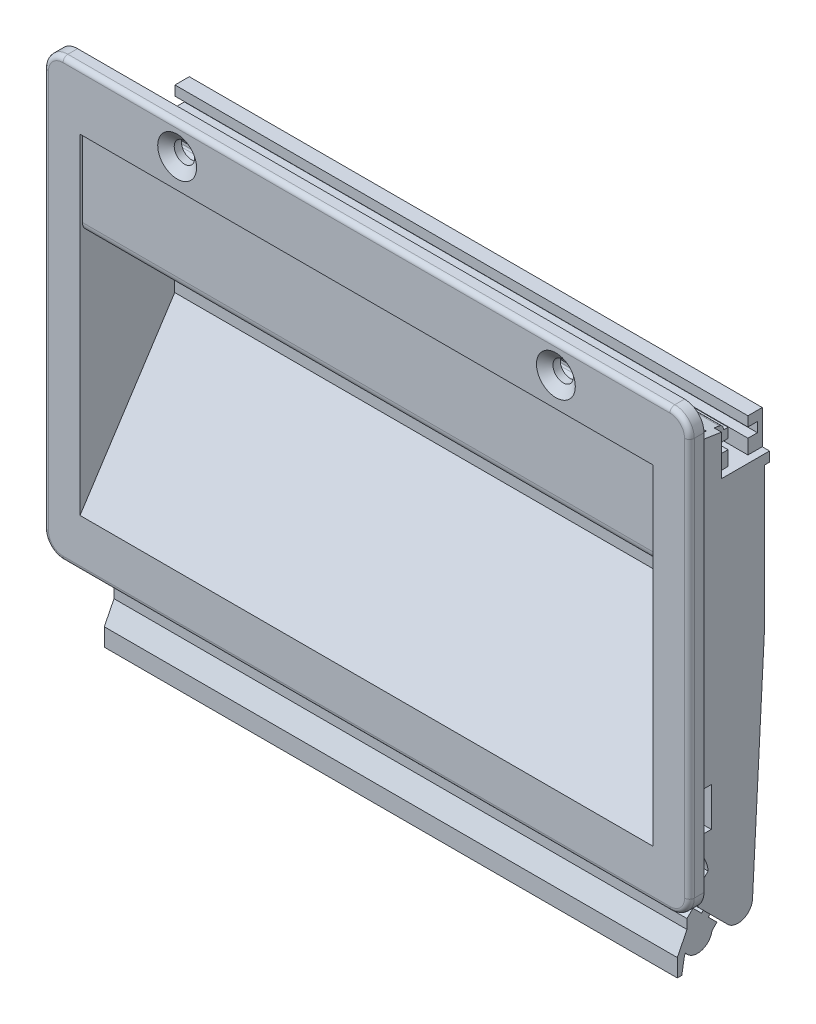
ISO-10303-21;
HEADER;
FILE_DESCRIPTION(('STEP AP214'),'2;1');
FILE_NAME('part.step','',(''),(''),'','','');
FILE_SCHEMA(('AUTOMOTIVE_DESIGN { 1 0 10303 214 1 1 1 1 }'));
ENDSEC;
DATA;
#1=APPLICATION_CONTEXT('core data for automotive mechanical design processes');
#2=APPLICATION_PROTOCOL_DEFINITION('international standard','automotive_design',2000,#1);
#3=PRODUCT_CONTEXT('',#1,'mechanical');
#4=PRODUCT('Part','Part','',(#3));
#5=PRODUCT_RELATED_PRODUCT_CATEGORY('part','',(#4));
#6=PRODUCT_DEFINITION_FORMATION('','',#4);
#7=PRODUCT_DEFINITION_CONTEXT('part definition',#1,'design');
#8=PRODUCT_DEFINITION('design','',#6,#7);
#9=PRODUCT_DEFINITION_SHAPE('','',#8);
#10=(LENGTH_UNIT() NAMED_UNIT(*) SI_UNIT(.MILLI.,.METRE.));
#11=(NAMED_UNIT(*) PLANE_ANGLE_UNIT() SI_UNIT($,.RADIAN.));
#12=(NAMED_UNIT(*) SI_UNIT($,.STERADIAN.) SOLID_ANGLE_UNIT());
#13=UNCERTAINTY_MEASURE_WITH_UNIT(LENGTH_MEASURE(1.E-05),#10,'distance_accuracy_value','');
#14=(GEOMETRIC_REPRESENTATION_CONTEXT(3) GLOBAL_UNCERTAINTY_ASSIGNED_CONTEXT((#13)) GLOBAL_UNIT_ASSIGNED_CONTEXT((#10,
#11,#12)) REPRESENTATION_CONTEXT('',''));
#15=CARTESIAN_POINT('',(0.,0.,0.));
#16=DIRECTION('',(0.,0.,1.));
#17=DIRECTION('',(1.,0.,0.));
#18=AXIS2_PLACEMENT_3D('',#15,#16,#17);
#19=CARTESIAN_POINT('',(-20.,-77.,0.));
#20=DIRECTION('',(0.,0.,1.));
#21=DIRECTION('',(1.,0.,0.));
#22=AXIS2_PLACEMENT_3D('',#19,#20,#21);
#23=PLANE('',#22);
#24=CARTESIAN_POINT('',(0.,0.,0.));
#25=DIRECTION('',(0.,0.,-1.));
#26=DIRECTION('',(-1.,0.,0.));
#27=AXIS2_PLACEMENT_3D('',#24,#25,#26);
#28=CIRCLE('',#27,2.1);
#29=CARTESIAN_POINT('',(-2.1,0.,0.));
#30=VERTEX_POINT('',#29);
#31=EDGE_CURVE('E906',#30,#30,#28,.T.);
#32=ORIENTED_EDGE('',*,*,#31,.F.);
#33=EDGE_LOOP('',(#32));
#34=FACE_BOUND('',#33,.T.);
#35=DIRECTION('',(0.,-1.,0.));
#36=VECTOR('',#35,1.);
#37=CARTESIAN_POINT('',(99.5,6.,0.));
#38=LINE('',#37,#36);
#39=CARTESIAN_POINT('',(99.5,-4.5,0.));
#40=VERTEX_POINT('',#39);
#41=CARTESIAN_POINT('',(99.5,-77.,0.));
#42=VERTEX_POINT('',#41);
#43=EDGE_CURVE('E667',#40,#42,#38,.T.);
#44=ORIENTED_EDGE('',*,*,#43,.F.);
#45=DIRECTION('',(1.,0.,0.));
#46=VECTOR('',#45,1.);
#47=CARTESIAN_POINT('',(-20.,-4.5,0.));
#48=LINE('',#47,#46);
#49=CARTESIAN_POINT('',(-21.5,-4.5,0.));
#50=VERTEX_POINT('',#49);
#51=EDGE_CURVE('E1539',#50,#40,#48,.T.);
#52=ORIENTED_EDGE('',*,*,#51,.F.);
#53=DIRECTION('',(0.,-1.,0.));
#54=VECTOR('',#53,1.);
#55=CARTESIAN_POINT('',(-21.5,6.,0.));
#56=LINE('',#55,#54);
#57=CARTESIAN_POINT('',(-21.5,-77.,0.));
#58=VERTEX_POINT('',#57);
#59=EDGE_CURVE('E668',#50,#58,#56,.T.);
#60=ORIENTED_EDGE('',*,*,#59,.T.);
#61=DIRECTION('',(1.,0.,0.));
#62=VECTOR('',#61,1.);
#63=CARTESIAN_POINT('',(-20.,-77.,0.));
#64=LINE('',#63,#62);
#65=EDGE_CURVE('E653',#58,#42,#64,.T.);
#66=ORIENTED_EDGE('',*,*,#65,.T.);
#67=EDGE_LOOP('',(#44,#52,#60,#66));
#68=FACE_BOUND('',#67,.T.);
#69=DIRECTION('',(1.,0.,0.));
#70=VECTOR('',#69,1.);
#71=CARTESIAN_POINT('',(-20.,6.,0.));
#72=LINE('',#71,#70);
#73=CARTESIAN_POINT('',(-23.5,6.,0.));
#74=VERTEX_POINT('',#73);
#75=CARTESIAN_POINT('',(101.5,6.,0.));
#76=VERTEX_POINT('',#75);
#77=EDGE_CURVE('E1540',#74,#76,#72,.T.);
#78=ORIENTED_EDGE('',*,*,#77,.T.);
#79=CARTESIAN_POINT('',(101.5,2.,0.));
#80=DIRECTION('',(0.,0.,1.));
#81=DIRECTION('',(1.,0.,0.));
#82=AXIS2_PLACEMENT_3D('',#79,#80,#81);
#83=CIRCLE('',#82,4.);
#84=CARTESIAN_POINT('',(105.5,2.,0.));
#85=VERTEX_POINT('',#84);
#86=EDGE_CURVE('E701',#76,#85,#83,.F.);
#87=ORIENTED_EDGE('',*,*,#86,.T.);
#88=DIRECTION('',(0.,-1.,0.));
#89=VECTOR('',#88,1.);
#90=CARTESIAN_POINT('',(105.5,6.,0.));
#91=LINE('',#90,#89);
#92=CARTESIAN_POINT('',(105.5,-80.,0.));
#93=VERTEX_POINT('',#92);
#94=EDGE_CURVE('E676',#85,#93,#91,.T.);
#95=ORIENTED_EDGE('',*,*,#94,.T.);
#96=CARTESIAN_POINT('',(101.5,-80.,0.));
#97=DIRECTION('',(0.,0.,1.));
#98=DIRECTION('',(1.,0.,0.));
#99=AXIS2_PLACEMENT_3D('',#96,#97,#98);
#100=CIRCLE('',#99,4.);
#101=CARTESIAN_POINT('',(101.5,-84.,0.));
#102=VERTEX_POINT('',#101);
#103=EDGE_CURVE('E699',#93,#102,#100,.F.);
#104=ORIENTED_EDGE('',*,*,#103,.T.);
#105=DIRECTION('',(1.,0.,0.));
#106=VECTOR('',#105,1.);
#107=CARTESIAN_POINT('',(-20.,-84.,0.));
#108=LINE('',#107,#106);
#109=CARTESIAN_POINT('',(-23.5,-84.,0.));
#110=VERTEX_POINT('',#109);
#111=EDGE_CURVE('E669',#110,#102,#108,.T.);
#112=ORIENTED_EDGE('',*,*,#111,.F.);
#113=CARTESIAN_POINT('',(-23.5,-80.,0.));
#114=DIRECTION('',(0.,0.,1.));
#115=DIRECTION('',(1.,0.,0.));
#116=AXIS2_PLACEMENT_3D('',#113,#114,#115);
#117=CIRCLE('',#116,4.);
#118=CARTESIAN_POINT('',(-27.5,-80.,0.));
#119=VERTEX_POINT('',#118);
#120=EDGE_CURVE('E1553',#110,#119,#117,.F.);
#121=ORIENTED_EDGE('',*,*,#120,.T.);
#122=DIRECTION('',(0.,-1.,0.));
#123=VECTOR('',#122,1.);
#124=CARTESIAN_POINT('',(-27.5,6.,0.));
#125=LINE('',#124,#123);
#126=CARTESIAN_POINT('',(-27.5,2.,0.));
#127=VERTEX_POINT('',#126);
#128=EDGE_CURVE('E802',#127,#119,#125,.T.);
#129=ORIENTED_EDGE('',*,*,#128,.F.);
#130=CARTESIAN_POINT('',(-23.5,2.,0.));
#131=DIRECTION('',(0.,0.,1.));
#132=DIRECTION('',(1.,0.,0.));
#133=AXIS2_PLACEMENT_3D('',#130,#131,#132);
#134=CIRCLE('',#133,4.);
#135=EDGE_CURVE('E1555',#127,#74,#134,.F.);
#136=ORIENTED_EDGE('',*,*,#135,.T.);
#137=EDGE_LOOP('',(#78,#87,#95,#104,#112,#121,#129,#136));
#138=FACE_BOUND('',#137,.T.);
#139=CARTESIAN_POINT('',(78.,0.,0.));
#140=DIRECTION('',(0.,0.,1.));
#141=DIRECTION('',(1.,0.,0.));
#142=AXIS2_PLACEMENT_3D('',#139,#140,#141);
#143=CIRCLE('',#142,2.1);
#144=CARTESIAN_POINT('',(80.1,0.,0.));
#145=VERTEX_POINT('',#144);
#146=EDGE_CURVE('E821',#145,#145,#143,.T.);
#147=ORIENTED_EDGE('',*,*,#146,.T.);
#148=EDGE_LOOP('',(#147));
#149=FACE_BOUND('',#148,.T.);
#150=ADVANCED_FACE('F14',(#34,#68,#138,#149),#23,.F.);
#151=CARTESIAN_POINT('',(-20.,6.,3.));
#152=DIRECTION('',(0.,0.,1.));
#153=DIRECTION('',(1.,0.,0.));
#154=AXIS2_PLACEMENT_3D('',#151,#152,#153);
#155=PLANE('',#154);
#156=CARTESIAN_POINT('',(-23.5,-80.,3.));
#157=DIRECTION('',(0.,0.,1.));
#158=DIRECTION('',(1.,0.,0.));
#159=AXIS2_PLACEMENT_3D('',#156,#157,#158);
#160=CIRCLE('',#159,3.);
#161=CARTESIAN_POINT('',(-26.5,-80.,3.));
#162=VERTEX_POINT('',#161);
#163=CARTESIAN_POINT('',(-23.5,-83.,3.));
#164=VERTEX_POINT('',#163);
#165=EDGE_CURVE('E718',#162,#164,#160,.T.);
#166=ORIENTED_EDGE('',*,*,#165,.T.);
#167=DIRECTION('',(1.,0.,0.));
#168=VECTOR('',#167,1.);
#169=CARTESIAN_POINT('',(-20.,-83.,3.));
#170=LINE('',#169,#168);
#171=CARTESIAN_POINT('',(101.5,-83.,3.));
#172=VERTEX_POINT('',#171);
#173=EDGE_CURVE('E720',#164,#172,#170,.T.);
#174=ORIENTED_EDGE('',*,*,#173,.T.);
#175=CARTESIAN_POINT('',(101.5,-80.,3.));
#176=DIRECTION('',(0.,0.,1.));
#177=DIRECTION('',(1.,0.,0.));
#178=AXIS2_PLACEMENT_3D('',#175,#176,#177);
#179=CIRCLE('',#178,3.);
#180=CARTESIAN_POINT('',(104.5,-80.,3.));
#181=VERTEX_POINT('',#180);
#182=EDGE_CURVE('E716',#172,#181,#179,.T.);
#183=ORIENTED_EDGE('',*,*,#182,.T.);
#184=DIRECTION('',(0.,1.,0.));
#185=VECTOR('',#184,1.);
#186=CARTESIAN_POINT('',(104.5,6.,3.));
#187=LINE('',#186,#185);
#188=CARTESIAN_POINT('',(104.5,2.,3.));
#189=VERTEX_POINT('',#188);
#190=EDGE_CURVE('E712',#181,#189,#187,.T.);
#191=ORIENTED_EDGE('',*,*,#190,.T.);
#192=CARTESIAN_POINT('',(101.5,2.,3.));
#193=DIRECTION('',(0.,0.,1.));
#194=DIRECTION('',(1.,0.,0.));
#195=AXIS2_PLACEMENT_3D('',#192,#193,#194);
#196=CIRCLE('',#195,3.);
#197=CARTESIAN_POINT('',(101.5,5.,3.));
#198=VERTEX_POINT('',#197);
#199=EDGE_CURVE('E708',#189,#198,#196,.T.);
#200=ORIENTED_EDGE('',*,*,#199,.T.);
#201=DIRECTION('',(1.,0.,0.));
#202=VECTOR('',#201,1.);
#203=CARTESIAN_POINT('',(-20.,5.,3.));
#204=LINE('',#203,#202);
#205=CARTESIAN_POINT('',(-23.5,5.,3.));
#206=VERTEX_POINT('',#205);
#207=EDGE_CURVE('E706',#198,#206,#204,.F.);
#208=ORIENTED_EDGE('',*,*,#207,.T.);
#209=CARTESIAN_POINT('',(-23.5,2.,3.));
#210=DIRECTION('',(0.,0.,1.));
#211=DIRECTION('',(1.,0.,0.));
#212=AXIS2_PLACEMENT_3D('',#209,#210,#211);
#213=CIRCLE('',#212,3.);
#214=CARTESIAN_POINT('',(-26.5,2.,3.));
#215=VERTEX_POINT('',#214);
#216=EDGE_CURVE('E710',#206,#215,#213,.T.);
#217=ORIENTED_EDGE('',*,*,#216,.T.);
#218=DIRECTION('',(0.,1.,0.));
#219=VECTOR('',#218,1.);
#220=CARTESIAN_POINT('',(-26.5,-84.,3.));
#221=LINE('',#220,#219);
#222=EDGE_CURVE('E714',#215,#162,#221,.F.);
#223=ORIENTED_EDGE('',*,*,#222,.T.);
#224=EDGE_LOOP('',(#166,#174,#183,#191,#200,#208,#217,#223));
#225=FACE_BOUND('',#224,.T.);
#226=CARTESIAN_POINT('',(0.,0.,3.));
#227=DIRECTION('',(0.,0.,-1.));
#228=DIRECTION('',(-1.,0.,0.));
#229=AXIS2_PLACEMENT_3D('',#226,#227,#228);
#230=CIRCLE('',#229,4.);
#231=CARTESIAN_POINT('',(-4.,0.,2.99999999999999));
#232=VERTEX_POINT('',#231);
#233=EDGE_CURVE('E912',#232,#232,#230,.T.);
#234=ORIENTED_EDGE('',*,*,#233,.T.);
#235=EDGE_LOOP('',(#234));
#236=FACE_BOUND('',#235,.T.);
#237=DIRECTION('',(1.,0.,0.));
#238=VECTOR('',#237,1.);
#239=CARTESIAN_POINT('',(-20.,-6.,3.));
#240=LINE('',#239,#238);
#241=CARTESIAN_POINT('',(-20.,-6.,3.));
#242=VERTEX_POINT('',#241);
#243=CARTESIAN_POINT('',(98.,-6.,3.));
#244=VERTEX_POINT('',#243);
#245=EDGE_CURVE('E1378',#242,#244,#240,.T.);
#246=ORIENTED_EDGE('',*,*,#245,.T.);
#247=DIRECTION('',(0.,-1.,0.));
#248=VECTOR('',#247,1.);
#249=CARTESIAN_POINT('',(98.,6.,3.));
#250=LINE('',#249,#248);
#251=CARTESIAN_POINT('',(98.,-74.,3.));
#252=VERTEX_POINT('',#251);
#253=EDGE_CURVE('E691',#244,#252,#250,.T.);
#254=ORIENTED_EDGE('',*,*,#253,.T.);
#255=DIRECTION('',(1.,0.,0.));
#256=VECTOR('',#255,1.);
#257=CARTESIAN_POINT('',(-20.,-74.,3.));
#258=LINE('',#257,#256);
#259=CARTESIAN_POINT('',(-20.,-74.,3.));
#260=VERTEX_POINT('',#259);
#261=EDGE_CURVE('E1400',#260,#252,#258,.T.);
#262=ORIENTED_EDGE('',*,*,#261,.F.);
#263=DIRECTION('',(0.,-1.,0.));
#264=VECTOR('',#263,1.);
#265=CARTESIAN_POINT('',(-20.,6.,3.));
#266=LINE('',#265,#264);
#267=EDGE_CURVE('E934',#242,#260,#266,.T.);
#268=ORIENTED_EDGE('',*,*,#267,.F.);
#269=EDGE_LOOP('',(#246,#254,#262,#268));
#270=FACE_BOUND('',#269,.T.);
#271=CARTESIAN_POINT('',(78.,0.,3.));
#272=DIRECTION('',(0.,0.,1.));
#273=DIRECTION('',(1.,0.,0.));
#274=AXIS2_PLACEMENT_3D('',#271,#272,#273);
#275=CIRCLE('',#274,4.);
#276=CARTESIAN_POINT('',(82.,0.,2.99999999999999));
#277=VERTEX_POINT('',#276);
#278=EDGE_CURVE('E677',#277,#277,#275,.T.);
#279=ORIENTED_EDGE('',*,*,#278,.F.);
#280=EDGE_LOOP('',(#279));
#281=FACE_BOUND('',#280,.T.);
#282=ADVANCED_FACE('F1633',(#225,#236,#270,#281),#155,.T.);
#283=CARTESIAN_POINT('',(99.5,-83.,-0.856032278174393));
#284=DIRECTION('',(1.,0.,0.));
#285=DIRECTION('',(0.,0.,1.));
#286=AXIS2_PLACEMENT_3D('',#283,#284,#285);
#287=PLANE('',#286);
#288=DIRECTION('',(0.,-1.,0.));
#289=VECTOR('',#288,1.);
#290=CARTESIAN_POINT('',(99.5,-67.500000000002,-7.5));
#291=LINE('',#290,#289);
#292=CARTESIAN_POINT('',(99.5,-67.500000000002,-7.5));
#293=VERTEX_POINT('',#292);
#294=CARTESIAN_POINT('',(99.5,-75.499999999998,-7.5));
#295=VERTEX_POINT('',#294);
#296=EDGE_CURVE('E831',#293,#295,#291,.T.);
#297=ORIENTED_EDGE('',*,*,#296,.T.);
#298=DIRECTION('',(0.,0.,-1.));
#299=VECTOR('',#298,1.);
#300=CARTESIAN_POINT('',(99.5,-75.499999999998,-5.5000000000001));
#301=LINE('',#300,#299);
#302=CARTESIAN_POINT('',(99.5,-75.499999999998,-5.5000000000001));
#303=VERTEX_POINT('',#302);
#304=EDGE_CURVE('E840',#303,#295,#301,.T.);
#305=ORIENTED_EDGE('',*,*,#304,.F.);
#306=DIRECTION('',(0.,1.,0.));
#307=VECTOR('',#306,1.);
#308=CARTESIAN_POINT('',(99.5,-75.499999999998,-5.5000000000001));
#309=LINE('',#308,#307);
#310=CARTESIAN_POINT('',(99.5,-67.500000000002,-5.5000000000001));
#311=VERTEX_POINT('',#310);
#312=EDGE_CURVE('E837',#303,#311,#309,.T.);
#313=ORIENTED_EDGE('',*,*,#312,.T.);
#314=DIRECTION('',(0.,0.,1.));
#315=VECTOR('',#314,1.);
#316=CARTESIAN_POINT('',(99.5,-67.500000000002,-7.5));
#317=LINE('',#316,#315);
#318=EDGE_CURVE('E834',#293,#311,#317,.T.);
#319=ORIENTED_EDGE('',*,*,#318,.F.);
#320=EDGE_LOOP('',(#297,#305,#313,#319));
#321=FACE_BOUND('',#320,.T.);
#322=DIRECTION('',(0.,0.,1.));
#323=VECTOR('',#322,1.);
#324=CARTESIAN_POINT('',(99.5,-4.5,-2.0000000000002));
#325=LINE('',#324,#323);
#326=CARTESIAN_POINT('',(99.5,-4.5,-2.0000000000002));
#327=VERTEX_POINT('',#326);
#328=EDGE_CURVE('E675',#327,#40,#325,.T.);
#329=ORIENTED_EDGE('',*,*,#328,.T.);
#330=ORIENTED_EDGE('',*,*,#43,.T.);
#331=DIRECTION('',(0.,0.,-1.));
#332=VECTOR('',#331,1.);
#333=CARTESIAN_POINT('',(99.5,-77.,0.));
#334=LINE('',#333,#332);
#335=CARTESIAN_POINT('',(99.5,-77.,-0.856032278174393));
#336=VERTEX_POINT('',#335);
#337=EDGE_CURVE('E649',#42,#336,#334,.T.);
#338=ORIENTED_EDGE('',*,*,#337,.T.);
#339=CARTESIAN_POINT('',(99.5,-83.,-0.856032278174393));
#340=DIRECTION('',(-1.,0.,0.));
#341=DIRECTION('',(0.,0.,1.));
#342=AXIS2_PLACEMENT_3D('',#339,#340,#341);
#343=CIRCLE('',#342,6.);
#344=CARTESIAN_POINT('',(99.5,-82.6009062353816,-6.8427445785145));
#345=VERTEX_POINT('',#344);
#346=EDGE_CURVE('E661',#336,#345,#343,.T.);
#347=ORIENTED_EDGE('',*,*,#346,.T.);
#348=DIRECTION('',(0.,-0.707106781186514,0.707106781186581));
#349=VECTOR('',#348,1.);
#350=CARTESIAN_POINT('',(99.5,-82.6009062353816,-6.8427445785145));
#351=LINE('',#350,#349);
#352=CARTESIAN_POINT('',(99.5,-84.22182270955,-5.22182810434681));
#353=VERTEX_POINT('',#352);
#354=EDGE_CURVE('E885',#345,#353,#351,.T.);
#355=ORIENTED_EDGE('',*,*,#354,.T.);
#356=CARTESIAN_POINT('',(99.5,-86.3431457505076,-7.3431457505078));
#357=DIRECTION('',(1.,0.,0.));
#358=DIRECTION('',(0.,0.,-1.));
#359=AXIS2_PLACEMENT_3D('',#356,#357,#358);
#360=CIRCLE('',#359,3.00000000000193);
#361=CARTESIAN_POINT('',(99.5,-88.4644660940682,-5.2218254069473));
#362=VERTEX_POINT('',#361);
#363=EDGE_CURVE('E882',#353,#362,#360,.T.);
#364=ORIENTED_EDGE('',*,*,#363,.T.);
#365=DIRECTION('',(0.,-0.707106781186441,-0.707106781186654));
#366=VECTOR('',#365,1.);
#367=CARTESIAN_POINT('',(99.5,-88.4644660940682,-5.2218254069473));
#368=LINE('',#367,#366);
#369=CARTESIAN_POINT('',(99.5,-94.1213203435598,-10.8786796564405));
#370=VERTEX_POINT('',#369);
#371=EDGE_CURVE('E879',#362,#370,#368,.T.);
#372=ORIENTED_EDGE('',*,*,#371,.T.);
#373=CARTESIAN_POINT('',(99.5,-92.,-13.));
#374=DIRECTION('',(1.,0.,0.));
#375=DIRECTION('',(0.,0.,-1.));
#376=AXIS2_PLACEMENT_3D('',#373,#374,#375);
#377=CIRCLE('',#376,3.);
#378=CARTESIAN_POINT('',(99.5,-92.1577227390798,-15.9958510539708));
#379=VERTEX_POINT('',#378);
#380=EDGE_CURVE('E876',#370,#379,#377,.T.);
#381=ORIENTED_EDGE('',*,*,#380,.T.);
#382=DIRECTION('',(0.,-0.998617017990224,0.0525742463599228));
#383=VECTOR('',#382,1.);
#384=CARTESIAN_POINT('',(99.5,-44.592880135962,-18.5));
#385=LINE('',#384,#383);
#386=CARTESIAN_POINT('',(99.5,-44.592880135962,-18.5));
#387=VERTEX_POINT('',#386);
#388=EDGE_CURVE('E873',#387,#379,#385,.T.);
#389=ORIENTED_EDGE('',*,*,#388,.F.);
#390=DIRECTION('',(0.,-1.,0.));
#391=VECTOR('',#390,1.);
#392=CARTESIAN_POINT('',(99.5,-16.,-18.5));
#393=LINE('',#392,#391);
#394=CARTESIAN_POINT('',(99.5,-16.,-18.5));
#395=VERTEX_POINT('',#394);
#396=EDGE_CURVE('E870',#395,#387,#393,.T.);
#397=ORIENTED_EDGE('',*,*,#396,.F.);
#398=DIRECTION('',(0.,3.33066907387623E-13,-1.));
#399=VECTOR('',#398,1.);
#400=CARTESIAN_POINT('',(99.5,-16.,-18.5));
#401=LINE('',#400,#399);
#402=CARTESIAN_POINT('',(99.5,-16.,-19.5));
#403=VERTEX_POINT('',#402);
#404=EDGE_CURVE('E867',#395,#403,#401,.T.);
#405=ORIENTED_EDGE('',*,*,#404,.T.);
#406=DIRECTION('',(0.,1.,0.));
#407=VECTOR('',#406,1.);
#408=CARTESIAN_POINT('',(99.5,-16.,-19.5));
#409=LINE('',#408,#407);
#410=CARTESIAN_POINT('',(99.5,-14.,-19.5));
#411=VERTEX_POINT('',#410);
#412=EDGE_CURVE('E864',#403,#411,#409,.T.);
#413=ORIENTED_EDGE('',*,*,#412,.T.);
#414=DIRECTION('',(0.,0.,1.));
#415=VECTOR('',#414,1.);
#416=CARTESIAN_POINT('',(99.5,-14.,-19.5));
#417=LINE('',#416,#415);
#418=CARTESIAN_POINT('',(99.5,-14.,-9.6000000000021));
#419=VERTEX_POINT('',#418);
#420=EDGE_CURVE('E861',#411,#419,#417,.T.);
#421=ORIENTED_EDGE('',*,*,#420,.T.);
#422=DIRECTION('',(0.,1.,0.));
#423=VECTOR('',#422,1.);
#424=CARTESIAN_POINT('',(99.5,-14.,-9.6000000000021));
#425=LINE('',#424,#423);
#426=CARTESIAN_POINT('',(99.5,-5.70000000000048,-9.6000000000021));
#427=VERTEX_POINT('',#426);
#428=EDGE_CURVE('E858',#419,#427,#425,.T.);
#429=ORIENTED_EDGE('',*,*,#428,.T.);
#430=DIRECTION('',(0.,0.155962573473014,0.987762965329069));
#431=VECTOR('',#430,1.);
#432=CARTESIAN_POINT('',(99.5,-5.70000000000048,-9.6000000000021));
#433=LINE('',#432,#431);
#434=EDGE_CURVE('E690',#427,#327,#433,.T.);
#435=ORIENTED_EDGE('',*,*,#434,.T.);
#436=EDGE_LOOP('',(#329,#330,#338,#347,#355,#364,#372,#381,#389,#397,#405,#413,#421,#429,#435));
#437=FACE_BOUND('',#436,.T.);
#438=ADVANCED_FACE('F672',(#321,#437),#287,.T.);
#439=CARTESIAN_POINT('',(98.,-10.250000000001,-1.5));
#440=DIRECTION('',(-1.,0.,0.));
#441=DIRECTION('',(0.,0.,1.));
#442=AXIS2_PLACEMENT_3D('',#439,#440,#441);
#443=PLANE('',#442);
#444=DIRECTION('',(0.,-0.707106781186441,-0.707106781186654));
#445=VECTOR('',#444,1.);
#446=CARTESIAN_POINT('',(98.,-47.496320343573,35.7463203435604));
#447=LINE('',#446,#445);
#448=CARTESIAN_POINT('',(98.,-90.585786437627,-7.3431457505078));
#449=VERTEX_POINT('',#448);
#450=CARTESIAN_POINT('',(98.,-92.,-8.7573593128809));
#451=VERTEX_POINT('',#450);
#452=EDGE_CURVE('E686',#449,#451,#447,.T.);
#453=ORIENTED_EDGE('',*,*,#452,.F.);
#454=DIRECTION('',(0.,-0.707106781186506,0.707106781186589));
#455=VECTOR('',#454,1.);
#456=CARTESIAN_POINT('',(98.,-90.585786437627,-7.3431457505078));
#457=LINE('',#456,#455);
#458=CARTESIAN_POINT('',(98.,-90.9393398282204,-6.9895923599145));
#459=VERTEX_POINT('',#458);
#460=EDGE_CURVE('E1156',#449,#459,#457,.T.);
#461=ORIENTED_EDGE('',*,*,#460,.T.);
#462=DIRECTION('',(0.,0.707106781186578,0.707106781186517));
#463=VECTOR('',#462,1.);
#464=CARTESIAN_POINT('',(98.,-90.9393398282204,-6.9895923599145));
#465=LINE('',#464,#463);
#466=CARTESIAN_POINT('',(98.,-89.1715728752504,-5.2218254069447));
#467=VERTEX_POINT('',#466);
#468=EDGE_CURVE('E1153',#459,#467,#465,.T.);
#469=ORIENTED_EDGE('',*,*,#468,.T.);
#470=DIRECTION('',(0.,-0.707106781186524,0.707106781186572));
#471=VECTOR('',#470,1.);
#472=CARTESIAN_POINT('',(98.,-89.1715728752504,-5.2218254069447));
#473=LINE('',#472,#471);
#474=CARTESIAN_POINT('',(98.,-90.393398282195,-4.0000000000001));
#475=VERTEX_POINT('',#474);
#476=EDGE_CURVE('E1150',#467,#475,#473,.T.);
#477=ORIENTED_EDGE('',*,*,#476,.T.);
#478=DIRECTION('',(0.,1.,0.));
#479=VECTOR('',#478,1.);
#480=CARTESIAN_POINT('',(98.,-92.3535533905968,-4.0000000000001));
#481=LINE('',#480,#479);
#482=CARTESIAN_POINT('',(98.,-92.3535533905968,-4.0000000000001));
#483=VERTEX_POINT('',#482);
#484=EDGE_CURVE('E1147',#483,#475,#481,.T.);
#485=ORIENTED_EDGE('',*,*,#484,.F.);
#486=DIRECTION('',(0.,-0.894427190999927,0.447213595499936));
#487=VECTOR('',#486,1.);
#488=CARTESIAN_POINT('',(98.,-92.3535533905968,-4.0000000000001));
#489=LINE('',#488,#487);
#490=CARTESIAN_POINT('',(98.,-96.3535533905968,-2.0000000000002));
#491=VERTEX_POINT('',#490);
#492=EDGE_CURVE('E1144',#483,#491,#489,.T.);
#493=ORIENTED_EDGE('',*,*,#492,.T.);
#494=DIRECTION('',(0.,1.,0.));
#495=VECTOR('',#494,1.);
#496=CARTESIAN_POINT('',(98.,-100.,-2.0000000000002));
#497=LINE('',#496,#495);
#498=CARTESIAN_POINT('',(98.,-100.,-2.0000000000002));
#499=VERTEX_POINT('',#498);
#500=EDGE_CURVE('E1141',#499,#491,#497,.T.);
#501=ORIENTED_EDGE('',*,*,#500,.F.);
#502=DIRECTION('',(0.,0.,1.));
#503=VECTOR('',#502,1.);
#504=CARTESIAN_POINT('',(98.,-100.,-2.9194708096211));
#505=LINE('',#504,#503);
#506=CARTESIAN_POINT('',(98.,-100.,-2.9194708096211));
#507=VERTEX_POINT('',#506);
#508=EDGE_CURVE('E1138',#507,#499,#505,.T.);
#509=ORIENTED_EDGE('',*,*,#508,.F.);
#510=DIRECTION('',(0.,-0.984807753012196,0.173648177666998));
#511=VECTOR('',#510,1.);
#512=CARTESIAN_POINT('',(98.,-96.7076553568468,-3.5000000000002));
#513=LINE('',#512,#511);
#514=CARTESIAN_POINT('',(98.,-96.7076553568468,-3.5000000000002));
#515=VERTEX_POINT('',#514);
#516=EDGE_CURVE('E1135',#515,#507,#513,.T.);
#517=ORIENTED_EDGE('',*,*,#516,.F.);
#518=DIRECTION('',(0.,-0.894427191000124,0.447213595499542));
#519=VECTOR('',#518,1.);
#520=CARTESIAN_POINT('',(98.,-96.3500344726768,-3.678810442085));
#521=LINE('',#520,#519);
#522=CARTESIAN_POINT('',(98.,-96.3500344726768,-3.678810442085));
#523=VERTEX_POINT('',#522);
#524=EDGE_CURVE('E1132',#523,#515,#521,.T.);
#525=ORIENTED_EDGE('',*,*,#524,.F.);
#526=CARTESIAN_POINT('',(98.,-94.6970648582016,-6.1823462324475));
#527=DIRECTION('',(-1.,0.,0.));
#528=DIRECTION('',(0.,0.,1.));
#529=AXIS2_PLACEMENT_3D('',#526,#527,#528);
#530=CIRCLE('',#529,3.00000000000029);
#531=CARTESIAN_POINT('',(98.,-95.1440301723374,-9.148863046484));
#532=VERTEX_POINT('',#531);
#533=EDGE_CURVE('E1129',#532,#523,#530,.T.);
#534=ORIENTED_EDGE('',*,*,#533,.F.);
#535=DIRECTION('',(0.,-0.707106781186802,0.707106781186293));
#536=VECTOR('',#535,1.);
#537=CARTESIAN_POINT('',(98.,-94.121320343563,-10.1715728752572));
#538=LINE('',#537,#536);
#539=CARTESIAN_POINT('',(98.,-94.121320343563,-10.1715728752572));
#540=VERTEX_POINT('',#539);
#541=EDGE_CURVE('E1126',#540,#532,#538,.T.);
#542=ORIENTED_EDGE('',*,*,#541,.F.);
#543=DIRECTION('',(0.,0.707106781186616,0.70710678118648));
#544=VECTOR('',#543,1.);
#545=CARTESIAN_POINT('',(98.,-94.121320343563,-10.1715728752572));
#546=LINE('',#545,#544);
#547=CARTESIAN_POINT('',(98.,-92.3535533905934,-8.4038059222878));
#548=VERTEX_POINT('',#547);
#549=EDGE_CURVE('E1123',#540,#548,#546,.T.);
#550=ORIENTED_EDGE('',*,*,#549,.T.);
#551=DIRECTION('',(0.,-0.707106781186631,0.707106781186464));
#552=VECTOR('',#551,1.);
#553=CARTESIAN_POINT('',(98.,-92.,-8.7573593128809));
#554=LINE('',#553,#552);
#555=EDGE_CURVE('E1120',#451,#548,#554,.T.);
#556=ORIENTED_EDGE('',*,*,#555,.F.);
#557=EDGE_LOOP('',(#453,#461,#469,#477,#485,#493,#501,#509,#517,#525,#534,#542,#550,#556));
#558=FACE_BOUND('',#557,.T.);
#559=ADVANCED_FACE('F1569',(#558),#443,.F.);
#560=DIRECTION('',(0.,0.,1.));
#561=VECTOR('',#560,1.);
#562=CARTESIAN_POINT('',(98.,-14.,-19.5));
#563=LINE('',#562,#561);
#564=CARTESIAN_POINT('',(98.,-14.,-19.5));
#565=VERTEX_POINT('',#564);
#566=CARTESIAN_POINT('',(98.,-14.,-16.55));
#567=VERTEX_POINT('',#566);
#568=EDGE_CURVE('E849',#565,#567,#563,.T.);
#569=ORIENTED_EDGE('',*,*,#568,.F.);
#570=DIRECTION('',(0.,-1.,0.));
#571=VECTOR('',#570,1.);
#572=CARTESIAN_POINT('',(98.,-7.,-19.5));
#573=LINE('',#572,#571);
#574=CARTESIAN_POINT('',(98.,-7.,-19.5));
#575=VERTEX_POINT('',#574);
#576=EDGE_CURVE('E1088',#575,#565,#573,.T.);
#577=ORIENTED_EDGE('',*,*,#576,.F.);
#578=DIRECTION('',(0.,0.,-1.));
#579=VECTOR('',#578,1.);
#580=CARTESIAN_POINT('',(98.,-7.,-16.55));
#581=LINE('',#580,#579);
#582=CARTESIAN_POINT('',(98.,-7.,-16.55));
#583=VERTEX_POINT('',#582);
#584=EDGE_CURVE('E1085',#583,#575,#581,.T.);
#585=ORIENTED_EDGE('',*,*,#584,.F.);
#586=DIRECTION('',(0.,-1.,0.));
#587=VECTOR('',#586,1.);
#588=CARTESIAN_POINT('',(98.,-7.,-16.55));
#589=LINE('',#588,#587);
#590=CARTESIAN_POINT('',(98.,-9.,-16.55));
#591=VERTEX_POINT('',#590);
#592=EDGE_CURVE('E1082',#583,#591,#589,.T.);
#593=ORIENTED_EDGE('',*,*,#592,.T.);
#594=DIRECTION('',(0.,0.,-1.));
#595=VECTOR('',#594,1.);
#596=CARTESIAN_POINT('',(98.,-9.,-16.55));
#597=LINE('',#596,#595);
#598=CARTESIAN_POINT('',(98.,-9.,-18.5));
#599=VERTEX_POINT('',#598);
#600=EDGE_CURVE('E1079',#591,#599,#597,.T.);
#601=ORIENTED_EDGE('',*,*,#600,.T.);
#602=DIRECTION('',(0.,-1.,0.));
#603=VECTOR('',#602,1.);
#604=CARTESIAN_POINT('',(98.,-9.,-18.5));
#605=LINE('',#604,#603);
#606=CARTESIAN_POINT('',(98.,-11.,-18.5));
#607=VERTEX_POINT('',#606);
#608=EDGE_CURVE('E1076',#599,#607,#605,.T.);
#609=ORIENTED_EDGE('',*,*,#608,.T.);
#610=DIRECTION('',(0.,0.,1.));
#611=VECTOR('',#610,1.);
#612=CARTESIAN_POINT('',(98.,-11.,-18.5));
#613=LINE('',#612,#611);
#614=CARTESIAN_POINT('',(98.,-11.,-16.55));
#615=VERTEX_POINT('',#614);
#616=EDGE_CURVE('E1073',#607,#615,#613,.T.);
#617=ORIENTED_EDGE('',*,*,#616,.T.);
#618=DIRECTION('',(0.,-1.,0.));
#619=VECTOR('',#618,1.);
#620=CARTESIAN_POINT('',(98.,-11.,-16.55));
#621=LINE('',#620,#619);
#622=EDGE_CURVE('E1070',#615,#567,#621,.T.);
#623=ORIENTED_EDGE('',*,*,#622,.T.);
#624=EDGE_LOOP('',(#569,#577,#585,#593,#601,#609,#617,#623));
#625=FACE_BOUND('',#624,.T.);
#626=ADVANCED_FACE('F2027',(#625),#443,.F.);
#627=DIRECTION('',(0.,0.,1.));
#628=VECTOR('',#627,1.);
#629=CARTESIAN_POINT('',(98.,-14.,-1.5));
#630=LINE('',#629,#628);
#631=CARTESIAN_POINT('',(98.,-14.,-12.4500000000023));
#632=VERTEX_POINT('',#631);
#633=CARTESIAN_POINT('',(98.,-14.,-9.6000000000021));
#634=VERTEX_POINT('',#633);
#635=EDGE_CURVE('E1557',#632,#634,#630,.T.);
#636=ORIENTED_EDGE('',*,*,#635,.F.);
#637=DIRECTION('',(0.,-1.,0.));
#638=VECTOR('',#637,1.);
#639=CARTESIAN_POINT('',(98.,-11.,-12.4500000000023));
#640=LINE('',#639,#638);
#641=CARTESIAN_POINT('',(98.,-11.,-12.4500000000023));
#642=VERTEX_POINT('',#641);
#643=EDGE_CURVE('E1067',#642,#632,#640,.T.);
#644=ORIENTED_EDGE('',*,*,#643,.F.);
#645=DIRECTION('',(0.,0.,1.));
#646=VECTOR('',#645,1.);
#647=CARTESIAN_POINT('',(98.,-11.,-12.4500000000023));
#648=LINE('',#647,#646);
#649=CARTESIAN_POINT('',(98.,-11.,-10.5000000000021));
#650=VERTEX_POINT('',#649);
#651=EDGE_CURVE('E1064',#642,#650,#648,.T.);
#652=ORIENTED_EDGE('',*,*,#651,.T.);
#653=DIRECTION('',(0.,-1.,0.));
#654=VECTOR('',#653,1.);
#655=CARTESIAN_POINT('',(98.,-9.,-10.5000000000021));
#656=LINE('',#655,#654);
#657=CARTESIAN_POINT('',(98.,-9.,-10.5000000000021));
#658=VERTEX_POINT('',#657);
#659=EDGE_CURVE('E1061',#658,#650,#656,.T.);
#660=ORIENTED_EDGE('',*,*,#659,.F.);
#661=DIRECTION('',(0.,0.,1.));
#662=VECTOR('',#661,1.);
#663=CARTESIAN_POINT('',(98.,-9.,-12.4500000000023));
#664=LINE('',#663,#662);
#665=CARTESIAN_POINT('',(98.,-9.,-12.4500000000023));
#666=VERTEX_POINT('',#665);
#667=EDGE_CURVE('E1058',#666,#658,#664,.T.);
#668=ORIENTED_EDGE('',*,*,#667,.F.);
#669=DIRECTION('',(0.,-1.,0.));
#670=VECTOR('',#669,1.);
#671=CARTESIAN_POINT('',(98.,-7.,-12.4500000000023));
#672=LINE('',#671,#670);
#673=CARTESIAN_POINT('',(98.,-7.,-12.4500000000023));
#674=VERTEX_POINT('',#673);
#675=EDGE_CURVE('E1055',#674,#666,#672,.T.);
#676=ORIENTED_EDGE('',*,*,#675,.F.);
#677=DIRECTION('',(0.,0.,-1.));
#678=VECTOR('',#677,1.);
#679=CARTESIAN_POINT('',(98.,-7.,-11.5));
#680=LINE('',#679,#678);
#681=CARTESIAN_POINT('',(98.,-7.,-11.5));
#682=VERTEX_POINT('',#681);
#683=EDGE_CURVE('E1052',#682,#674,#680,.T.);
#684=ORIENTED_EDGE('',*,*,#683,.F.);
#685=DIRECTION('',(0.,1.,0.));
#686=VECTOR('',#685,1.);
#687=CARTESIAN_POINT('',(98.,-7.,-11.5));
#688=LINE('',#687,#686);
#689=CARTESIAN_POINT('',(98.,-6.85449389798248,-11.5));
#690=VERTEX_POINT('',#689);
#691=EDGE_CURVE('E1049',#682,#690,#688,.T.);
#692=ORIENTED_EDGE('',*,*,#691,.T.);
#693=CARTESIAN_POINT('',(98.,-6.85449389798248,-10.5));
#694=DIRECTION('',(-1.,0.,0.));
#695=DIRECTION('',(0.,0.,1.));
#696=AXIS2_PLACEMENT_3D('',#693,#694,#695);
#697=CIRCLE('',#696,1.);
#698=CARTESIAN_POINT('',(98.,-5.86673093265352,-10.6559625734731));
#699=VERTEX_POINT('',#698);
#700=EDGE_CURVE('E1046',#699,#690,#697,.T.);
#701=ORIENTED_EDGE('',*,*,#700,.F.);
#702=DIRECTION('',(0.,-0.155962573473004,-0.98776296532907));
#703=VECTOR('',#702,1.);
#704=CARTESIAN_POINT('',(98.,-5.44736842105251,-8.0000000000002));
#705=LINE('',#704,#703);
#706=CARTESIAN_POINT('',(98.,-5.70000000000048,-9.6000000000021));
#707=VERTEX_POINT('',#706);
#708=EDGE_CURVE('E1044',#707,#699,#705,.T.);
#709=ORIENTED_EDGE('',*,*,#708,.F.);
#710=DIRECTION('',(0.,1.,0.));
#711=VECTOR('',#710,1.);
#712=CARTESIAN_POINT('',(98.,-14.,-9.6000000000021));
#713=LINE('',#712,#711);
#714=EDGE_CURVE('E846',#634,#707,#713,.T.);
#715=ORIENTED_EDGE('',*,*,#714,.F.);
#716=EDGE_LOOP('',(#636,#644,#652,#660,#668,#676,#684,#692,#701,#709,#715));
#717=FACE_BOUND('',#716,.T.);
#718=ADVANCED_FACE('F1985',(#717),#443,.F.);
#719=CARTESIAN_POINT('',(-20.,-10.250000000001,-1.5));
#720=DIRECTION('',(-1.,0.,0.));
#721=DIRECTION('',(0.,0.,1.));
#722=AXIS2_PLACEMENT_3D('',#719,#720,#721);
#723=PLANE('',#722);
#724=DIRECTION('',(0.,1.,0.));
#725=VECTOR('',#724,1.);
#726=CARTESIAN_POINT('',(-20.,-14.,-9.6000000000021));
#727=LINE('',#726,#725);
#728=CARTESIAN_POINT('',(-20.,-14.,-9.6000000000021));
#729=VERTEX_POINT('',#728);
#730=CARTESIAN_POINT('',(-20.,-5.70000000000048,-9.6000000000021));
#731=VERTEX_POINT('',#730);
#732=EDGE_CURVE('E944',#729,#731,#727,.T.);
#733=ORIENTED_EDGE('',*,*,#732,.T.);
#734=DIRECTION('',(0.,-0.155962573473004,-0.98776296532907));
#735=VECTOR('',#734,1.);
#736=CARTESIAN_POINT('',(-20.,-5.44736842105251,-8.0000000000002));
#737=LINE('',#736,#735);
#738=CARTESIAN_POINT('',(-20.,-5.86673093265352,-10.6559625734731));
#739=VERTEX_POINT('',#738);
#740=EDGE_CURVE('E1231',#731,#739,#737,.T.);
#741=ORIENTED_EDGE('',*,*,#740,.T.);
#742=CARTESIAN_POINT('',(-20.,-6.85449389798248,-10.5));
#743=DIRECTION('',(-1.,0.,0.));
#744=DIRECTION('',(0.,0.,1.));
#745=AXIS2_PLACEMENT_3D('',#742,#743,#744);
#746=CIRCLE('',#745,1.);
#747=CARTESIAN_POINT('',(-20.,-6.85449389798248,-11.5));
#748=VERTEX_POINT('',#747);
#749=EDGE_CURVE('E1233',#739,#748,#746,.T.);
#750=ORIENTED_EDGE('',*,*,#749,.T.);
#751=DIRECTION('',(0.,1.,0.));
#752=VECTOR('',#751,1.);
#753=CARTESIAN_POINT('',(-20.,-7.,-11.5));
#754=LINE('',#753,#752);
#755=CARTESIAN_POINT('',(-20.,-7.,-11.5));
#756=VERTEX_POINT('',#755);
#757=EDGE_CURVE('E1236',#756,#748,#754,.T.);
#758=ORIENTED_EDGE('',*,*,#757,.F.);
#759=DIRECTION('',(0.,0.,-1.));
#760=VECTOR('',#759,1.);
#761=CARTESIAN_POINT('',(-20.,-7.,-11.5));
#762=LINE('',#761,#760);
#763=CARTESIAN_POINT('',(-20.,-7.,-12.4500000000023));
#764=VERTEX_POINT('',#763);
#765=EDGE_CURVE('E1239',#756,#764,#762,.T.);
#766=ORIENTED_EDGE('',*,*,#765,.T.);
#767=DIRECTION('',(0.,-1.,0.));
#768=VECTOR('',#767,1.);
#769=CARTESIAN_POINT('',(-20.,-7.,-12.4500000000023));
#770=LINE('',#769,#768);
#771=CARTESIAN_POINT('',(-20.,-9.,-12.4500000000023));
#772=VERTEX_POINT('',#771);
#773=EDGE_CURVE('E1242',#764,#772,#770,.T.);
#774=ORIENTED_EDGE('',*,*,#773,.T.);
#775=DIRECTION('',(0.,0.,1.));
#776=VECTOR('',#775,1.);
#777=CARTESIAN_POINT('',(-20.,-9.,-12.4500000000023));
#778=LINE('',#777,#776);
#779=CARTESIAN_POINT('',(-20.,-9.,-10.5000000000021));
#780=VERTEX_POINT('',#779);
#781=EDGE_CURVE('E1245',#772,#780,#778,.T.);
#782=ORIENTED_EDGE('',*,*,#781,.T.);
#783=DIRECTION('',(0.,-1.,0.));
#784=VECTOR('',#783,1.);
#785=CARTESIAN_POINT('',(-20.,-9.,-10.5000000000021));
#786=LINE('',#785,#784);
#787=CARTESIAN_POINT('',(-20.,-11.,-10.5000000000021));
#788=VERTEX_POINT('',#787);
#789=EDGE_CURVE('E1248',#780,#788,#786,.T.);
#790=ORIENTED_EDGE('',*,*,#789,.T.);
#791=DIRECTION('',(0.,0.,1.));
#792=VECTOR('',#791,1.);
#793=CARTESIAN_POINT('',(-20.,-11.,-12.4500000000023));
#794=LINE('',#793,#792);
#795=CARTESIAN_POINT('',(-20.,-11.,-12.4500000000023));
#796=VERTEX_POINT('',#795);
#797=EDGE_CURVE('E1251',#796,#788,#794,.T.);
#798=ORIENTED_EDGE('',*,*,#797,.F.);
#799=DIRECTION('',(0.,-1.,0.));
#800=VECTOR('',#799,1.);
#801=CARTESIAN_POINT('',(-20.,-11.,-12.4500000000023));
#802=LINE('',#801,#800);
#803=CARTESIAN_POINT('',(-20.,-14.,-12.4500000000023));
#804=VERTEX_POINT('',#803);
#805=EDGE_CURVE('E1254',#796,#804,#802,.T.);
#806=ORIENTED_EDGE('',*,*,#805,.T.);
#807=DIRECTION('',(0.,0.,-1.));
#808=VECTOR('',#807,1.);
#809=CARTESIAN_POINT('',(-20.,-14.,-1.5));
#810=LINE('',#809,#808);
#811=EDGE_CURVE('E1543',#729,#804,#810,.T.);
#812=ORIENTED_EDGE('',*,*,#811,.F.);
#813=EDGE_LOOP('',(#733,#741,#750,#758,#766,#774,#782,#790,#798,#806,#812));
#814=FACE_BOUND('',#813,.T.);
#815=ADVANCED_FACE('F1974',(#814),#723,.T.);
#816=DIRECTION('',(0.,0.,1.));
#817=VECTOR('',#816,1.);
#818=CARTESIAN_POINT('',(-20.,-14.,-19.5));
#819=LINE('',#818,#817);
#820=CARTESIAN_POINT('',(-20.,-14.,-19.5));
#821=VERTEX_POINT('',#820);
#822=CARTESIAN_POINT('',(-20.,-14.,-16.55));
#823=VERTEX_POINT('',#822);
#824=EDGE_CURVE('E942',#821,#823,#819,.T.);
#825=ORIENTED_EDGE('',*,*,#824,.T.);
#826=DIRECTION('',(0.,-1.,0.));
#827=VECTOR('',#826,1.);
#828=CARTESIAN_POINT('',(-20.,-11.,-16.55));
#829=LINE('',#828,#827);
#830=CARTESIAN_POINT('',(-20.,-11.,-16.55));
#831=VERTEX_POINT('',#830);
#832=EDGE_CURVE('E1257',#831,#823,#829,.T.);
#833=ORIENTED_EDGE('',*,*,#832,.F.);
#834=DIRECTION('',(0.,0.,1.));
#835=VECTOR('',#834,1.);
#836=CARTESIAN_POINT('',(-20.,-11.,-18.5));
#837=LINE('',#836,#835);
#838=CARTESIAN_POINT('',(-20.,-11.,-18.5));
#839=VERTEX_POINT('',#838);
#840=EDGE_CURVE('E1260',#839,#831,#837,.T.);
#841=ORIENTED_EDGE('',*,*,#840,.F.);
#842=DIRECTION('',(0.,-1.,0.));
#843=VECTOR('',#842,1.);
#844=CARTESIAN_POINT('',(-20.,-9.,-18.5));
#845=LINE('',#844,#843);
#846=CARTESIAN_POINT('',(-20.,-9.,-18.5));
#847=VERTEX_POINT('',#846);
#848=EDGE_CURVE('E1263',#847,#839,#845,.T.);
#849=ORIENTED_EDGE('',*,*,#848,.F.);
#850=DIRECTION('',(0.,0.,-1.));
#851=VECTOR('',#850,1.);
#852=CARTESIAN_POINT('',(-20.,-9.,-16.55));
#853=LINE('',#852,#851);
#854=CARTESIAN_POINT('',(-20.,-9.,-16.55));
#855=VERTEX_POINT('',#854);
#856=EDGE_CURVE('E1266',#855,#847,#853,.T.);
#857=ORIENTED_EDGE('',*,*,#856,.F.);
#858=DIRECTION('',(0.,-1.,0.));
#859=VECTOR('',#858,1.);
#860=CARTESIAN_POINT('',(-20.,-7.,-16.55));
#861=LINE('',#860,#859);
#862=CARTESIAN_POINT('',(-20.,-7.,-16.55));
#863=VERTEX_POINT('',#862);
#864=EDGE_CURVE('E1269',#863,#855,#861,.T.);
#865=ORIENTED_EDGE('',*,*,#864,.F.);
#866=DIRECTION('',(0.,0.,-1.));
#867=VECTOR('',#866,1.);
#868=CARTESIAN_POINT('',(-20.,-7.,-16.55));
#869=LINE('',#868,#867);
#870=CARTESIAN_POINT('',(-20.,-7.,-19.5));
#871=VERTEX_POINT('',#870);
#872=EDGE_CURVE('E1272',#863,#871,#869,.T.);
#873=ORIENTED_EDGE('',*,*,#872,.T.);
#874=DIRECTION('',(0.,-1.,0.));
#875=VECTOR('',#874,1.);
#876=CARTESIAN_POINT('',(-20.,-7.,-19.5));
#877=LINE('',#876,#875);
#878=EDGE_CURVE('E1275',#871,#821,#877,.T.);
#879=ORIENTED_EDGE('',*,*,#878,.T.);
#880=EDGE_LOOP('',(#825,#833,#841,#849,#857,#865,#873,#879));
#881=FACE_BOUND('',#880,.T.);
#882=ADVANCED_FACE('F1975',(#881),#723,.T.);
#883=CARTESIAN_POINT('',(-20.,6.,3.));
#884=DIRECTION('',(0.,-1.,0.));
#885=DIRECTION('',(1.,0.,0.));
#886=AXIS2_PLACEMENT_3D('',#883,#884,#885);
#887=PLANE('',#886);
#888=DIRECTION('',(0.,0.,1.));
#889=VECTOR('',#888,1.);
#890=CARTESIAN_POINT('',(-23.5,6.,3.));
#891=LINE('',#890,#889);
#892=CARTESIAN_POINT('',(-23.5,6.,2.));
#893=VERTEX_POINT('',#892);
#894=EDGE_CURVE('E804',#74,#893,#891,.T.);
#895=ORIENTED_EDGE('',*,*,#894,.T.);
#896=DIRECTION('',(1.,0.,0.));
#897=VECTOR('',#896,1.);
#898=CARTESIAN_POINT('',(-20.,6.,2.));
#899=LINE('',#898,#897);
#900=CARTESIAN_POINT('',(101.5,6.,2.));
#901=VERTEX_POINT('',#900);
#902=EDGE_CURVE('E9',#893,#901,#899,.T.);
#903=ORIENTED_EDGE('',*,*,#902,.T.);
#904=DIRECTION('',(0.,0.,1.));
#905=VECTOR('',#904,1.);
#906=CARTESIAN_POINT('',(101.5,6.,3.));
#907=LINE('',#906,#905);
#908=EDGE_CURVE('E697',#901,#76,#907,.F.);
#909=ORIENTED_EDGE('',*,*,#908,.T.);
#910=ORIENTED_EDGE('',*,*,#77,.F.);
#911=EDGE_LOOP('',(#895,#903,#909,#910));
#912=FACE_BOUND('',#911,.T.);
#913=ADVANCED_FACE('F1875',(#912),#887,.F.);
#914=CARTESIAN_POINT('',(-20.,-4.5,-2.0000000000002));
#915=DIRECTION('',(0.,1.,0.));
#916=DIRECTION('',(-1.,0.,0.));
#917=AXIS2_PLACEMENT_3D('',#914,#915,#916);
#918=PLANE('',#917);
#919=DIRECTION('',(1.,0.,0.));
#920=VECTOR('',#919,1.);
#921=CARTESIAN_POINT('',(-20.,-4.5,-2.0000000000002));
#922=LINE('',#921,#920);
#923=CARTESIAN_POINT('',(-20.,-4.5,-2.0000000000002));
#924=VERTEX_POINT('',#923);
#925=CARTESIAN_POINT('',(98.,-4.5,-2.0000000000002));
#926=VERTEX_POINT('',#925);
#927=EDGE_CURVE('E1537',#924,#926,#922,.T.);
#928=ORIENTED_EDGE('',*,*,#927,.F.);
#929=DIRECTION('',(1.,0.,0.));
#930=VECTOR('',#929,1.);
#931=CARTESIAN_POINT('',(-21.5,-4.5,-2.0000000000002));
#932=LINE('',#931,#930);
#933=CARTESIAN_POINT('',(-21.5,-4.5,-2.0000000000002));
#934=VERTEX_POINT('',#933);
#935=EDGE_CURVE('E1002',#934,#924,#932,.T.);
#936=ORIENTED_EDGE('',*,*,#935,.F.);
#937=DIRECTION('',(0.,0.,1.));
#938=VECTOR('',#937,1.);
#939=CARTESIAN_POINT('',(-21.5,-4.5,-2.0000000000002));
#940=LINE('',#939,#938);
#941=EDGE_CURVE('E986',#934,#50,#940,.T.);
#942=ORIENTED_EDGE('',*,*,#941,.T.);
#943=ORIENTED_EDGE('',*,*,#51,.T.);
#944=ORIENTED_EDGE('',*,*,#328,.F.);
#945=DIRECTION('',(-1.,0.,0.));
#946=VECTOR('',#945,1.);
#947=CARTESIAN_POINT('',(99.5,-4.5,-2.0000000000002));
#948=LINE('',#947,#946);
#949=EDGE_CURVE('E660',#327,#926,#948,.T.);
#950=ORIENTED_EDGE('',*,*,#949,.T.);
#951=EDGE_LOOP('',(#928,#936,#942,#943,#944,#950));
#952=FACE_BOUND('',#951,.T.);
#953=ADVANCED_FACE('F16',(#952),#918,.T.);
#954=CARTESIAN_POINT('',(-20.,-4.5,-2.0000000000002));
#955=DIRECTION('',(0.,0.,1.));
#956=DIRECTION('',(0.,1.,0.));
#957=AXIS2_PLACEMENT_3D('',#954,#955,#956);
#958=PLANE('',#957);
#959=DIRECTION('',(1.,0.,0.));
#960=VECTOR('',#959,1.);
#961=CARTESIAN_POINT('',(-20.,-10.250000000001,-2.));
#962=LINE('',#961,#960);
#963=CARTESIAN_POINT('',(-20.,-10.250000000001,-2.));
#964=VERTEX_POINT('',#963);
#965=CARTESIAN_POINT('',(98.,-10.250000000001,-2.));
#966=VERTEX_POINT('',#965);
#967=EDGE_CURVE('E1535',#964,#966,#962,.T.);
#968=ORIENTED_EDGE('',*,*,#967,.F.);
#969=DIRECTION('',(0.,-1.,0.));
#970=VECTOR('',#969,1.);
#971=CARTESIAN_POINT('',(-20.,-4.5,-2.0000000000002));
#972=LINE('',#971,#970);
#973=EDGE_CURVE('E1192',#924,#964,#972,.T.);
#974=ORIENTED_EDGE('',*,*,#973,.F.);
#975=ORIENTED_EDGE('',*,*,#927,.T.);
#976=DIRECTION('',(0.,-1.,0.));
#977=VECTOR('',#976,1.);
#978=CARTESIAN_POINT('',(98.,-4.5,-2.0000000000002));
#979=LINE('',#978,#977);
#980=EDGE_CURVE('E1005',#926,#966,#979,.T.);
#981=ORIENTED_EDGE('',*,*,#980,.T.);
#982=EDGE_LOOP('',(#968,#974,#975,#981));
#983=FACE_BOUND('',#982,.T.);
#984=ADVANCED_FACE('F1868',(#983),#958,.F.);
#985=CARTESIAN_POINT('',(-20.,-10.250000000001,-1.5));
#986=DIRECTION('',(1.,0.,0.));
#987=DIRECTION('',(0.,0.,-1.));
#988=AXIS2_PLACEMENT_3D('',#985,#986,#987);
#989=CYLINDRICAL_SURFACE('',#988,0.499999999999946);
#990=DIRECTION('',(1.,0.,0.));
#991=VECTOR('',#990,1.);
#992=CARTESIAN_POINT('',(-20.,-10.650000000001,-1.7999999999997));
#993=LINE('',#992,#991);
#994=CARTESIAN_POINT('',(-20.,-10.650000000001,-1.7999999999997));
#995=VERTEX_POINT('',#994);
#996=CARTESIAN_POINT('',(98.,-10.650000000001,-1.7999999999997));
#997=VERTEX_POINT('',#996);
#998=EDGE_CURVE('E1533',#995,#997,#993,.T.);
#999=ORIENTED_EDGE('',*,*,#998,.F.);
#1000=CARTESIAN_POINT('',(-20.,-10.250000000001,-1.5));
#1001=DIRECTION('',(-1.,0.,0.));
#1002=DIRECTION('',(0.,0.,1.));
#1003=AXIS2_PLACEMENT_3D('',#1000,#1001,#1002);
#1004=CIRCLE('',#1003,0.499999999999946);
#1005=EDGE_CURVE('E1195',#964,#995,#1004,.T.);
#1006=ORIENTED_EDGE('',*,*,#1005,.F.);
#1007=ORIENTED_EDGE('',*,*,#967,.T.);
#1008=CARTESIAN_POINT('',(98.,-10.250000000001,-1.5));
#1009=DIRECTION('',(-1.,0.,0.));
#1010=DIRECTION('',(0.,0.,1.));
#1011=AXIS2_PLACEMENT_3D('',#1008,#1009,#1010);
#1012=CIRCLE('',#1011,0.499999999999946);
#1013=EDGE_CURVE('E1008',#966,#997,#1012,.T.);
#1014=ORIENTED_EDGE('',*,*,#1013,.T.);
#1015=EDGE_LOOP('',(#999,#1006,#1007,#1014));
#1016=FACE_BOUND('',#1015,.T.);
#1017=ADVANCED_FACE('F1865',(#1016),#989,.T.);
#1018=CARTESIAN_POINT('',(-20.,-10.650000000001,-1.7999999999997));
#1019=DIRECTION('',(0.,0.800000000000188,0.599999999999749));
#1020=DIRECTION('',(0.,0.599999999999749,-0.800000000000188));
#1021=AXIS2_PLACEMENT_3D('',#1018,#1019,#1020);
#1022=PLANE('',#1021);
#1023=DIRECTION('',(1.,0.,0.));
#1024=VECTOR('',#1023,1.);
#1025=CARTESIAN_POINT('',(-20.,-11.85,-0.200000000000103));
#1026=LINE('',#1025,#1024);
#1027=CARTESIAN_POINT('',(-20.,-11.85,-0.200000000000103));
#1028=VERTEX_POINT('',#1027);
#1029=CARTESIAN_POINT('',(98.,-11.85,-0.200000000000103));
#1030=VERTEX_POINT('',#1029);
#1031=EDGE_CURVE('E1531',#1028,#1030,#1026,.T.);
#1032=ORIENTED_EDGE('',*,*,#1031,.F.);
#1033=DIRECTION('',(0.,-0.599999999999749,0.800000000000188));
#1034=VECTOR('',#1033,1.);
#1035=CARTESIAN_POINT('',(-20.,-10.650000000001,-1.7999999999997));
#1036=LINE('',#1035,#1034);
#1037=EDGE_CURVE('E1198',#995,#1028,#1036,.T.);
#1038=ORIENTED_EDGE('',*,*,#1037,.F.);
#1039=ORIENTED_EDGE('',*,*,#998,.T.);
#1040=DIRECTION('',(0.,-0.599999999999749,0.800000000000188));
#1041=VECTOR('',#1040,1.);
#1042=CARTESIAN_POINT('',(98.,-10.650000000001,-1.7999999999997));
#1043=LINE('',#1042,#1041);
#1044=EDGE_CURVE('E1011',#997,#1030,#1043,.T.);
#1045=ORIENTED_EDGE('',*,*,#1044,.T.);
#1046=EDGE_LOOP('',(#1032,#1038,#1039,#1045));
#1047=FACE_BOUND('',#1046,.T.);
#1048=ADVANCED_FACE('F1861',(#1047),#1022,.F.);
#1049=CARTESIAN_POINT('',(-20.,-12.25,-0.500000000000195));
#1050=DIRECTION('',(1.,0.,0.));
#1051=DIRECTION('',(0.,0.,-1.));
#1052=AXIS2_PLACEMENT_3D('',#1049,#1050,#1051);
#1053=CYLINDRICAL_SURFACE('',#1052,0.500000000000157);
#1054=DIRECTION('',(1.,0.,0.));
#1055=VECTOR('',#1054,1.);
#1056=CARTESIAN_POINT('',(-20.,-12.25,0.));
#1057=LINE('',#1056,#1055);
#1058=CARTESIAN_POINT('',(-20.,-12.25,0.));
#1059=VERTEX_POINT('',#1058);
#1060=CARTESIAN_POINT('',(98.,-12.25,0.));
#1061=VERTEX_POINT('',#1060);
#1062=EDGE_CURVE('E1529',#1059,#1061,#1057,.T.);
#1063=ORIENTED_EDGE('',*,*,#1062,.F.);
#1064=CARTESIAN_POINT('',(-20.,-12.25,-0.500000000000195));
#1065=DIRECTION('',(-1.,0.,0.));
#1066=DIRECTION('',(0.,0.,1.));
#1067=AXIS2_PLACEMENT_3D('',#1064,#1065,#1066);
#1068=CIRCLE('',#1067,0.500000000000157);
#1069=EDGE_CURVE('E1201',#1059,#1028,#1068,.T.);
#1070=ORIENTED_EDGE('',*,*,#1069,.T.);
#1071=ORIENTED_EDGE('',*,*,#1031,.T.);
#1072=CARTESIAN_POINT('',(98.,-12.25,-0.500000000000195));
#1073=DIRECTION('',(-1.,0.,0.));
#1074=DIRECTION('',(0.,0.,1.));
#1075=AXIS2_PLACEMENT_3D('',#1072,#1073,#1074);
#1076=CIRCLE('',#1075,0.500000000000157);
#1077=EDGE_CURVE('E1014',#1061,#1030,#1076,.T.);
#1078=ORIENTED_EDGE('',*,*,#1077,.F.);
#1079=EDGE_LOOP('',(#1063,#1070,#1071,#1078));
#1080=FACE_BOUND('',#1079,.T.);
#1081=ADVANCED_FACE('F1857',(#1080),#1053,.F.);
#1082=CARTESIAN_POINT('',(-20.,-12.25,0.));
#1083=DIRECTION('',(0.,0.,1.));
#1084=DIRECTION('',(1.,0.,0.));
#1085=AXIS2_PLACEMENT_3D('',#1082,#1083,#1084);
#1086=PLANE('',#1085);
#1087=DIRECTION('',(1.,0.,0.));
#1088=VECTOR('',#1087,1.);
#1089=CARTESIAN_POINT('',(-20.,-16.0105040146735,0.));
#1090=LINE('',#1089,#1088);
#1091=CARTESIAN_POINT('',(-20.,-16.0105040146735,0.));
#1092=VERTEX_POINT('',#1091);
#1093=CARTESIAN_POINT('',(98.,-16.0105040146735,0.));
#1094=VERTEX_POINT('',#1093);
#1095=EDGE_CURVE('E1527',#1092,#1094,#1090,.T.);
#1096=ORIENTED_EDGE('',*,*,#1095,.F.);
#1097=DIRECTION('',(0.,-1.,0.));
#1098=VECTOR('',#1097,1.);
#1099=CARTESIAN_POINT('',(-20.,-12.25,0.));
#1100=LINE('',#1099,#1098);
#1101=EDGE_CURVE('E1204',#1059,#1092,#1100,.T.);
#1102=ORIENTED_EDGE('',*,*,#1101,.F.);
#1103=ORIENTED_EDGE('',*,*,#1062,.T.);
#1104=DIRECTION('',(0.,-1.,0.));
#1105=VECTOR('',#1104,1.);
#1106=CARTESIAN_POINT('',(98.,-12.25,0.));
#1107=LINE('',#1106,#1105);
#1108=EDGE_CURVE('E1017',#1061,#1094,#1107,.T.);
#1109=ORIENTED_EDGE('',*,*,#1108,.T.);
#1110=EDGE_LOOP('',(#1096,#1102,#1103,#1109));
#1111=FACE_BOUND('',#1110,.T.);
#1112=ADVANCED_FACE('F1853',(#1111),#1086,.F.);
#1113=CARTESIAN_POINT('',(-20.,-16.0105040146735,-0.500000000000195));
#1114=DIRECTION('',(1.,0.,0.));
#1115=DIRECTION('',(0.,0.,-1.));
#1116=AXIS2_PLACEMENT_3D('',#1113,#1114,#1115);
#1117=CYLINDRICAL_SURFACE('',#1116,0.50000000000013);
#1118=DIRECTION('',(1.,0.,0.));
#1119=VECTOR('',#1118,1.);
#1120=CARTESIAN_POINT('',(-20.,-16.41303193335,-0.796599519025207));
#1121=LINE('',#1120,#1119);
#1122=CARTESIAN_POINT('',(-20.,-16.41303193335,-0.796599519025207));
#1123=VERTEX_POINT('',#1122);
#1124=CARTESIAN_POINT('',(98.,-16.41303193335,-0.796599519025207));
#1125=VERTEX_POINT('',#1124);
#1126=EDGE_CURVE('E1525',#1123,#1125,#1121,.T.);
#1127=ORIENTED_EDGE('',*,*,#1126,.F.);
#1128=CARTESIAN_POINT('',(-20.,-16.0105040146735,-0.500000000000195));
#1129=DIRECTION('',(-1.,0.,0.));
#1130=DIRECTION('',(0.,0.,1.));
#1131=AXIS2_PLACEMENT_3D('',#1128,#1129,#1130);
#1132=CIRCLE('',#1131,0.50000000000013);
#1133=EDGE_CURVE('E1207',#1123,#1092,#1132,.T.);
#1134=ORIENTED_EDGE('',*,*,#1133,.T.);
#1135=ORIENTED_EDGE('',*,*,#1095,.T.);
#1136=CARTESIAN_POINT('',(98.,-16.0105040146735,-0.500000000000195));
#1137=DIRECTION('',(-1.,0.,0.));
#1138=DIRECTION('',(0.,0.,1.));
#1139=AXIS2_PLACEMENT_3D('',#1136,#1137,#1138);
#1140=CIRCLE('',#1139,0.50000000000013);
#1141=EDGE_CURVE('E1020',#1125,#1094,#1140,.T.);
#1142=ORIENTED_EDGE('',*,*,#1141,.F.);
#1143=EDGE_LOOP('',(#1127,#1134,#1135,#1142));
#1144=FACE_BOUND('',#1143,.T.);
#1145=ADVANCED_FACE('F1849',(#1144),#1117,.F.);
#1146=CARTESIAN_POINT('',(-20.,-10.1498740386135,-9.296599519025));
#1147=DIRECTION('',(0.,0.805055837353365,0.593199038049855));
#1148=DIRECTION('',(0.,0.593199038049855,-0.805055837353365));
#1149=AXIS2_PLACEMENT_3D('',#1146,#1147,#1148);
#1150=PLANE('',#1149);
#1151=DIRECTION('',(1.,0.,0.));
#1152=VECTOR('',#1151,1.);
#1153=CARTESIAN_POINT('',(-20.,-10.1498740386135,-9.2965995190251));
#1154=LINE('',#1153,#1152);
#1155=CARTESIAN_POINT('',(-20.,-10.1498740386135,-9.2965995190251));
#1156=VERTEX_POINT('',#1155);
#1157=CARTESIAN_POINT('',(98.,-10.1498740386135,-9.2965995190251));
#1158=VERTEX_POINT('',#1157);
#1159=EDGE_CURVE('E1523',#1156,#1158,#1154,.T.);
#1160=ORIENTED_EDGE('',*,*,#1159,.F.);
#1161=DIRECTION('',(0.,-0.593199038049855,0.805055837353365));
#1162=VECTOR('',#1161,1.);
#1163=CARTESIAN_POINT('',(-20.,-10.1498740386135,-9.296599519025));
#1164=LINE('',#1163,#1162);
#1165=EDGE_CURVE('E1210',#1156,#1123,#1164,.T.);
#1166=ORIENTED_EDGE('',*,*,#1165,.T.);
#1167=ORIENTED_EDGE('',*,*,#1126,.T.);
#1168=DIRECTION('',(0.,-0.593199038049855,0.805055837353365));
#1169=VECTOR('',#1168,1.);
#1170=CARTESIAN_POINT('',(98.,-10.1498740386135,-9.296599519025));
#1171=LINE('',#1170,#1169);
#1172=EDGE_CURVE('E1023',#1158,#1125,#1171,.T.);
#1173=ORIENTED_EDGE('',*,*,#1172,.F.);
#1174=EDGE_LOOP('',(#1160,#1166,#1167,#1173));
#1175=FACE_BOUND('',#1174,.T.);
#1176=ADVANCED_FACE('F1845',(#1175),#1150,.T.);
#1177=CARTESIAN_POINT('',(-20.,-9.7473461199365,-9.));
#1178=DIRECTION('',(1.,0.,0.));
#1179=DIRECTION('',(0.,0.,-1.));
#1180=AXIS2_PLACEMENT_3D('',#1177,#1178,#1179);
#1181=CYLINDRICAL_SURFACE('',#1180,0.500000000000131);
#1182=DIRECTION('',(1.,0.,0.));
#1183=VECTOR('',#1182,1.);
#1184=CARTESIAN_POINT('',(-20.,-9.7473461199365,-9.5000000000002));
#1185=LINE('',#1184,#1183);
#1186=CARTESIAN_POINT('',(-20.,-9.7473461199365,-9.5000000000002));
#1187=VERTEX_POINT('',#1186);
#1188=CARTESIAN_POINT('',(98.,-9.7473461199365,-9.5000000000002));
#1189=VERTEX_POINT('',#1188);
#1190=EDGE_CURVE('E1521',#1187,#1189,#1185,.T.);
#1191=ORIENTED_EDGE('',*,*,#1190,.F.);
#1192=CARTESIAN_POINT('',(-20.,-9.7473461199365,-9.));
#1193=DIRECTION('',(-1.,0.,0.));
#1194=DIRECTION('',(0.,0.,1.));
#1195=AXIS2_PLACEMENT_3D('',#1192,#1193,#1194);
#1196=CIRCLE('',#1195,0.500000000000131);
#1197=EDGE_CURVE('E1213',#1187,#1156,#1196,.T.);
#1198=ORIENTED_EDGE('',*,*,#1197,.T.);
#1199=ORIENTED_EDGE('',*,*,#1159,.T.);
#1200=CARTESIAN_POINT('',(98.,-9.7473461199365,-9.));
#1201=DIRECTION('',(-1.,0.,0.));
#1202=DIRECTION('',(0.,0.,1.));
#1203=AXIS2_PLACEMENT_3D('',#1200,#1201,#1202);
#1204=CIRCLE('',#1203,0.500000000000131);
#1205=EDGE_CURVE('E1026',#1189,#1158,#1204,.T.);
#1206=ORIENTED_EDGE('',*,*,#1205,.F.);
#1207=EDGE_LOOP('',(#1191,#1198,#1199,#1206));
#1208=FACE_BOUND('',#1207,.T.);
#1209=ADVANCED_FACE('F1841',(#1208),#1181,.F.);
#1210=CARTESIAN_POINT('',(-20.,-8.5,-9.5000000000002));
#1211=DIRECTION('',(0.,0.,1.));
#1212=DIRECTION('',(1.,0.,0.));
#1213=AXIS2_PLACEMENT_3D('',#1210,#1211,#1212);
#1214=PLANE('',#1213);
#1215=DIRECTION('',(1.,0.,0.));
#1216=VECTOR('',#1215,1.);
#1217=CARTESIAN_POINT('',(-20.,-8.5,-9.5000000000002));
#1218=LINE('',#1217,#1216);
#1219=CARTESIAN_POINT('',(-20.,-8.5,-9.5000000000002));
#1220=VERTEX_POINT('',#1219);
#1221=CARTESIAN_POINT('',(98.,-8.5,-9.5000000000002));
#1222=VERTEX_POINT('',#1221);
#1223=EDGE_CURVE('E1519',#1220,#1222,#1218,.T.);
#1224=ORIENTED_EDGE('',*,*,#1223,.F.);
#1225=DIRECTION('',(0.,-1.,0.));
#1226=VECTOR('',#1225,1.);
#1227=CARTESIAN_POINT('',(-20.,-8.5,-9.5000000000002));
#1228=LINE('',#1227,#1226);
#1229=EDGE_CURVE('E1216',#1220,#1187,#1228,.T.);
#1230=ORIENTED_EDGE('',*,*,#1229,.T.);
#1231=ORIENTED_EDGE('',*,*,#1190,.T.);
#1232=DIRECTION('',(0.,-1.,0.));
#1233=VECTOR('',#1232,1.);
#1234=CARTESIAN_POINT('',(98.,-8.5,-9.5000000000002));
#1235=LINE('',#1234,#1233);
#1236=EDGE_CURVE('E1029',#1222,#1189,#1235,.T.);
#1237=ORIENTED_EDGE('',*,*,#1236,.F.);
#1238=EDGE_LOOP('',(#1224,#1230,#1231,#1237));
#1239=FACE_BOUND('',#1238,.T.);
#1240=ADVANCED_FACE('F1837',(#1239),#1214,.T.);
#1241=CARTESIAN_POINT('',(-20.,-8.5,-9.));
#1242=DIRECTION('',(1.,0.,0.));
#1243=DIRECTION('',(0.,0.,-1.));
#1244=AXIS2_PLACEMENT_3D('',#1241,#1242,#1243);
#1245=CYLINDRICAL_SURFACE('',#1244,0.500000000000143);
#1246=DIRECTION('',(1.,0.,0.));
#1247=VECTOR('',#1246,1.);
#1248=CARTESIAN_POINT('',(-20.,-8.,-9.));
#1249=LINE('',#1248,#1247);
#1250=CARTESIAN_POINT('',(-20.,-8.,-9.));
#1251=VERTEX_POINT('',#1250);
#1252=CARTESIAN_POINT('',(98.,-8.,-9.));
#1253=VERTEX_POINT('',#1252);
#1254=EDGE_CURVE('E1517',#1251,#1253,#1249,.T.);
#1255=ORIENTED_EDGE('',*,*,#1254,.F.);
#1256=CARTESIAN_POINT('',(-20.,-8.5,-9.));
#1257=DIRECTION('',(-1.,0.,0.));
#1258=DIRECTION('',(0.,0.,1.));
#1259=AXIS2_PLACEMENT_3D('',#1256,#1257,#1258);
#1260=CIRCLE('',#1259,0.500000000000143);
#1261=EDGE_CURVE('E1219',#1251,#1220,#1260,.T.);
#1262=ORIENTED_EDGE('',*,*,#1261,.T.);
#1263=ORIENTED_EDGE('',*,*,#1223,.T.);
#1264=CARTESIAN_POINT('',(98.,-8.5,-9.));
#1265=DIRECTION('',(-1.,0.,0.));
#1266=DIRECTION('',(0.,0.,1.));
#1267=AXIS2_PLACEMENT_3D('',#1264,#1265,#1266);
#1268=CIRCLE('',#1267,0.500000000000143);
#1269=EDGE_CURVE('E1032',#1253,#1222,#1268,.T.);
#1270=ORIENTED_EDGE('',*,*,#1269,.F.);
#1271=EDGE_LOOP('',(#1255,#1262,#1263,#1270));
#1272=FACE_BOUND('',#1271,.T.);
#1273=ADVANCED_FACE('F1833',(#1272),#1245,.F.);
#1274=CARTESIAN_POINT('',(-20.,-8.,-9.));
#1275=DIRECTION('',(0.,1.,1.66533453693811E-13));
#1276=DIRECTION('',(0.,1.66533453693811E-13,-1.));
#1277=AXIS2_PLACEMENT_3D('',#1274,#1275,#1276);
#1278=PLANE('',#1277);
#1279=DIRECTION('',(1.,0.,0.));
#1280=VECTOR('',#1279,1.);
#1281=CARTESIAN_POINT('',(-20.,-8.,-8.5000000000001));
#1282=LINE('',#1281,#1280);
#1283=CARTESIAN_POINT('',(-20.,-8.,-8.5000000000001));
#1284=VERTEX_POINT('',#1283);
#1285=CARTESIAN_POINT('',(98.,-8.,-8.5000000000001));
#1286=VERTEX_POINT('',#1285);
#1287=EDGE_CURVE('E1515',#1284,#1286,#1282,.T.);
#1288=ORIENTED_EDGE('',*,*,#1287,.F.);
#1289=DIRECTION('',(0.,-1.66533453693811E-13,1.));
#1290=VECTOR('',#1289,1.);
#1291=CARTESIAN_POINT('',(-20.,-8.,-9.));
#1292=LINE('',#1291,#1290);
#1293=EDGE_CURVE('E1222',#1251,#1284,#1292,.T.);
#1294=ORIENTED_EDGE('',*,*,#1293,.F.);
#1295=ORIENTED_EDGE('',*,*,#1254,.T.);
#1296=DIRECTION('',(0.,-1.66533453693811E-13,1.));
#1297=VECTOR('',#1296,1.);
#1298=CARTESIAN_POINT('',(98.,-8.,-9.));
#1299=LINE('',#1298,#1297);
#1300=EDGE_CURVE('E1035',#1253,#1286,#1299,.T.);
#1301=ORIENTED_EDGE('',*,*,#1300,.T.);
#1302=EDGE_LOOP('',(#1288,#1294,#1295,#1301));
#1303=FACE_BOUND('',#1302,.T.);
#1304=ADVANCED_FACE('F1829',(#1303),#1278,.F.);
#1305=CARTESIAN_POINT('',(-20.,-7.5,-8.5000000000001));
#1306=DIRECTION('',(1.,0.,0.));
#1307=DIRECTION('',(0.,0.,-1.));
#1308=AXIS2_PLACEMENT_3D('',#1305,#1306,#1307);
#1309=CYLINDRICAL_SURFACE('',#1308,0.499999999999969);
#1310=DIRECTION('',(1.,0.,0.));
#1311=VECTOR('',#1310,1.);
#1312=CARTESIAN_POINT('',(-20.,-7.5,-8.0000000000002));
#1313=LINE('',#1312,#1311);
#1314=CARTESIAN_POINT('',(-20.,-7.5,-8.0000000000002));
#1315=VERTEX_POINT('',#1314);
#1316=CARTESIAN_POINT('',(98.,-7.5,-8.0000000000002));
#1317=VERTEX_POINT('',#1316);
#1318=EDGE_CURVE('E1513',#1315,#1317,#1313,.T.);
#1319=ORIENTED_EDGE('',*,*,#1318,.F.);
#1320=CARTESIAN_POINT('',(-20.,-7.5,-8.5000000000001));
#1321=DIRECTION('',(-1.,0.,0.));
#1322=DIRECTION('',(0.,0.,1.));
#1323=AXIS2_PLACEMENT_3D('',#1320,#1321,#1322);
#1324=CIRCLE('',#1323,0.499999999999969);
#1325=EDGE_CURVE('E1225',#1284,#1315,#1324,.T.);
#1326=ORIENTED_EDGE('',*,*,#1325,.F.);
#1327=ORIENTED_EDGE('',*,*,#1287,.T.);
#1328=CARTESIAN_POINT('',(98.,-7.5,-8.5000000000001));
#1329=DIRECTION('',(-1.,0.,0.));
#1330=DIRECTION('',(0.,0.,1.));
#1331=AXIS2_PLACEMENT_3D('',#1328,#1329,#1330);
#1332=CIRCLE('',#1331,0.499999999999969);
#1333=EDGE_CURVE('E1038',#1286,#1317,#1332,.T.);
#1334=ORIENTED_EDGE('',*,*,#1333,.T.);
#1335=EDGE_LOOP('',(#1319,#1326,#1327,#1334));
#1336=FACE_BOUND('',#1335,.T.);
#1337=ADVANCED_FACE('F1825',(#1336),#1309,.T.);
#1338=CARTESIAN_POINT('',(-20.,-7.5,-8.0000000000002));
#1339=DIRECTION('',(0.,0.,-1.));
#1340=DIRECTION('',(-1.,0.,0.));
#1341=AXIS2_PLACEMENT_3D('',#1338,#1339,#1340);
#1342=PLANE('',#1341);
#1343=DIRECTION('',(1.,0.,0.));
#1344=VECTOR('',#1343,1.);
#1345=CARTESIAN_POINT('',(-20.,-5.44736842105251,-8.0000000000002));
#1346=LINE('',#1345,#1344);
#1347=CARTESIAN_POINT('',(-20.,-5.44736842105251,-8.0000000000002));
#1348=VERTEX_POINT('',#1347);
#1349=CARTESIAN_POINT('',(98.,-5.44736842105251,-8.0000000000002));
#1350=VERTEX_POINT('',#1349);
#1351=EDGE_CURVE('E1511',#1348,#1350,#1346,.T.);
#1352=ORIENTED_EDGE('',*,*,#1351,.F.);
#1353=DIRECTION('',(0.,1.,0.));
#1354=VECTOR('',#1353,1.);
#1355=CARTESIAN_POINT('',(-20.,-7.5,-8.0000000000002));
#1356=LINE('',#1355,#1354);
#1357=EDGE_CURVE('E1228',#1315,#1348,#1356,.T.);
#1358=ORIENTED_EDGE('',*,*,#1357,.F.);
#1359=ORIENTED_EDGE('',*,*,#1318,.T.);
#1360=DIRECTION('',(0.,1.,0.));
#1361=VECTOR('',#1360,1.);
#1362=CARTESIAN_POINT('',(98.,-7.5,-8.0000000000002));
#1363=LINE('',#1362,#1361);
#1364=EDGE_CURVE('E1041',#1317,#1350,#1363,.T.);
#1365=ORIENTED_EDGE('',*,*,#1364,.T.);
#1366=EDGE_LOOP('',(#1352,#1358,#1359,#1365));
#1367=FACE_BOUND('',#1366,.T.);
#1368=ADVANCED_FACE('F1822',(#1367),#1342,.F.);
#1369=CARTESIAN_POINT('',(-20.,-5.44736842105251,-8.0000000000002));
#1370=DIRECTION('',(0.,-0.98776296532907,0.155962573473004));
#1371=DIRECTION('',(0.,0.155962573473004,0.98776296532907));
#1372=AXIS2_PLACEMENT_3D('',#1369,#1370,#1371);
#1373=PLANE('',#1372);
#1374=DIRECTION('',(1.,0.,0.));
#1375=VECTOR('',#1374,1.);
#1376=CARTESIAN_POINT('',(-20.,-5.86673093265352,-10.6559625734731));
#1377=LINE('',#1376,#1375);
#1378=EDGE_CURVE('E1508',#739,#699,#1377,.T.);
#1379=ORIENTED_EDGE('',*,*,#1378,.F.);
#1380=ORIENTED_EDGE('',*,*,#740,.F.);
#1381=DIRECTION('',(1.,0.,0.));
#1382=VECTOR('',#1381,1.);
#1383=CARTESIAN_POINT('',(-21.5,-5.70000000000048,-9.6000000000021));
#1384=LINE('',#1383,#1382);
#1385=CARTESIAN_POINT('',(-21.5,-5.70000000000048,-9.6000000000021));
#1386=VERTEX_POINT('',#1385);
#1387=EDGE_CURVE('E999',#1386,#731,#1384,.T.);
#1388=ORIENTED_EDGE('',*,*,#1387,.F.);
#1389=DIRECTION('',(0.,0.155962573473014,0.987762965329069));
#1390=VECTOR('',#1389,1.);
#1391=CARTESIAN_POINT('',(-21.5,-5.70000000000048,-9.6000000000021));
#1392=LINE('',#1391,#1390);
#1393=EDGE_CURVE('E983',#1386,#934,#1392,.T.);
#1394=ORIENTED_EDGE('',*,*,#1393,.T.);
#1395=ORIENTED_EDGE('',*,*,#935,.T.);
#1396=DIRECTION('',(0.,0.155962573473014,0.987762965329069));
#1397=VECTOR('',#1396,1.);
#1398=CARTESIAN_POINT('',(-20.,-5.70000000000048,-9.6000000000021));
#1399=LINE('',#1398,#1397);
#1400=EDGE_CURVE('E946',#1348,#924,#1399,.T.);
#1401=ORIENTED_EDGE('',*,*,#1400,.F.);
#1402=ORIENTED_EDGE('',*,*,#1351,.T.);
#1403=DIRECTION('',(0.,0.155962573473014,0.987762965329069));
#1404=VECTOR('',#1403,1.);
#1405=CARTESIAN_POINT('',(98.,-5.70000000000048,-9.6000000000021));
#1406=LINE('',#1405,#1404);
#1407=EDGE_CURVE('E843',#1350,#926,#1406,.T.);
#1408=ORIENTED_EDGE('',*,*,#1407,.T.);
#1409=ORIENTED_EDGE('',*,*,#949,.F.);
#1410=ORIENTED_EDGE('',*,*,#434,.F.);
#1411=DIRECTION('',(-1.,0.,0.));
#1412=VECTOR('',#1411,1.);
#1413=CARTESIAN_POINT('',(99.5,-5.70000000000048,-9.6000000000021));
#1414=LINE('',#1413,#1412);
#1415=EDGE_CURVE('E891',#427,#707,#1414,.T.);
#1416=ORIENTED_EDGE('',*,*,#1415,.T.);
#1417=ORIENTED_EDGE('',*,*,#708,.T.);
#1418=EDGE_LOOP('',(#1379,#1380,#1388,#1394,#1395,#1401,#1402,#1408,#1409,#1410,#1416,#1417));
#1419=FACE_BOUND('',#1418,.T.);
#1420=ADVANCED_FACE('F1678',(#1419),#1373,.F.);
#1421=CARTESIAN_POINT('',(-20.,-6.85449389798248,-10.5));
#1422=DIRECTION('',(1.,0.,0.));
#1423=DIRECTION('',(0.,0.,-1.));
#1424=AXIS2_PLACEMENT_3D('',#1421,#1422,#1423);
#1425=CYLINDRICAL_SURFACE('',#1424,1.);
#1426=DIRECTION('',(1.,0.,0.));
#1427=VECTOR('',#1426,1.);
#1428=CARTESIAN_POINT('',(-20.,-6.85449389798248,-11.5));
#1429=LINE('',#1428,#1427);
#1430=EDGE_CURVE('E1506',#748,#690,#1429,.T.);
#1431=ORIENTED_EDGE('',*,*,#1430,.F.);
#1432=ORIENTED_EDGE('',*,*,#749,.F.);
#1433=ORIENTED_EDGE('',*,*,#1378,.T.);
#1434=ORIENTED_EDGE('',*,*,#700,.T.);
#1435=EDGE_LOOP('',(#1431,#1432,#1433,#1434));
#1436=FACE_BOUND('',#1435,.T.);
#1437=ADVANCED_FACE('F1815',(#1436),#1425,.T.);
#1438=CARTESIAN_POINT('',(-20.,-7.,-11.5));
#1439=DIRECTION('',(0.,0.,-1.));
#1440=DIRECTION('',(-1.,0.,0.));
#1441=AXIS2_PLACEMENT_3D('',#1438,#1439,#1440);
#1442=PLANE('',#1441);
#1443=DIRECTION('',(1.,0.,0.));
#1444=VECTOR('',#1443,1.);
#1445=CARTESIAN_POINT('',(-20.,-7.,-11.5));
#1446=LINE('',#1445,#1444);
#1447=EDGE_CURVE('E1504',#756,#682,#1446,.T.);
#1448=ORIENTED_EDGE('',*,*,#1447,.F.);
#1449=ORIENTED_EDGE('',*,*,#757,.T.);
#1450=ORIENTED_EDGE('',*,*,#1430,.T.);
#1451=ORIENTED_EDGE('',*,*,#691,.F.);
#1452=EDGE_LOOP('',(#1448,#1449,#1450,#1451));
#1453=FACE_BOUND('',#1452,.T.);
#1454=ADVANCED_FACE('F1811',(#1453),#1442,.T.);
#1455=CARTESIAN_POINT('',(-20.,-7.,-11.5));
#1456=DIRECTION('',(0.,-1.,0.));
#1457=DIRECTION('',(1.,0.,0.));
#1458=AXIS2_PLACEMENT_3D('',#1455,#1456,#1457);
#1459=PLANE('',#1458);
#1460=DIRECTION('',(1.,0.,0.));
#1461=VECTOR('',#1460,1.);
#1462=CARTESIAN_POINT('',(-20.,-7.,-12.4500000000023));
#1463=LINE('',#1462,#1461);
#1464=EDGE_CURVE('E1502',#764,#674,#1463,.T.);
#1465=ORIENTED_EDGE('',*,*,#1464,.F.);
#1466=ORIENTED_EDGE('',*,*,#765,.F.);
#1467=ORIENTED_EDGE('',*,*,#1447,.T.);
#1468=ORIENTED_EDGE('',*,*,#683,.T.);
#1469=EDGE_LOOP('',(#1465,#1466,#1467,#1468));
#1470=FACE_BOUND('',#1469,.T.);
#1471=ADVANCED_FACE('F1807',(#1470),#1459,.F.);
#1472=CARTESIAN_POINT('',(-20.,-7.,-12.4500000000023));
#1473=DIRECTION('',(0.,0.,1.));
#1474=DIRECTION('',(1.,0.,0.));
#1475=AXIS2_PLACEMENT_3D('',#1472,#1473,#1474);
#1476=PLANE('',#1475);
#1477=DIRECTION('',(1.,0.,0.));
#1478=VECTOR('',#1477,1.);
#1479=CARTESIAN_POINT('',(-20.,-9.,-12.4500000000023));
#1480=LINE('',#1479,#1478);
#1481=EDGE_CURVE('E1500',#772,#666,#1480,.T.);
#1482=ORIENTED_EDGE('',*,*,#1481,.F.);
#1483=ORIENTED_EDGE('',*,*,#773,.F.);
#1484=ORIENTED_EDGE('',*,*,#1464,.T.);
#1485=ORIENTED_EDGE('',*,*,#675,.T.);
#1486=EDGE_LOOP('',(#1482,#1483,#1484,#1485));
#1487=FACE_BOUND('',#1486,.T.);
#1488=ADVANCED_FACE('F1803',(#1487),#1476,.F.);
#1489=CARTESIAN_POINT('',(-20.,-9.,-12.4500000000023));
#1490=DIRECTION('',(0.,1.,0.));
#1491=DIRECTION('',(-1.,0.,0.));
#1492=AXIS2_PLACEMENT_3D('',#1489,#1490,#1491);
#1493=PLANE('',#1492);
#1494=DIRECTION('',(1.,0.,0.));
#1495=VECTOR('',#1494,1.);
#1496=CARTESIAN_POINT('',(-20.,-9.,-10.5000000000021));
#1497=LINE('',#1496,#1495);
#1498=EDGE_CURVE('E1498',#780,#658,#1497,.T.);
#1499=ORIENTED_EDGE('',*,*,#1498,.F.);
#1500=ORIENTED_EDGE('',*,*,#781,.F.);
#1501=ORIENTED_EDGE('',*,*,#1481,.T.);
#1502=ORIENTED_EDGE('',*,*,#667,.T.);
#1503=EDGE_LOOP('',(#1499,#1500,#1501,#1502));
#1504=FACE_BOUND('',#1503,.T.);
#1505=ADVANCED_FACE('F1799',(#1504),#1493,.F.);
#1506=CARTESIAN_POINT('',(-20.,-9.,-10.5000000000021));
#1507=DIRECTION('',(0.,0.,1.));
#1508=DIRECTION('',(1.,0.,0.));
#1509=AXIS2_PLACEMENT_3D('',#1506,#1507,#1508);
#1510=PLANE('',#1509);
#1511=DIRECTION('',(1.,0.,0.));
#1512=VECTOR('',#1511,1.);
#1513=CARTESIAN_POINT('',(-20.,-11.,-10.5000000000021));
#1514=LINE('',#1513,#1512);
#1515=EDGE_CURVE('E1496',#788,#650,#1514,.T.);
#1516=ORIENTED_EDGE('',*,*,#1515,.F.);
#1517=ORIENTED_EDGE('',*,*,#789,.F.);
#1518=ORIENTED_EDGE('',*,*,#1498,.T.);
#1519=ORIENTED_EDGE('',*,*,#659,.T.);
#1520=EDGE_LOOP('',(#1516,#1517,#1518,#1519));
#1521=FACE_BOUND('',#1520,.T.);
#1522=ADVANCED_FACE('F1795',(#1521),#1510,.F.);
#1523=CARTESIAN_POINT('',(-20.,-11.,-12.4500000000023));
#1524=DIRECTION('',(0.,1.,0.));
#1525=DIRECTION('',(-1.,0.,0.));
#1526=AXIS2_PLACEMENT_3D('',#1523,#1524,#1525);
#1527=PLANE('',#1526);
#1528=DIRECTION('',(1.,0.,0.));
#1529=VECTOR('',#1528,1.);
#1530=CARTESIAN_POINT('',(-20.,-11.,-12.4500000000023));
#1531=LINE('',#1530,#1529);
#1532=EDGE_CURVE('E1494',#796,#642,#1531,.T.);
#1533=ORIENTED_EDGE('',*,*,#1532,.F.);
#1534=ORIENTED_EDGE('',*,*,#797,.T.);
#1535=ORIENTED_EDGE('',*,*,#1515,.T.);
#1536=ORIENTED_EDGE('',*,*,#651,.F.);
#1537=EDGE_LOOP('',(#1533,#1534,#1535,#1536));
#1538=FACE_BOUND('',#1537,.T.);
#1539=ADVANCED_FACE('F1791',(#1538),#1527,.T.);
#1540=CARTESIAN_POINT('',(-20.,-11.,-12.4500000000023));
#1541=DIRECTION('',(0.,0.,1.));
#1542=DIRECTION('',(1.,0.,0.));
#1543=AXIS2_PLACEMENT_3D('',#1540,#1541,#1542);
#1544=PLANE('',#1543);
#1545=DIRECTION('',(1.,0.,0.));
#1546=VECTOR('',#1545,1.);
#1547=CARTESIAN_POINT('',(-20.,-14.,-12.4500000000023));
#1548=LINE('',#1547,#1546);
#1549=EDGE_CURVE('E1491',#804,#632,#1548,.T.);
#1550=ORIENTED_EDGE('',*,*,#1549,.F.);
#1551=ORIENTED_EDGE('',*,*,#805,.F.);
#1552=ORIENTED_EDGE('',*,*,#1532,.T.);
#1553=ORIENTED_EDGE('',*,*,#643,.T.);
#1554=EDGE_LOOP('',(#1550,#1551,#1552,#1553));
#1555=FACE_BOUND('',#1554,.T.);
#1556=ADVANCED_FACE('F1788',(#1555),#1544,.F.);
#1557=CARTESIAN_POINT('',(-20.,-14.,-16.55));
#1558=DIRECTION('',(0.,1.,0.));
#1559=DIRECTION('',(-1.,0.,0.));
#1560=AXIS2_PLACEMENT_3D('',#1557,#1558,#1559);
#1561=PLANE('',#1560);
#1562=DIRECTION('',(1.,0.,0.));
#1563=VECTOR('',#1562,1.);
#1564=CARTESIAN_POINT('',(-20.,-14.,-16.55));
#1565=LINE('',#1564,#1563);
#1566=EDGE_CURVE('E1489',#823,#567,#1565,.T.);
#1567=ORIENTED_EDGE('',*,*,#1566,.F.);
#1568=ORIENTED_EDGE('',*,*,#824,.F.);
#1569=DIRECTION('',(1.,0.,0.));
#1570=VECTOR('',#1569,1.);
#1571=CARTESIAN_POINT('',(-21.5,-14.,-19.5));
#1572=LINE('',#1571,#1570);
#1573=CARTESIAN_POINT('',(-21.5,-14.,-19.5));
#1574=VERTEX_POINT('',#1573);
#1575=EDGE_CURVE('E993',#1574,#821,#1572,.T.);
#1576=ORIENTED_EDGE('',*,*,#1575,.F.);
#1577=DIRECTION('',(0.,0.,1.));
#1578=VECTOR('',#1577,1.);
#1579=CARTESIAN_POINT('',(-21.5,-14.,-19.5));
#1580=LINE('',#1579,#1578);
#1581=CARTESIAN_POINT('',(-21.5,-14.,-9.6000000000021));
#1582=VERTEX_POINT('',#1581);
#1583=EDGE_CURVE('E977',#1574,#1582,#1580,.T.);
#1584=ORIENTED_EDGE('',*,*,#1583,.T.);
#1585=DIRECTION('',(1.,0.,0.));
#1586=VECTOR('',#1585,1.);
#1587=CARTESIAN_POINT('',(-21.5,-14.,-9.6000000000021));
#1588=LINE('',#1587,#1586);
#1589=EDGE_CURVE('E996',#1582,#729,#1588,.T.);
#1590=ORIENTED_EDGE('',*,*,#1589,.T.);
#1591=ORIENTED_EDGE('',*,*,#811,.T.);
#1592=ORIENTED_EDGE('',*,*,#1549,.T.);
#1593=ORIENTED_EDGE('',*,*,#635,.T.);
#1594=DIRECTION('',(-1.,0.,0.));
#1595=VECTOR('',#1594,1.);
#1596=CARTESIAN_POINT('',(99.5,-14.,-9.6000000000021));
#1597=LINE('',#1596,#1595);
#1598=EDGE_CURVE('E894',#419,#634,#1597,.T.);
#1599=ORIENTED_EDGE('',*,*,#1598,.F.);
#1600=ORIENTED_EDGE('',*,*,#420,.F.);
#1601=DIRECTION('',(-1.,0.,0.));
#1602=VECTOR('',#1601,1.);
#1603=CARTESIAN_POINT('',(99.5,-14.,-19.5));
#1604=LINE('',#1603,#1602);
#1605=EDGE_CURVE('E897',#411,#565,#1604,.T.);
#1606=ORIENTED_EDGE('',*,*,#1605,.T.);
#1607=ORIENTED_EDGE('',*,*,#568,.T.);
#1608=EDGE_LOOP('',(#1567,#1568,#1576,#1584,#1590,#1591,#1592,#1593,#1599,#1600,#1606,#1607));
#1609=FACE_BOUND('',#1608,.T.);
#1610=ADVANCED_FACE('F1687',(#1609),#1561,.T.);
#1611=CARTESIAN_POINT('',(-20.,-11.,-16.55));
#1612=DIRECTION('',(0.,0.,1.));
#1613=DIRECTION('',(1.,0.,0.));
#1614=AXIS2_PLACEMENT_3D('',#1611,#1612,#1613);
#1615=PLANE('',#1614);
#1616=DIRECTION('',(1.,0.,0.));
#1617=VECTOR('',#1616,1.);
#1618=CARTESIAN_POINT('',(-20.,-11.,-16.55));
#1619=LINE('',#1618,#1617);
#1620=EDGE_CURVE('E1487',#831,#615,#1619,.T.);
#1621=ORIENTED_EDGE('',*,*,#1620,.F.);
#1622=ORIENTED_EDGE('',*,*,#832,.T.);
#1623=ORIENTED_EDGE('',*,*,#1566,.T.);
#1624=ORIENTED_EDGE('',*,*,#622,.F.);
#1625=EDGE_LOOP('',(#1621,#1622,#1623,#1624));
#1626=FACE_BOUND('',#1625,.T.);
#1627=ADVANCED_FACE('F1781',(#1626),#1615,.T.);
#1628=CARTESIAN_POINT('',(-20.,-11.,-18.5));
#1629=DIRECTION('',(0.,1.,0.));
#1630=DIRECTION('',(-1.,0.,0.));
#1631=AXIS2_PLACEMENT_3D('',#1628,#1629,#1630);
#1632=PLANE('',#1631);
#1633=DIRECTION('',(1.,0.,0.));
#1634=VECTOR('',#1633,1.);
#1635=CARTESIAN_POINT('',(-20.,-11.,-18.5));
#1636=LINE('',#1635,#1634);
#1637=EDGE_CURVE('E1485',#839,#607,#1636,.T.);
#1638=ORIENTED_EDGE('',*,*,#1637,.F.);
#1639=ORIENTED_EDGE('',*,*,#840,.T.);
#1640=ORIENTED_EDGE('',*,*,#1620,.T.);
#1641=ORIENTED_EDGE('',*,*,#616,.F.);
#1642=EDGE_LOOP('',(#1638,#1639,#1640,#1641));
#1643=FACE_BOUND('',#1642,.T.);
#1644=ADVANCED_FACE('F1777',(#1643),#1632,.T.);
#1645=CARTESIAN_POINT('',(-20.,-9.,-18.5));
#1646=DIRECTION('',(0.,0.,1.));
#1647=DIRECTION('',(1.,0.,0.));
#1648=AXIS2_PLACEMENT_3D('',#1645,#1646,#1647);
#1649=PLANE('',#1648);
#1650=DIRECTION('',(1.,0.,0.));
#1651=VECTOR('',#1650,1.);
#1652=CARTESIAN_POINT('',(-20.,-9.,-18.5));
#1653=LINE('',#1652,#1651);
#1654=EDGE_CURVE('E1483',#847,#599,#1653,.T.);
#1655=ORIENTED_EDGE('',*,*,#1654,.F.);
#1656=ORIENTED_EDGE('',*,*,#848,.T.);
#1657=ORIENTED_EDGE('',*,*,#1637,.T.);
#1658=ORIENTED_EDGE('',*,*,#608,.F.);
#1659=EDGE_LOOP('',(#1655,#1656,#1657,#1658));
#1660=FACE_BOUND('',#1659,.T.);
#1661=ADVANCED_FACE('F1773',(#1660),#1649,.T.);
#1662=CARTESIAN_POINT('',(-20.,-9.,-16.55));
#1663=DIRECTION('',(0.,-1.,0.));
#1664=DIRECTION('',(1.,0.,0.));
#1665=AXIS2_PLACEMENT_3D('',#1662,#1663,#1664);
#1666=PLANE('',#1665);
#1667=DIRECTION('',(1.,0.,0.));
#1668=VECTOR('',#1667,1.);
#1669=CARTESIAN_POINT('',(-20.,-9.,-16.55));
#1670=LINE('',#1669,#1668);
#1671=EDGE_CURVE('E1481',#855,#591,#1670,.T.);
#1672=ORIENTED_EDGE('',*,*,#1671,.F.);
#1673=ORIENTED_EDGE('',*,*,#856,.T.);
#1674=ORIENTED_EDGE('',*,*,#1654,.T.);
#1675=ORIENTED_EDGE('',*,*,#600,.F.);
#1676=EDGE_LOOP('',(#1672,#1673,#1674,#1675));
#1677=FACE_BOUND('',#1676,.T.);
#1678=ADVANCED_FACE('F1769',(#1677),#1666,.T.);
#1679=CARTESIAN_POINT('',(-20.,-7.,-16.55));
#1680=DIRECTION('',(0.,0.,1.));
#1681=DIRECTION('',(1.,0.,0.));
#1682=AXIS2_PLACEMENT_3D('',#1679,#1680,#1681);
#1683=PLANE('',#1682);
#1684=DIRECTION('',(1.,0.,0.));
#1685=VECTOR('',#1684,1.);
#1686=CARTESIAN_POINT('',(-20.,-7.,-16.55));
#1687=LINE('',#1686,#1685);
#1688=EDGE_CURVE('E1479',#863,#583,#1687,.T.);
#1689=ORIENTED_EDGE('',*,*,#1688,.F.);
#1690=ORIENTED_EDGE('',*,*,#864,.T.);
#1691=ORIENTED_EDGE('',*,*,#1671,.T.);
#1692=ORIENTED_EDGE('',*,*,#592,.F.);
#1693=EDGE_LOOP('',(#1689,#1690,#1691,#1692));
#1694=FACE_BOUND('',#1693,.T.);
#1695=ADVANCED_FACE('F1765',(#1694),#1683,.T.);
#1696=CARTESIAN_POINT('',(-20.,-7.,-16.55));
#1697=DIRECTION('',(0.,-1.,0.));
#1698=DIRECTION('',(1.,0.,0.));
#1699=AXIS2_PLACEMENT_3D('',#1696,#1697,#1698);
#1700=PLANE('',#1699);
#1701=DIRECTION('',(1.,0.,0.));
#1702=VECTOR('',#1701,1.);
#1703=CARTESIAN_POINT('',(-20.,-7.,-19.5));
#1704=LINE('',#1703,#1702);
#1705=EDGE_CURVE('E1477',#871,#575,#1704,.T.);
#1706=ORIENTED_EDGE('',*,*,#1705,.F.);
#1707=ORIENTED_EDGE('',*,*,#872,.F.);
#1708=ORIENTED_EDGE('',*,*,#1688,.T.);
#1709=ORIENTED_EDGE('',*,*,#584,.T.);
#1710=EDGE_LOOP('',(#1706,#1707,#1708,#1709));
#1711=FACE_BOUND('',#1710,.T.);
#1712=ADVANCED_FACE('F1762',(#1711),#1700,.F.);
#1713=CARTESIAN_POINT('',(-20.,-7.,-19.5));
#1714=DIRECTION('',(0.,0.,1.));
#1715=DIRECTION('',(1.,0.,0.));
#1716=AXIS2_PLACEMENT_3D('',#1713,#1714,#1715);
#1717=PLANE('',#1716);
#1718=DIRECTION('',(1.,0.,0.));
#1719=VECTOR('',#1718,1.);
#1720=CARTESIAN_POINT('',(-20.,-16.,-19.5));
#1721=LINE('',#1720,#1719);
#1722=CARTESIAN_POINT('',(-21.5,-16.,-19.5));
#1723=VERTEX_POINT('',#1722);
#1724=EDGE_CURVE('E1475',#1723,#403,#1721,.T.);
#1725=ORIENTED_EDGE('',*,*,#1724,.F.);
#1726=DIRECTION('',(0.,1.,0.));
#1727=VECTOR('',#1726,1.);
#1728=CARTESIAN_POINT('',(-21.5,-16.,-19.5));
#1729=LINE('',#1728,#1727);
#1730=EDGE_CURVE('E974',#1723,#1574,#1729,.T.);
#1731=ORIENTED_EDGE('',*,*,#1730,.T.);
#1732=ORIENTED_EDGE('',*,*,#1575,.T.);
#1733=ORIENTED_EDGE('',*,*,#878,.F.);
#1734=ORIENTED_EDGE('',*,*,#1705,.T.);
#1735=ORIENTED_EDGE('',*,*,#576,.T.);
#1736=ORIENTED_EDGE('',*,*,#1605,.F.);
#1737=ORIENTED_EDGE('',*,*,#412,.F.);
#1738=EDGE_LOOP('',(#1725,#1731,#1732,#1733,#1734,#1735,#1736,#1737));
#1739=FACE_BOUND('',#1738,.T.);
#1740=ADVANCED_FACE('F1691',(#1739),#1717,.F.);
#1741=CARTESIAN_POINT('',(-20.,-16.,-19.5));
#1742=DIRECTION('',(0.,1.,3.33066907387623E-13));
#1743=DIRECTION('',(0.,3.33066907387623E-13,-1.));
#1744=AXIS2_PLACEMENT_3D('',#1741,#1742,#1743);
#1745=PLANE('',#1744);
#1746=DIRECTION('',(1.,0.,0.));
#1747=VECTOR('',#1746,1.);
#1748=CARTESIAN_POINT('',(-20.,-16.,-18.5));
#1749=LINE('',#1748,#1747);
#1750=CARTESIAN_POINT('',(-21.5,-16.,-18.5));
#1751=VERTEX_POINT('',#1750);
#1752=EDGE_CURVE('E1473',#1751,#395,#1749,.T.);
#1753=ORIENTED_EDGE('',*,*,#1752,.F.);
#1754=DIRECTION('',(0.,3.33066907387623E-13,-1.));
#1755=VECTOR('',#1754,1.);
#1756=CARTESIAN_POINT('',(-21.5,-16.,-18.5));
#1757=LINE('',#1756,#1755);
#1758=EDGE_CURVE('E971',#1751,#1723,#1757,.T.);
#1759=ORIENTED_EDGE('',*,*,#1758,.T.);
#1760=ORIENTED_EDGE('',*,*,#1724,.T.);
#1761=ORIENTED_EDGE('',*,*,#404,.F.);
#1762=EDGE_LOOP('',(#1753,#1759,#1760,#1761));
#1763=FACE_BOUND('',#1762,.T.);
#1764=ADVANCED_FACE('F1696',(#1763),#1745,.F.);
#1765=CARTESIAN_POINT('',(-20.,-16.,-18.5));
#1766=DIRECTION('',(0.,0.,1.));
#1767=DIRECTION('',(1.,0.,0.));
#1768=AXIS2_PLACEMENT_3D('',#1765,#1766,#1767);
#1769=PLANE('',#1768);
#1770=DIRECTION('',(1.,0.,0.));
#1771=VECTOR('',#1770,1.);
#1772=CARTESIAN_POINT('',(-20.,-44.592880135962,-18.5));
#1773=LINE('',#1772,#1771);
#1774=CARTESIAN_POINT('',(-20.,-44.592880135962,-18.5));
#1775=VERTEX_POINT('',#1774);
#1776=CARTESIAN_POINT('',(98.,-44.592880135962,-18.5));
#1777=VERTEX_POINT('',#1776);
#1778=EDGE_CURVE('E1471',#1775,#1777,#1773,.T.);
#1779=ORIENTED_EDGE('',*,*,#1778,.F.);
#1780=DIRECTION('',(1.,0.,0.));
#1781=VECTOR('',#1780,1.);
#1782=CARTESIAN_POINT('',(-21.5,-44.592880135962,-18.5));
#1783=LINE('',#1782,#1781);
#1784=CARTESIAN_POINT('',(-21.5,-44.592880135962,-18.5));
#1785=VERTEX_POINT('',#1784);
#1786=EDGE_CURVE('E990',#1785,#1775,#1783,.T.);
#1787=ORIENTED_EDGE('',*,*,#1786,.F.);
#1788=DIRECTION('',(0.,-1.,0.));
#1789=VECTOR('',#1788,1.);
#1790=CARTESIAN_POINT('',(-21.5,-16.,-18.5));
#1791=LINE('',#1790,#1789);
#1792=EDGE_CURVE('E968',#1751,#1785,#1791,.T.);
#1793=ORIENTED_EDGE('',*,*,#1792,.F.);
#1794=ORIENTED_EDGE('',*,*,#1752,.T.);
#1795=ORIENTED_EDGE('',*,*,#396,.T.);
#1796=DIRECTION('',(-1.,0.,0.));
#1797=VECTOR('',#1796,1.);
#1798=CARTESIAN_POINT('',(99.5,-44.592880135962,-18.5));
#1799=LINE('',#1798,#1797);
#1800=EDGE_CURVE('E900',#387,#1777,#1799,.T.);
#1801=ORIENTED_EDGE('',*,*,#1800,.T.);
#1802=EDGE_LOOP('',(#1779,#1787,#1793,#1794,#1795,#1801));
#1803=FACE_BOUND('',#1802,.T.);
#1804=ADVANCED_FACE('F1700',(#1803),#1769,.F.);
#1805=CARTESIAN_POINT('',(-20.,-44.592880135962,-18.5));
#1806=DIRECTION('',(0.,0.544988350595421,0.838443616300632));
#1807=DIRECTION('',(0.,0.838443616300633,-0.544988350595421));
#1808=AXIS2_PLACEMENT_3D('',#1805,#1806,#1807);
#1809=PLANE('',#1808);
#1810=DIRECTION('',(1.,0.,0.));
#1811=VECTOR('',#1810,1.);
#1812=CARTESIAN_POINT('',(-20.,-58.4390339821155,-9.5000000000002));
#1813=LINE('',#1812,#1811);
#1814=CARTESIAN_POINT('',(-20.,-58.4390339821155,-9.5000000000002));
#1815=VERTEX_POINT('',#1814);
#1816=CARTESIAN_POINT('',(98.,-58.4390339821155,-9.5000000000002));
#1817=VERTEX_POINT('',#1816);
#1818=EDGE_CURVE('E1469',#1815,#1817,#1813,.T.);
#1819=ORIENTED_EDGE('',*,*,#1818,.F.);
#1820=DIRECTION('',(0.,-0.838443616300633,0.544988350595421));
#1821=VECTOR('',#1820,1.);
#1822=CARTESIAN_POINT('',(-20.,-44.592880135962,-18.5));
#1823=LINE('',#1822,#1821);
#1824=EDGE_CURVE('E1277',#1775,#1815,#1823,.T.);
#1825=ORIENTED_EDGE('',*,*,#1824,.F.);
#1826=ORIENTED_EDGE('',*,*,#1778,.T.);
#1827=DIRECTION('',(0.,-0.838443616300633,0.544988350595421));
#1828=VECTOR('',#1827,1.);
#1829=CARTESIAN_POINT('',(98.,-44.592880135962,-18.5));
#1830=LINE('',#1829,#1828);
#1831=EDGE_CURVE('E1091',#1777,#1817,#1830,.T.);
#1832=ORIENTED_EDGE('',*,*,#1831,.T.);
#1833=EDGE_LOOP('',(#1819,#1825,#1826,#1832));
#1834=FACE_BOUND('',#1833,.T.);
#1835=ADVANCED_FACE('F1720',(#1834),#1809,.F.);
#1836=CARTESIAN_POINT('',(-20.,-58.4390339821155,-9.5000000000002));
#1837=DIRECTION('',(0.,0.,1.));
#1838=DIRECTION('',(1.,0.,0.));
#1839=AXIS2_PLACEMENT_3D('',#1836,#1837,#1838);
#1840=PLANE('',#1839);
#1841=DIRECTION('',(1.,0.,0.));
#1842=VECTOR('',#1841,1.);
#1843=CARTESIAN_POINT('',(-20.,-69.450000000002,-9.5000000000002));
#1844=LINE('',#1843,#1842);
#1845=CARTESIAN_POINT('',(-20.,-69.450000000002,-9.5000000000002));
#1846=VERTEX_POINT('',#1845);
#1847=CARTESIAN_POINT('',(98.,-69.450000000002,-9.5000000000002));
#1848=VERTEX_POINT('',#1847);
#1849=EDGE_CURVE('E1467',#1846,#1848,#1844,.T.);
#1850=ORIENTED_EDGE('',*,*,#1849,.F.);
#1851=DIRECTION('',(0.,-1.,0.));
#1852=VECTOR('',#1851,1.);
#1853=CARTESIAN_POINT('',(-20.,-58.4390339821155,-9.5000000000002));
#1854=LINE('',#1853,#1852);
#1855=EDGE_CURVE('E1280',#1815,#1846,#1854,.T.);
#1856=ORIENTED_EDGE('',*,*,#1855,.F.);
#1857=ORIENTED_EDGE('',*,*,#1818,.T.);
#1858=DIRECTION('',(0.,-1.,0.));
#1859=VECTOR('',#1858,1.);
#1860=CARTESIAN_POINT('',(98.,-58.4390339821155,-9.5000000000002));
#1861=LINE('',#1860,#1859);
#1862=EDGE_CURVE('E1094',#1817,#1848,#1861,.T.);
#1863=ORIENTED_EDGE('',*,*,#1862,.T.);
#1864=EDGE_LOOP('',(#1850,#1856,#1857,#1863));
#1865=FACE_BOUND('',#1864,.T.);
#1866=ADVANCED_FACE('F1744',(#1865),#1840,.F.);
#1867=CARTESIAN_POINT('',(-20.,-69.450000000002,-9.5000000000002));
#1868=DIRECTION('',(0.,1.,0.));
#1869=DIRECTION('',(-1.,0.,0.));
#1870=AXIS2_PLACEMENT_3D('',#1867,#1868,#1869);
#1871=PLANE('',#1870);
#1872=DIRECTION('',(1.,0.,0.));
#1873=VECTOR('',#1872,1.);
#1874=CARTESIAN_POINT('',(-20.,-69.450000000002,-7.5));
#1875=LINE('',#1874,#1873);
#1876=CARTESIAN_POINT('',(-20.,-69.450000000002,-7.5));
#1877=VERTEX_POINT('',#1876);
#1878=CARTESIAN_POINT('',(98.,-69.450000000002,-7.5));
#1879=VERTEX_POINT('',#1878);
#1880=EDGE_CURVE('E1465',#1877,#1879,#1875,.T.);
#1881=ORIENTED_EDGE('',*,*,#1880,.F.);
#1882=DIRECTION('',(0.,0.,1.));
#1883=VECTOR('',#1882,1.);
#1884=CARTESIAN_POINT('',(-20.,-69.450000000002,-9.5000000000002));
#1885=LINE('',#1884,#1883);
#1886=EDGE_CURVE('E1283',#1846,#1877,#1885,.T.);
#1887=ORIENTED_EDGE('',*,*,#1886,.F.);
#1888=ORIENTED_EDGE('',*,*,#1849,.T.);
#1889=DIRECTION('',(0.,0.,1.));
#1890=VECTOR('',#1889,1.);
#1891=CARTESIAN_POINT('',(98.,-69.450000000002,-9.5000000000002));
#1892=LINE('',#1891,#1890);
#1893=EDGE_CURVE('E1097',#1848,#1879,#1892,.T.);
#1894=ORIENTED_EDGE('',*,*,#1893,.T.);
#1895=EDGE_LOOP('',(#1881,#1887,#1888,#1894));
#1896=FACE_BOUND('',#1895,.T.);
#1897=ADVANCED_FACE('F1741',(#1896),#1871,.F.);
#1898=CARTESIAN_POINT('',(-20.,-67.500000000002,-7.5));
#1899=DIRECTION('',(0.,1.,0.));
#1900=DIRECTION('',(-1.,0.,0.));
#1901=AXIS2_PLACEMENT_3D('',#1898,#1899,#1900);
#1902=PLANE('',#1901);
#1903=DIRECTION('',(1.,0.,0.));
#1904=VECTOR('',#1903,1.);
#1905=CARTESIAN_POINT('',(-20.,-67.500000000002,-5.5000000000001));
#1906=LINE('',#1905,#1904);
#1907=CARTESIAN_POINT('',(-21.5,-67.500000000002,-5.5000000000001));
#1908=VERTEX_POINT('',#1907);
#1909=EDGE_CURVE('E1461',#1908,#311,#1906,.T.);
#1910=ORIENTED_EDGE('',*,*,#1909,.F.);
#1911=DIRECTION('',(0.,0.,1.));
#1912=VECTOR('',#1911,1.);
#1913=CARTESIAN_POINT('',(-21.5,-67.500000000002,-7.5));
#1914=LINE('',#1913,#1912);
#1915=CARTESIAN_POINT('',(-21.5,-67.500000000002,-7.5));
#1916=VERTEX_POINT('',#1915);
#1917=EDGE_CURVE('E931',#1916,#1908,#1914,.T.);
#1918=ORIENTED_EDGE('',*,*,#1917,.F.);
#1919=DIRECTION('',(1.,0.,0.));
#1920=VECTOR('',#1919,1.);
#1921=CARTESIAN_POINT('',(-20.,-67.500000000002,-7.5));
#1922=LINE('',#1921,#1920);
#1923=EDGE_CURVE('E1463',#1916,#293,#1922,.T.);
#1924=ORIENTED_EDGE('',*,*,#1923,.T.);
#1925=ORIENTED_EDGE('',*,*,#318,.T.);
#1926=EDGE_LOOP('',(#1910,#1918,#1924,#1925));
#1927=FACE_BOUND('',#1926,.T.);
#1928=ADVANCED_FACE('F1751',(#1927),#1902,.F.);
#1929=CARTESIAN_POINT('',(-20.,-69.450000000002,-5.5000000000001));
#1930=DIRECTION('',(0.,1.,0.));
#1931=DIRECTION('',(-1.,0.,0.));
#1932=AXIS2_PLACEMENT_3D('',#1929,#1930,#1931);
#1933=PLANE('',#1932);
#1934=DIRECTION('',(1.,0.,0.));
#1935=VECTOR('',#1934,1.);
#1936=CARTESIAN_POINT('',(-20.,-69.450000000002,-2.5000000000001));
#1937=LINE('',#1936,#1935);
#1938=CARTESIAN_POINT('',(-20.,-69.450000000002,-2.5000000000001));
#1939=VERTEX_POINT('',#1938);
#1940=CARTESIAN_POINT('',(98.,-69.450000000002,-2.5000000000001));
#1941=VERTEX_POINT('',#1940);
#1942=EDGE_CURVE('E1457',#1939,#1941,#1937,.T.);
#1943=ORIENTED_EDGE('',*,*,#1942,.F.);
#1944=DIRECTION('',(0.,0.,1.));
#1945=VECTOR('',#1944,1.);
#1946=CARTESIAN_POINT('',(-20.,-69.450000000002,-5.5000000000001));
#1947=LINE('',#1946,#1945);
#1948=CARTESIAN_POINT('',(-20.,-69.450000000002,-5.5000000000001));
#1949=VERTEX_POINT('',#1948);
#1950=EDGE_CURVE('E1286',#1949,#1939,#1947,.T.);
#1951=ORIENTED_EDGE('',*,*,#1950,.F.);
#1952=DIRECTION('',(1.,0.,0.));
#1953=VECTOR('',#1952,1.);
#1954=CARTESIAN_POINT('',(-20.,-69.450000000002,-5.5000000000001));
#1955=LINE('',#1954,#1953);
#1956=CARTESIAN_POINT('',(98.,-69.450000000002,-5.5000000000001));
#1957=VERTEX_POINT('',#1956);
#1958=EDGE_CURVE('E1459',#1949,#1957,#1955,.T.);
#1959=ORIENTED_EDGE('',*,*,#1958,.T.);
#1960=DIRECTION('',(0.,0.,1.));
#1961=VECTOR('',#1960,1.);
#1962=CARTESIAN_POINT('',(98.,-69.450000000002,-5.5000000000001));
#1963=LINE('',#1962,#1961);
#1964=EDGE_CURVE('E1100',#1957,#1941,#1963,.T.);
#1965=ORIENTED_EDGE('',*,*,#1964,.T.);
#1966=EDGE_LOOP('',(#1943,#1951,#1959,#1965));
#1967=FACE_BOUND('',#1966,.T.);
#1968=ADVANCED_FACE('F1943',(#1967),#1933,.F.);
#1969=CARTESIAN_POINT('',(-20.,-73.549999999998,-2.5000000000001));
#1970=DIRECTION('',(0.,0.,-1.));
#1971=DIRECTION('',(-1.,0.,0.));
#1972=AXIS2_PLACEMENT_3D('',#1969,#1970,#1971);
#1973=PLANE('',#1972);
#1974=DIRECTION('',(1.,0.,0.));
#1975=VECTOR('',#1974,1.);
#1976=CARTESIAN_POINT('',(-20.,-73.549999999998,-2.5000000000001));
#1977=LINE('',#1976,#1975);
#1978=CARTESIAN_POINT('',(-20.,-73.549999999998,-2.5000000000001));
#1979=VERTEX_POINT('',#1978);
#1980=CARTESIAN_POINT('',(98.,-73.549999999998,-2.5000000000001));
#1981=VERTEX_POINT('',#1980);
#1982=EDGE_CURVE('E1455',#1979,#1981,#1977,.T.);
#1983=ORIENTED_EDGE('',*,*,#1982,.F.);
#1984=DIRECTION('',(0.,1.,0.));
#1985=VECTOR('',#1984,1.);
#1986=CARTESIAN_POINT('',(-20.,-73.549999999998,-2.5000000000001));
#1987=LINE('',#1986,#1985);
#1988=EDGE_CURVE('E1289',#1979,#1939,#1987,.T.);
#1989=ORIENTED_EDGE('',*,*,#1988,.T.);
#1990=ORIENTED_EDGE('',*,*,#1942,.T.);
#1991=DIRECTION('',(0.,1.,0.));
#1992=VECTOR('',#1991,1.);
#1993=CARTESIAN_POINT('',(98.,-73.549999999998,-2.5000000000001));
#1994=LINE('',#1993,#1992);
#1995=EDGE_CURVE('E1103',#1981,#1941,#1994,.T.);
#1996=ORIENTED_EDGE('',*,*,#1995,.F.);
#1997=EDGE_LOOP('',(#1983,#1989,#1990,#1996));
#1998=FACE_BOUND('',#1997,.T.);
#1999=ADVANCED_FACE('F1939',(#1998),#1973,.T.);
#2000=CARTESIAN_POINT('',(-20.,-73.549999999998,-5.5000000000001));
#2001=DIRECTION('',(0.,1.,0.));
#2002=DIRECTION('',(-1.,0.,0.));
#2003=AXIS2_PLACEMENT_3D('',#2000,#2001,#2002);
#2004=PLANE('',#2003);
#2005=DIRECTION('',(1.,0.,0.));
#2006=VECTOR('',#2005,1.);
#2007=CARTESIAN_POINT('',(-20.,-73.549999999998,-5.5000000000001));
#2008=LINE('',#2007,#2006);
#2009=CARTESIAN_POINT('',(-20.,-73.549999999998,-5.5000000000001));
#2010=VERTEX_POINT('',#2009);
#2011=CARTESIAN_POINT('',(98.,-73.549999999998,-5.5000000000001));
#2012=VERTEX_POINT('',#2011);
#2013=EDGE_CURVE('E1453',#2010,#2012,#2008,.T.);
#2014=ORIENTED_EDGE('',*,*,#2013,.F.);
#2015=DIRECTION('',(0.,0.,1.));
#2016=VECTOR('',#2015,1.);
#2017=CARTESIAN_POINT('',(-20.,-73.549999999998,-5.5000000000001));
#2018=LINE('',#2017,#2016);
#2019=EDGE_CURVE('E1292',#2010,#1979,#2018,.T.);
#2020=ORIENTED_EDGE('',*,*,#2019,.T.);
#2021=ORIENTED_EDGE('',*,*,#1982,.T.);
#2022=DIRECTION('',(0.,0.,1.));
#2023=VECTOR('',#2022,1.);
#2024=CARTESIAN_POINT('',(98.,-73.549999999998,-5.5000000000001));
#2025=LINE('',#2024,#2023);
#2026=EDGE_CURVE('E1106',#2012,#1981,#2025,.T.);
#2027=ORIENTED_EDGE('',*,*,#2026,.F.);
#2028=EDGE_LOOP('',(#2014,#2020,#2021,#2027));
#2029=FACE_BOUND('',#2028,.T.);
#2030=ADVANCED_FACE('F1949',(#2029),#2004,.T.);
#2031=CARTESIAN_POINT('',(-20.,-73.549999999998,-5.5000000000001));
#2032=DIRECTION('',(0.,0.,1.));
#2033=DIRECTION('',(1.,0.,0.));
#2034=AXIS2_PLACEMENT_3D('',#2031,#2032,#2033);
#2035=PLANE('',#2034);
#2036=ORIENTED_EDGE('',*,*,#312,.F.);
#2037=DIRECTION('',(1.,0.,0.));
#2038=VECTOR('',#2037,1.);
#2039=CARTESIAN_POINT('',(-20.,-75.499999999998,-5.5000000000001));
#2040=LINE('',#2039,#2038);
#2041=CARTESIAN_POINT('',(-21.5,-75.499999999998,-5.5000000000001));
#2042=VERTEX_POINT('',#2041);
#2043=EDGE_CURVE('E1451',#2042,#303,#2040,.T.);
#2044=ORIENTED_EDGE('',*,*,#2043,.F.);
#2045=DIRECTION('',(0.,1.,0.));
#2046=VECTOR('',#2045,1.);
#2047=CARTESIAN_POINT('',(-21.5,-75.499999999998,-5.5000000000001));
#2048=LINE('',#2047,#2046);
#2049=EDGE_CURVE('E928',#2042,#1908,#2048,.T.);
#2050=ORIENTED_EDGE('',*,*,#2049,.T.);
#2051=ORIENTED_EDGE('',*,*,#1909,.T.);
#2052=EDGE_LOOP('',(#2036,#2044,#2050,#2051));
#2053=FACE_BOUND('',#2052,.T.);
#2054=ORIENTED_EDGE('',*,*,#2013,.T.);
#2055=DIRECTION('',(0.,1.,0.));
#2056=VECTOR('',#2055,1.);
#2057=CARTESIAN_POINT('',(98.,-75.499999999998,-5.5000000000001));
#2058=LINE('',#2057,#2056);
#2059=EDGE_CURVE('E828',#2012,#1957,#2058,.T.);
#2060=ORIENTED_EDGE('',*,*,#2059,.T.);
#2061=ORIENTED_EDGE('',*,*,#1958,.F.);
#2062=DIRECTION('',(0.,1.,0.));
#2063=VECTOR('',#2062,1.);
#2064=CARTESIAN_POINT('',(-20.,-75.499999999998,-5.5000000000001));
#2065=LINE('',#2064,#2063);
#2066=EDGE_CURVE('E919',#2010,#1949,#2065,.T.);
#2067=ORIENTED_EDGE('',*,*,#2066,.F.);
#2068=EDGE_LOOP('',(#2054,#2060,#2061,#2067));
#2069=FACE_BOUND('',#2068,.T.);
#2070=ADVANCED_FACE('F1946',(#2053,#2069),#2035,.F.);
#2071=CARTESIAN_POINT('',(-20.,-75.499999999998,-7.5));
#2072=DIRECTION('',(0.,1.,0.));
#2073=DIRECTION('',(-1.,0.,0.));
#2074=AXIS2_PLACEMENT_3D('',#2071,#2072,#2073);
#2075=PLANE('',#2074);
#2076=DIRECTION('',(1.,0.,0.));
#2077=VECTOR('',#2076,1.);
#2078=CARTESIAN_POINT('',(-20.,-75.499999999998,-7.5));
#2079=LINE('',#2078,#2077);
#2080=CARTESIAN_POINT('',(-21.5,-75.499999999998,-7.5));
#2081=VERTEX_POINT('',#2080);
#2082=EDGE_CURVE('E1449',#2081,#295,#2079,.T.);
#2083=ORIENTED_EDGE('',*,*,#2082,.F.);
#2084=DIRECTION('',(0.,0.,-1.));
#2085=VECTOR('',#2084,1.);
#2086=CARTESIAN_POINT('',(-21.5,-75.499999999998,-5.5000000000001));
#2087=LINE('',#2086,#2085);
#2088=EDGE_CURVE('E925',#2042,#2081,#2087,.T.);
#2089=ORIENTED_EDGE('',*,*,#2088,.F.);
#2090=ORIENTED_EDGE('',*,*,#2043,.T.);
#2091=ORIENTED_EDGE('',*,*,#304,.T.);
#2092=EDGE_LOOP('',(#2083,#2089,#2090,#2091));
#2093=FACE_BOUND('',#2092,.T.);
#2094=ADVANCED_FACE('F2373',(#2093),#2075,.T.);
#2095=CARTESIAN_POINT('',(-20.,-75.499999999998,-7.5));
#2096=DIRECTION('',(0.,0.,-1.));
#2097=DIRECTION('',(-1.,0.,0.));
#2098=AXIS2_PLACEMENT_3D('',#2095,#2096,#2097);
#2099=PLANE('',#2098);
#2100=ORIENTED_EDGE('',*,*,#296,.F.);
#2101=ORIENTED_EDGE('',*,*,#1923,.F.);
#2102=DIRECTION('',(0.,-1.,0.));
#2103=VECTOR('',#2102,1.);
#2104=CARTESIAN_POINT('',(-21.5,-67.500000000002,-7.5));
#2105=LINE('',#2104,#2103);
#2106=EDGE_CURVE('E922',#1916,#2081,#2105,.T.);
#2107=ORIENTED_EDGE('',*,*,#2106,.T.);
#2108=ORIENTED_EDGE('',*,*,#2082,.T.);
#2109=EDGE_LOOP('',(#2100,#2101,#2107,#2108));
#2110=FACE_BOUND('',#2109,.T.);
#2111=DIRECTION('',(1.,0.,0.));
#2112=VECTOR('',#2111,1.);
#2113=CARTESIAN_POINT('',(-20.,-73.549999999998,-7.5));
#2114=LINE('',#2113,#2112);
#2115=CARTESIAN_POINT('',(-20.,-73.549999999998,-7.5));
#2116=VERTEX_POINT('',#2115);
#2117=CARTESIAN_POINT('',(98.,-73.549999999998,-7.5));
#2118=VERTEX_POINT('',#2117);
#2119=EDGE_CURVE('E1447',#2116,#2118,#2114,.T.);
#2120=ORIENTED_EDGE('',*,*,#2119,.F.);
#2121=DIRECTION('',(0.,-1.,0.));
#2122=VECTOR('',#2121,1.);
#2123=CARTESIAN_POINT('',(-20.,-67.500000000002,-7.5));
#2124=LINE('',#2123,#2122);
#2125=EDGE_CURVE('E916',#1877,#2116,#2124,.T.);
#2126=ORIENTED_EDGE('',*,*,#2125,.F.);
#2127=ORIENTED_EDGE('',*,*,#1880,.T.);
#2128=DIRECTION('',(0.,-1.,0.));
#2129=VECTOR('',#2128,1.);
#2130=CARTESIAN_POINT('',(98.,-67.500000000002,-7.5));
#2131=LINE('',#2130,#2129);
#2132=EDGE_CURVE('E680',#1879,#2118,#2131,.T.);
#2133=ORIENTED_EDGE('',*,*,#2132,.T.);
#2134=EDGE_LOOP('',(#2120,#2126,#2127,#2133));
#2135=FACE_BOUND('',#2134,.T.);
#2136=ADVANCED_FACE('F1739',(#2110,#2135),#2099,.F.);
#2137=CARTESIAN_POINT('',(-20.,-73.549999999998,-9.5000000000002));
#2138=DIRECTION('',(0.,1.,0.));
#2139=DIRECTION('',(-1.,0.,0.));
#2140=AXIS2_PLACEMENT_3D('',#2137,#2138,#2139);
#2141=PLANE('',#2140);
#2142=DIRECTION('',(1.,0.,0.));
#2143=VECTOR('',#2142,1.);
#2144=CARTESIAN_POINT('',(-20.,-73.549999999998,-9.5000000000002));
#2145=LINE('',#2144,#2143);
#2146=CARTESIAN_POINT('',(-20.,-73.549999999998,-9.5000000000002));
#2147=VERTEX_POINT('',#2146);
#2148=CARTESIAN_POINT('',(98.,-73.549999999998,-9.5000000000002));
#2149=VERTEX_POINT('',#2148);
#2150=EDGE_CURVE('E1445',#2147,#2149,#2145,.T.);
#2151=ORIENTED_EDGE('',*,*,#2150,.F.);
#2152=DIRECTION('',(0.,0.,1.));
#2153=VECTOR('',#2152,1.);
#2154=CARTESIAN_POINT('',(-20.,-73.549999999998,-9.5000000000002));
#2155=LINE('',#2154,#2153);
#2156=EDGE_CURVE('E1295',#2147,#2116,#2155,.T.);
#2157=ORIENTED_EDGE('',*,*,#2156,.T.);
#2158=ORIENTED_EDGE('',*,*,#2119,.T.);
#2159=DIRECTION('',(0.,0.,1.));
#2160=VECTOR('',#2159,1.);
#2161=CARTESIAN_POINT('',(98.,-73.549999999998,-9.5000000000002));
#2162=LINE('',#2161,#2160);
#2163=EDGE_CURVE('E1109',#2149,#2118,#2162,.T.);
#2164=ORIENTED_EDGE('',*,*,#2163,.F.);
#2165=EDGE_LOOP('',(#2151,#2157,#2158,#2164));
#2166=FACE_BOUND('',#2165,.T.);
#2167=ADVANCED_FACE('F1736',(#2166),#2141,.T.);
#2168=CARTESIAN_POINT('',(-20.,-73.549999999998,-9.5000000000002));
#2169=DIRECTION('',(0.,0.,1.));
#2170=DIRECTION('',(1.,0.,0.));
#2171=AXIS2_PLACEMENT_3D('',#2168,#2169,#2170);
#2172=PLANE('',#2171);
#2173=DIRECTION('',(1.,0.,0.));
#2174=VECTOR('',#2173,1.);
#2175=CARTESIAN_POINT('',(-20.,-84.2573593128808,-9.5000000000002));
#2176=LINE('',#2175,#2174);
#2177=CARTESIAN_POINT('',(-20.,-84.2573593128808,-9.5000000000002));
#2178=VERTEX_POINT('',#2177);
#2179=CARTESIAN_POINT('',(98.,-84.2573593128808,-9.5000000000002));
#2180=VERTEX_POINT('',#2179);
#2181=EDGE_CURVE('E1443',#2178,#2180,#2176,.T.);
#2182=ORIENTED_EDGE('',*,*,#2181,.F.);
#2183=DIRECTION('',(0.,-1.,0.));
#2184=VECTOR('',#2183,1.);
#2185=CARTESIAN_POINT('',(-20.,-73.549999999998,-9.5000000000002));
#2186=LINE('',#2185,#2184);
#2187=EDGE_CURVE('E1298',#2147,#2178,#2186,.T.);
#2188=ORIENTED_EDGE('',*,*,#2187,.F.);
#2189=ORIENTED_EDGE('',*,*,#2150,.T.);
#2190=DIRECTION('',(0.,-1.,0.));
#2191=VECTOR('',#2190,1.);
#2192=CARTESIAN_POINT('',(98.,-73.549999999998,-9.5000000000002));
#2193=LINE('',#2192,#2191);
#2194=EDGE_CURVE('E1112',#2149,#2180,#2193,.T.);
#2195=ORIENTED_EDGE('',*,*,#2194,.T.);
#2196=EDGE_LOOP('',(#2182,#2188,#2189,#2195));
#2197=FACE_BOUND('',#2196,.T.);
#2198=ADVANCED_FACE('F1732',(#2197),#2172,.F.);
#2199=CARTESIAN_POINT('',(-20.,-89.8786796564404,-15.1213203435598));
#2200=DIRECTION('',(0.,0.707106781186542,-0.707106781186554));
#2201=DIRECTION('',(0.,-0.707106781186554,-0.707106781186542));
#2202=AXIS2_PLACEMENT_3D('',#2199,#2200,#2201);
#2203=PLANE('',#2202);
#2204=DIRECTION('',(1.,0.,0.));
#2205=VECTOR('',#2204,1.);
#2206=CARTESIAN_POINT('',(-20.,-89.8786796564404,-15.1213203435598));
#2207=LINE('',#2206,#2205);
#2208=CARTESIAN_POINT('',(-20.,-89.8786796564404,-15.1213203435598));
#2209=VERTEX_POINT('',#2208);
#2210=CARTESIAN_POINT('',(98.,-89.8786796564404,-15.1213203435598));
#2211=VERTEX_POINT('',#2210);
#2212=EDGE_CURVE('E1441',#2209,#2211,#2207,.T.);
#2213=ORIENTED_EDGE('',*,*,#2212,.F.);
#2214=DIRECTION('',(0.,0.707106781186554,0.707106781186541));
#2215=VECTOR('',#2214,1.);
#2216=CARTESIAN_POINT('',(-20.,-89.8786796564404,-15.1213203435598));
#2217=LINE('',#2216,#2215);
#2218=EDGE_CURVE('E1301',#2209,#2178,#2217,.T.);
#2219=ORIENTED_EDGE('',*,*,#2218,.T.);
#2220=ORIENTED_EDGE('',*,*,#2181,.T.);
#2221=DIRECTION('',(0.,0.707106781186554,0.707106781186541));
#2222=VECTOR('',#2221,1.);
#2223=CARTESIAN_POINT('',(98.,-89.8786796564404,-15.1213203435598));
#2224=LINE('',#2223,#2222);
#2225=EDGE_CURVE('E1115',#2211,#2180,#2224,.T.);
#2226=ORIENTED_EDGE('',*,*,#2225,.F.);
#2227=EDGE_LOOP('',(#2213,#2219,#2220,#2226));
#2228=FACE_BOUND('',#2227,.T.);
#2229=ADVANCED_FACE('F1727',(#2228),#2203,.T.);
#2230=CARTESIAN_POINT('',(-20.,-92.,-13.));
#2231=DIRECTION('',(1.,0.,0.));
#2232=DIRECTION('',(0.,0.,-1.));
#2233=AXIS2_PLACEMENT_3D('',#2230,#2231,#2232);
#2234=CYLINDRICAL_SURFACE('',#2233,3.);
#2235=DIRECTION('',(1.,0.,0.));
#2236=VECTOR('',#2235,1.);
#2237=CARTESIAN_POINT('',(-20.,-94.1213203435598,-10.8786796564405));
#2238=LINE('',#2237,#2236);
#2239=CARTESIAN_POINT('',(-21.5,-94.1213203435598,-10.8786796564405));
#2240=VERTEX_POINT('',#2239);
#2241=EDGE_CURVE('E1439',#2240,#370,#2238,.T.);
#2242=ORIENTED_EDGE('',*,*,#2241,.F.);
#2243=CARTESIAN_POINT('',(-21.5,-92.,-13.));
#2244=DIRECTION('',(1.,0.,0.));
#2245=DIRECTION('',(0.,0.,-1.));
#2246=AXIS2_PLACEMENT_3D('',#2243,#2244,#2245);
#2247=CIRCLE('',#2246,3.);
#2248=CARTESIAN_POINT('',(-21.5,-92.1577227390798,-15.9958510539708));
#2249=VERTEX_POINT('',#2248);
#2250=EDGE_CURVE('E962',#2240,#2249,#2247,.T.);
#2251=ORIENTED_EDGE('',*,*,#2250,.T.);
#2252=DIRECTION('',(1.,0.,0.));
#2253=VECTOR('',#2252,1.);
#2254=CARTESIAN_POINT('',(-21.5,-92.1577227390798,-15.9958510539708));
#2255=LINE('',#2254,#2253);
#2256=CARTESIAN_POINT('',(-20.,-92.1577227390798,-15.9958510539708));
#2257=VERTEX_POINT('',#2256);
#2258=EDGE_CURVE('E987',#2249,#2257,#2255,.T.);
#2259=ORIENTED_EDGE('',*,*,#2258,.T.);
#2260=CARTESIAN_POINT('',(-20.,-92.,-13.));
#2261=DIRECTION('',(-1.,0.,0.));
#2262=DIRECTION('',(0.,0.,1.));
#2263=AXIS2_PLACEMENT_3D('',#2260,#2261,#2262);
#2264=CIRCLE('',#2263,3.);
#2265=EDGE_CURVE('E1304',#2209,#2257,#2264,.T.);
#2266=ORIENTED_EDGE('',*,*,#2265,.F.);
#2267=ORIENTED_EDGE('',*,*,#2212,.T.);
#2268=CARTESIAN_POINT('',(98.,-92.,-13.));
#2269=DIRECTION('',(-1.,0.,0.));
#2270=DIRECTION('',(0.,0.,1.));
#2271=AXIS2_PLACEMENT_3D('',#2268,#2269,#2270);
#2272=CIRCLE('',#2271,3.);
#2273=CARTESIAN_POINT('',(98.,-92.1577227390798,-15.9958510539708));
#2274=VERTEX_POINT('',#2273);
#2275=EDGE_CURVE('E1118',#2211,#2274,#2272,.T.);
#2276=ORIENTED_EDGE('',*,*,#2275,.T.);
#2277=DIRECTION('',(-1.,0.,0.));
#2278=VECTOR('',#2277,1.);
#2279=CARTESIAN_POINT('',(99.5,-92.1577227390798,-15.9958510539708));
#2280=LINE('',#2279,#2278);
#2281=EDGE_CURVE('E903',#379,#2274,#2280,.T.);
#2282=ORIENTED_EDGE('',*,*,#2281,.F.);
#2283=ORIENTED_EDGE('',*,*,#380,.F.);
#2284=EDGE_LOOP('',(#2242,#2251,#2259,#2266,#2267,#2276,#2282,#2283));
#2285=FACE_BOUND('',#2284,.T.);
#2286=ADVANCED_FACE('F1708',(#2285),#2234,.T.);
#2287=CARTESIAN_POINT('',(-20.,-92.,-8.7573593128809));
#2288=DIRECTION('',(0.,0.707106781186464,0.707106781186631));
#2289=DIRECTION('',(0.,0.707106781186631,-0.707106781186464));
#2290=AXIS2_PLACEMENT_3D('',#2287,#2288,#2289);
#2291=PLANE('',#2290);
#2292=DIRECTION('',(1.,0.,0.));
#2293=VECTOR('',#2292,1.);
#2294=CARTESIAN_POINT('',(-20.,-92.3535533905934,-8.4038059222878));
#2295=LINE('',#2294,#2293);
#2296=CARTESIAN_POINT('',(-20.,-92.3535533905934,-8.4038059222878));
#2297=VERTEX_POINT('',#2296);
#2298=EDGE_CURVE('E1435',#2297,#548,#2295,.T.);
#2299=ORIENTED_EDGE('',*,*,#2298,.F.);
#2300=DIRECTION('',(0.,-0.707106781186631,0.707106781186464));
#2301=VECTOR('',#2300,1.);
#2302=CARTESIAN_POINT('',(-20.,-92.,-8.7573593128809));
#2303=LINE('',#2302,#2301);
#2304=CARTESIAN_POINT('',(-20.,-92.,-8.7573593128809));
#2305=VERTEX_POINT('',#2304);
#2306=EDGE_CURVE('E1306',#2305,#2297,#2303,.T.);
#2307=ORIENTED_EDGE('',*,*,#2306,.F.);
#2308=DIRECTION('',(1.,0.,0.));
#2309=VECTOR('',#2308,1.);
#2310=CARTESIAN_POINT('',(-20.,-92.,-8.7573593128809));
#2311=LINE('',#2310,#2309);
#2312=EDGE_CURVE('E1437',#2305,#451,#2311,.T.);
#2313=ORIENTED_EDGE('',*,*,#2312,.T.);
#2314=ORIENTED_EDGE('',*,*,#555,.T.);
#2315=EDGE_LOOP('',(#2299,#2307,#2313,#2314));
#2316=FACE_BOUND('',#2315,.T.);
#2317=ADVANCED_FACE('F1573',(#2316),#2291,.F.);
#2318=CARTESIAN_POINT('',(-20.,-94.121320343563,-10.1715728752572));
#2319=DIRECTION('',(0.,0.70710678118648,-0.707106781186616));
#2320=DIRECTION('',(0.,-0.707106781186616,-0.70710678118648));
#2321=AXIS2_PLACEMENT_3D('',#2318,#2319,#2320);
#2322=PLANE('',#2321);
#2323=DIRECTION('',(1.,0.,0.));
#2324=VECTOR('',#2323,1.);
#2325=CARTESIAN_POINT('',(-20.,-94.121320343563,-10.1715728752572));
#2326=LINE('',#2325,#2324);
#2327=CARTESIAN_POINT('',(-20.,-94.121320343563,-10.1715728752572));
#2328=VERTEX_POINT('',#2327);
#2329=EDGE_CURVE('E1433',#2328,#540,#2326,.T.);
#2330=ORIENTED_EDGE('',*,*,#2329,.F.);
#2331=DIRECTION('',(0.,0.707106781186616,0.70710678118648));
#2332=VECTOR('',#2331,1.);
#2333=CARTESIAN_POINT('',(-20.,-94.121320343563,-10.1715728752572));
#2334=LINE('',#2333,#2332);
#2335=EDGE_CURVE('E1309',#2328,#2297,#2334,.T.);
#2336=ORIENTED_EDGE('',*,*,#2335,.T.);
#2337=ORIENTED_EDGE('',*,*,#2298,.T.);
#2338=ORIENTED_EDGE('',*,*,#549,.F.);
#2339=EDGE_LOOP('',(#2330,#2336,#2337,#2338));
#2340=FACE_BOUND('',#2339,.T.);
#2341=ADVANCED_FACE('F1580',(#2340),#2322,.T.);
#2342=CARTESIAN_POINT('',(-20.,-94.121320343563,-10.1715728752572));
#2343=DIRECTION('',(0.,0.707106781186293,0.707106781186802));
#2344=DIRECTION('',(0.,0.707106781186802,-0.707106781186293));
#2345=AXIS2_PLACEMENT_3D('',#2342,#2343,#2344);
#2346=PLANE('',#2345);
#2347=DIRECTION('',(1.,0.,0.));
#2348=VECTOR('',#2347,1.);
#2349=CARTESIAN_POINT('',(-20.,-95.1440301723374,-9.148863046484));
#2350=LINE('',#2349,#2348);
#2351=CARTESIAN_POINT('',(-20.,-95.1440301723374,-9.148863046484));
#2352=VERTEX_POINT('',#2351);
#2353=EDGE_CURVE('E1431',#2352,#532,#2350,.T.);
#2354=ORIENTED_EDGE('',*,*,#2353,.F.);
#2355=DIRECTION('',(0.,-0.707106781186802,0.707106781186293));
#2356=VECTOR('',#2355,1.);
#2357=CARTESIAN_POINT('',(-20.,-94.121320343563,-10.1715728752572));
#2358=LINE('',#2357,#2356);
#2359=EDGE_CURVE('E1312',#2328,#2352,#2358,.T.);
#2360=ORIENTED_EDGE('',*,*,#2359,.F.);
#2361=ORIENTED_EDGE('',*,*,#2329,.T.);
#2362=ORIENTED_EDGE('',*,*,#541,.T.);
#2363=EDGE_LOOP('',(#2354,#2360,#2361,#2362));
#2364=FACE_BOUND('',#2363,.T.);
#2365=ADVANCED_FACE('F1582',(#2364),#2346,.F.);
#2366=CARTESIAN_POINT('',(-20.,-94.6970648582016,-6.1823462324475));
#2367=DIRECTION('',(1.,0.,0.));
#2368=DIRECTION('',(0.,0.,-1.));
#2369=AXIS2_PLACEMENT_3D('',#2366,#2367,#2368);
#2370=CYLINDRICAL_SURFACE('',#2369,3.00000000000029);
#2371=DIRECTION('',(1.,0.,0.));
#2372=VECTOR('',#2371,1.);
#2373=CARTESIAN_POINT('',(-20.,-96.3500344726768,-3.678810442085));
#2374=LINE('',#2373,#2372);
#2375=CARTESIAN_POINT('',(-20.,-96.3500344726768,-3.678810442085));
#2376=VERTEX_POINT('',#2375);
#2377=EDGE_CURVE('E1429',#2376,#523,#2374,.T.);
#2378=ORIENTED_EDGE('',*,*,#2377,.F.);
#2379=CARTESIAN_POINT('',(-20.,-94.6970648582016,-6.1823462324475));
#2380=DIRECTION('',(-1.,0.,0.));
#2381=DIRECTION('',(0.,0.,1.));
#2382=AXIS2_PLACEMENT_3D('',#2379,#2380,#2381);
#2383=CIRCLE('',#2382,3.00000000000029);
#2384=EDGE_CURVE('E1315',#2352,#2376,#2383,.T.);
#2385=ORIENTED_EDGE('',*,*,#2384,.F.);
#2386=ORIENTED_EDGE('',*,*,#2353,.T.);
#2387=ORIENTED_EDGE('',*,*,#533,.T.);
#2388=EDGE_LOOP('',(#2378,#2385,#2386,#2387));
#2389=FACE_BOUND('',#2388,.T.);
#2390=ADVANCED_FACE('F1587',(#2389),#2370,.T.);
#2391=CARTESIAN_POINT('',(-20.,-96.3500344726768,-3.678810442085));
#2392=DIRECTION('',(0.,0.447213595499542,0.894427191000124));
#2393=DIRECTION('',(0.,0.894427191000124,-0.447213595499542));
#2394=AXIS2_PLACEMENT_3D('',#2391,#2392,#2393);
#2395=PLANE('',#2394);
#2396=DIRECTION('',(1.,0.,0.));
#2397=VECTOR('',#2396,1.);
#2398=CARTESIAN_POINT('',(-20.,-96.7076553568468,-3.5000000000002));
#2399=LINE('',#2398,#2397);
#2400=CARTESIAN_POINT('',(-20.,-96.7076553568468,-3.5000000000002));
#2401=VERTEX_POINT('',#2400);
#2402=EDGE_CURVE('E1427',#2401,#515,#2399,.T.);
#2403=ORIENTED_EDGE('',*,*,#2402,.F.);
#2404=DIRECTION('',(0.,-0.894427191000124,0.447213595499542));
#2405=VECTOR('',#2404,1.);
#2406=CARTESIAN_POINT('',(-20.,-96.3500344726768,-3.678810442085));
#2407=LINE('',#2406,#2405);
#2408=EDGE_CURVE('E1318',#2376,#2401,#2407,.T.);
#2409=ORIENTED_EDGE('',*,*,#2408,.F.);
#2410=ORIENTED_EDGE('',*,*,#2377,.T.);
#2411=ORIENTED_EDGE('',*,*,#524,.T.);
#2412=EDGE_LOOP('',(#2403,#2409,#2410,#2411));
#2413=FACE_BOUND('',#2412,.T.);
#2414=ADVANCED_FACE('F1590',(#2413),#2395,.F.);
#2415=CARTESIAN_POINT('',(-20.,-96.7076553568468,-3.5000000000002));
#2416=DIRECTION('',(0.,0.173648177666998,0.984807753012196));
#2417=DIRECTION('',(0.,0.984807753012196,-0.173648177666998));
#2418=AXIS2_PLACEMENT_3D('',#2415,#2416,#2417);
#2419=PLANE('',#2418);
#2420=DIRECTION('',(1.,0.,0.));
#2421=VECTOR('',#2420,1.);
#2422=CARTESIAN_POINT('',(-20.,-100.,-2.9194708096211));
#2423=LINE('',#2422,#2421);
#2424=CARTESIAN_POINT('',(-20.,-100.,-2.9194708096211));
#2425=VERTEX_POINT('',#2424);
#2426=EDGE_CURVE('E1425',#2425,#507,#2423,.T.);
#2427=ORIENTED_EDGE('',*,*,#2426,.F.);
#2428=DIRECTION('',(0.,-0.984807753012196,0.173648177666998));
#2429=VECTOR('',#2428,1.);
#2430=CARTESIAN_POINT('',(-20.,-96.7076553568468,-3.5000000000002));
#2431=LINE('',#2430,#2429);
#2432=EDGE_CURVE('E1321',#2401,#2425,#2431,.T.);
#2433=ORIENTED_EDGE('',*,*,#2432,.F.);
#2434=ORIENTED_EDGE('',*,*,#2402,.T.);
#2435=ORIENTED_EDGE('',*,*,#516,.T.);
#2436=EDGE_LOOP('',(#2427,#2433,#2434,#2435));
#2437=FACE_BOUND('',#2436,.T.);
#2438=ADVANCED_FACE('F1595',(#2437),#2419,.F.);
#2439=CARTESIAN_POINT('',(-20.,-100.,-2.9194708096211));
#2440=DIRECTION('',(0.,1.,0.));
#2441=DIRECTION('',(-1.,0.,0.));
#2442=AXIS2_PLACEMENT_3D('',#2439,#2440,#2441);
#2443=PLANE('',#2442);
#2444=DIRECTION('',(1.,0.,0.));
#2445=VECTOR('',#2444,1.);
#2446=CARTESIAN_POINT('',(-20.,-100.,-2.0000000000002));
#2447=LINE('',#2446,#2445);
#2448=CARTESIAN_POINT('',(-20.,-100.,-2.0000000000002));
#2449=VERTEX_POINT('',#2448);
#2450=EDGE_CURVE('E1423',#2449,#499,#2447,.T.);
#2451=ORIENTED_EDGE('',*,*,#2450,.F.);
#2452=DIRECTION('',(0.,0.,1.));
#2453=VECTOR('',#2452,1.);
#2454=CARTESIAN_POINT('',(-20.,-100.,-2.9194708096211));
#2455=LINE('',#2454,#2453);
#2456=EDGE_CURVE('E1324',#2425,#2449,#2455,.T.);
#2457=ORIENTED_EDGE('',*,*,#2456,.F.);
#2458=ORIENTED_EDGE('',*,*,#2426,.T.);
#2459=ORIENTED_EDGE('',*,*,#508,.T.);
#2460=EDGE_LOOP('',(#2451,#2457,#2458,#2459));
#2461=FACE_BOUND('',#2460,.T.);
#2462=ADVANCED_FACE('F1598',(#2461),#2443,.F.);
#2463=CARTESIAN_POINT('',(-20.,-100.,-2.0000000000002));
#2464=DIRECTION('',(0.,0.,-1.));
#2465=DIRECTION('',(-1.,0.,0.));
#2466=AXIS2_PLACEMENT_3D('',#2463,#2464,#2465);
#2467=PLANE('',#2466);
#2468=DIRECTION('',(1.,0.,0.));
#2469=VECTOR('',#2468,1.);
#2470=CARTESIAN_POINT('',(-20.,-96.3535533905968,-2.0000000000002));
#2471=LINE('',#2470,#2469);
#2472=CARTESIAN_POINT('',(-20.,-96.3535533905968,-2.0000000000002));
#2473=VERTEX_POINT('',#2472);
#2474=EDGE_CURVE('E1421',#2473,#491,#2471,.T.);
#2475=ORIENTED_EDGE('',*,*,#2474,.F.);
#2476=DIRECTION('',(0.,1.,0.));
#2477=VECTOR('',#2476,1.);
#2478=CARTESIAN_POINT('',(-20.,-100.,-2.0000000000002));
#2479=LINE('',#2478,#2477);
#2480=EDGE_CURVE('E1327',#2449,#2473,#2479,.T.);
#2481=ORIENTED_EDGE('',*,*,#2480,.F.);
#2482=ORIENTED_EDGE('',*,*,#2450,.T.);
#2483=ORIENTED_EDGE('',*,*,#500,.T.);
#2484=EDGE_LOOP('',(#2475,#2481,#2482,#2483));
#2485=FACE_BOUND('',#2484,.T.);
#2486=ADVANCED_FACE('F1603',(#2485),#2467,.F.);
#2487=CARTESIAN_POINT('',(-20.,-92.3535533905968,-4.0000000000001));
#2488=DIRECTION('',(0.,0.447213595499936,0.894427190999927));
#2489=DIRECTION('',(0.,0.894427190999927,-0.447213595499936));
#2490=AXIS2_PLACEMENT_3D('',#2487,#2488,#2489);
#2491=PLANE('',#2490);
#2492=DIRECTION('',(1.,0.,0.));
#2493=VECTOR('',#2492,1.);
#2494=CARTESIAN_POINT('',(-20.,-92.3535533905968,-4.0000000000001));
#2495=LINE('',#2494,#2493);
#2496=CARTESIAN_POINT('',(-20.,-92.3535533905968,-4.0000000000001));
#2497=VERTEX_POINT('',#2496);
#2498=EDGE_CURVE('E1419',#2497,#483,#2495,.T.);
#2499=ORIENTED_EDGE('',*,*,#2498,.F.);
#2500=DIRECTION('',(0.,-0.894427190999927,0.447213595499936));
#2501=VECTOR('',#2500,1.);
#2502=CARTESIAN_POINT('',(-20.,-92.3535533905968,-4.0000000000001));
#2503=LINE('',#2502,#2501);
#2504=EDGE_CURVE('E1330',#2497,#2473,#2503,.T.);
#2505=ORIENTED_EDGE('',*,*,#2504,.T.);
#2506=ORIENTED_EDGE('',*,*,#2474,.T.);
#2507=ORIENTED_EDGE('',*,*,#492,.F.);
#2508=EDGE_LOOP('',(#2499,#2505,#2506,#2507));
#2509=FACE_BOUND('',#2508,.T.);
#2510=ADVANCED_FACE('F1606',(#2509),#2491,.T.);
#2511=CARTESIAN_POINT('',(-20.,-92.3535533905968,-4.0000000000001));
#2512=DIRECTION('',(0.,0.,-1.));
#2513=DIRECTION('',(-1.,0.,0.));
#2514=AXIS2_PLACEMENT_3D('',#2511,#2512,#2513);
#2515=PLANE('',#2514);
#2516=DIRECTION('',(1.,0.,0.));
#2517=VECTOR('',#2516,1.);
#2518=CARTESIAN_POINT('',(-20.,-90.393398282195,-4.0000000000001));
#2519=LINE('',#2518,#2517);
#2520=CARTESIAN_POINT('',(-20.,-90.393398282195,-4.0000000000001));
#2521=VERTEX_POINT('',#2520);
#2522=EDGE_CURVE('E1417',#2521,#475,#2519,.T.);
#2523=ORIENTED_EDGE('',*,*,#2522,.F.);
#2524=DIRECTION('',(0.,1.,0.));
#2525=VECTOR('',#2524,1.);
#2526=CARTESIAN_POINT('',(-20.,-92.3535533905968,-4.0000000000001));
#2527=LINE('',#2526,#2525);
#2528=EDGE_CURVE('E1333',#2497,#2521,#2527,.T.);
#2529=ORIENTED_EDGE('',*,*,#2528,.F.);
#2530=ORIENTED_EDGE('',*,*,#2498,.T.);
#2531=ORIENTED_EDGE('',*,*,#484,.T.);
#2532=EDGE_LOOP('',(#2523,#2529,#2530,#2531));
#2533=FACE_BOUND('',#2532,.T.);
#2534=ADVANCED_FACE('F1611',(#2533),#2515,.F.);
#2535=CARTESIAN_POINT('',(-20.,-89.1715728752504,-5.2218254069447));
#2536=DIRECTION('',(0.,0.707106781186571,0.707106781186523));
#2537=DIRECTION('',(0.,0.707106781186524,-0.707106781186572));
#2538=AXIS2_PLACEMENT_3D('',#2535,#2536,#2537);
#2539=PLANE('',#2538);
#2540=DIRECTION('',(1.,0.,0.));
#2541=VECTOR('',#2540,1.);
#2542=CARTESIAN_POINT('',(-20.,-89.1715728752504,-5.2218254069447));
#2543=LINE('',#2542,#2541);
#2544=CARTESIAN_POINT('',(-20.,-89.1715728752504,-5.2218254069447));
#2545=VERTEX_POINT('',#2544);
#2546=EDGE_CURVE('E1415',#2545,#467,#2543,.T.);
#2547=ORIENTED_EDGE('',*,*,#2546,.F.);
#2548=DIRECTION('',(0.,-0.707106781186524,0.707106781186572));
#2549=VECTOR('',#2548,1.);
#2550=CARTESIAN_POINT('',(-20.,-89.1715728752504,-5.2218254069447));
#2551=LINE('',#2550,#2549);
#2552=EDGE_CURVE('E1336',#2545,#2521,#2551,.T.);
#2553=ORIENTED_EDGE('',*,*,#2552,.T.);
#2554=ORIENTED_EDGE('',*,*,#2522,.T.);
#2555=ORIENTED_EDGE('',*,*,#476,.F.);
#2556=EDGE_LOOP('',(#2547,#2553,#2554,#2555));
#2557=FACE_BOUND('',#2556,.T.);
#2558=ADVANCED_FACE('F1614',(#2557),#2539,.T.);
#2559=CARTESIAN_POINT('',(-20.,-90.9393398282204,-6.9895923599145));
#2560=DIRECTION('',(0.,0.707106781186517,-0.707106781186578));
#2561=DIRECTION('',(0.,-0.707106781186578,-0.707106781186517));
#2562=AXIS2_PLACEMENT_3D('',#2559,#2560,#2561);
#2563=PLANE('',#2562);
#2564=DIRECTION('',(1.,0.,0.));
#2565=VECTOR('',#2564,1.);
#2566=CARTESIAN_POINT('',(-20.,-90.9393398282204,-6.9895923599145));
#2567=LINE('',#2566,#2565);
#2568=CARTESIAN_POINT('',(-20.,-90.9393398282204,-6.9895923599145));
#2569=VERTEX_POINT('',#2568);
#2570=EDGE_CURVE('E1413',#2569,#459,#2567,.T.);
#2571=ORIENTED_EDGE('',*,*,#2570,.F.);
#2572=DIRECTION('',(0.,0.707106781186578,0.707106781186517));
#2573=VECTOR('',#2572,1.);
#2574=CARTESIAN_POINT('',(-20.,-90.9393398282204,-6.9895923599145));
#2575=LINE('',#2574,#2573);
#2576=EDGE_CURVE('E1339',#2569,#2545,#2575,.T.);
#2577=ORIENTED_EDGE('',*,*,#2576,.T.);
#2578=ORIENTED_EDGE('',*,*,#2546,.T.);
#2579=ORIENTED_EDGE('',*,*,#468,.F.);
#2580=EDGE_LOOP('',(#2571,#2577,#2578,#2579));
#2581=FACE_BOUND('',#2580,.T.);
#2582=ADVANCED_FACE('F1617',(#2581),#2563,.T.);
#2583=CARTESIAN_POINT('',(-20.,-90.585786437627,-7.3431457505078));
#2584=DIRECTION('',(0.,0.707106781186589,0.707106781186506));
#2585=DIRECTION('',(0.,0.707106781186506,-0.707106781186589));
#2586=AXIS2_PLACEMENT_3D('',#2583,#2584,#2585);
#2587=PLANE('',#2586);
#2588=DIRECTION('',(1.,0.,0.));
#2589=VECTOR('',#2588,1.);
#2590=CARTESIAN_POINT('',(-20.,-90.585786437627,-7.3431457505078));
#2591=LINE('',#2590,#2589);
#2592=CARTESIAN_POINT('',(-20.,-90.585786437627,-7.3431457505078));
#2593=VERTEX_POINT('',#2592);
#2594=EDGE_CURVE('E1410',#2593,#449,#2591,.T.);
#2595=ORIENTED_EDGE('',*,*,#2594,.F.);
#2596=DIRECTION('',(0.,-0.707106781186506,0.707106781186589));
#2597=VECTOR('',#2596,1.);
#2598=CARTESIAN_POINT('',(-20.,-90.585786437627,-7.3431457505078));
#2599=LINE('',#2598,#2597);
#2600=EDGE_CURVE('E1342',#2593,#2569,#2599,.T.);
#2601=ORIENTED_EDGE('',*,*,#2600,.T.);
#2602=ORIENTED_EDGE('',*,*,#2570,.T.);
#2603=ORIENTED_EDGE('',*,*,#460,.F.);
#2604=EDGE_LOOP('',(#2595,#2601,#2602,#2603));
#2605=FACE_BOUND('',#2604,.T.);
#2606=ADVANCED_FACE('F1620',(#2605),#2587,.T.);
#2607=CARTESIAN_POINT('',(-20.,-90.585786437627,-7.3431457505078));
#2608=DIRECTION('',(0.,0.707106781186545,-0.70710678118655));
#2609=DIRECTION('',(0.,-0.70710678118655,-0.707106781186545));
#2610=AXIS2_PLACEMENT_3D('',#2607,#2608,#2609);
#2611=PLANE('',#2610);
#2612=ORIENTED_EDGE('',*,*,#371,.F.);
#2613=DIRECTION('',(1.,0.,0.));
#2614=VECTOR('',#2613,1.);
#2615=CARTESIAN_POINT('',(-20.,-88.4644660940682,-5.2218254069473));
#2616=LINE('',#2615,#2614);
#2617=CARTESIAN_POINT('',(-21.5,-88.4644660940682,-5.2218254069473));
#2618=VERTEX_POINT('',#2617);
#2619=EDGE_CURVE('E1408',#2618,#362,#2616,.T.);
#2620=ORIENTED_EDGE('',*,*,#2619,.F.);
#2621=DIRECTION('',(0.,-0.707106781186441,-0.707106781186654));
#2622=VECTOR('',#2621,1.);
#2623=CARTESIAN_POINT('',(-21.5,-88.4644660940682,-5.2218254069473));
#2624=LINE('',#2623,#2622);
#2625=EDGE_CURVE('E959',#2618,#2240,#2624,.T.);
#2626=ORIENTED_EDGE('',*,*,#2625,.T.);
#2627=ORIENTED_EDGE('',*,*,#2241,.T.);
#2628=EDGE_LOOP('',(#2612,#2620,#2626,#2627));
#2629=FACE_BOUND('',#2628,.T.);
#2630=ORIENTED_EDGE('',*,*,#2594,.T.);
#2631=ORIENTED_EDGE('',*,*,#452,.T.);
#2632=ORIENTED_EDGE('',*,*,#2312,.F.);
#2633=DIRECTION('',(0.,-0.707106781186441,-0.707106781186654));
#2634=VECTOR('',#2633,1.);
#2635=CARTESIAN_POINT('',(-20.,-88.4644660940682,-5.2218254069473));
#2636=LINE('',#2635,#2634);
#2637=EDGE_CURVE('E937',#2593,#2305,#2636,.T.);
#2638=ORIENTED_EDGE('',*,*,#2637,.F.);
#2639=EDGE_LOOP('',(#2630,#2631,#2632,#2638));
#2640=FACE_BOUND('',#2639,.T.);
#2641=ADVANCED_FACE('F1563',(#2629,#2640),#2611,.F.);
#2642=CARTESIAN_POINT('',(-20.,-86.3431457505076,-7.3431457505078));
#2643=DIRECTION('',(1.,0.,0.));
#2644=DIRECTION('',(0.,0.,-1.));
#2645=AXIS2_PLACEMENT_3D('',#2642,#2643,#2644);
#2646=CYLINDRICAL_SURFACE('',#2645,3.00000000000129);
#2647=DIRECTION('',(1.,0.,0.));
#2648=VECTOR('',#2647,1.);
#2649=CARTESIAN_POINT('',(-20.,-84.2218227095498,-5.22182810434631));
#2650=LINE('',#2649,#2648);
#2651=CARTESIAN_POINT('',(-21.5,-84.22182270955,-5.22182810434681));
#2652=VERTEX_POINT('',#2651);
#2653=EDGE_CURVE('E1406',#2652,#353,#2650,.T.);
#2654=ORIENTED_EDGE('',*,*,#2653,.F.);
#2655=CARTESIAN_POINT('',(-21.5,-86.3431457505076,-7.3431457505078));
#2656=DIRECTION('',(1.,0.,0.));
#2657=DIRECTION('',(0.,0.,-1.));
#2658=AXIS2_PLACEMENT_3D('',#2655,#2656,#2657);
#2659=CIRCLE('',#2658,3.00000000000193);
#2660=EDGE_CURVE('E956',#2652,#2618,#2659,.T.);
#2661=ORIENTED_EDGE('',*,*,#2660,.T.);
#2662=ORIENTED_EDGE('',*,*,#2619,.T.);
#2663=ORIENTED_EDGE('',*,*,#363,.F.);
#2664=EDGE_LOOP('',(#2654,#2661,#2662,#2663));
#2665=FACE_BOUND('',#2664,.T.);
#2666=ADVANCED_FACE('F1628',(#2665),#2646,.T.);
#2667=CARTESIAN_POINT('',(-20.,-82.6009062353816,-6.8427445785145));
#2668=DIRECTION('',(0.,0.707106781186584,0.707106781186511));
#2669=DIRECTION('',(0.,0.707106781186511,-0.707106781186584));
#2670=AXIS2_PLACEMENT_3D('',#2667,#2668,#2669);
#2671=PLANE('',#2670);
#2672=DIRECTION('',(1.,0.,0.));
#2673=VECTOR('',#2672,1.);
#2674=CARTESIAN_POINT('',(-20.,-82.6009062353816,-6.8427445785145));
#2675=LINE('',#2674,#2673);
#2676=CARTESIAN_POINT('',(-21.5,-82.6009062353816,-6.8427445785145));
#2677=VERTEX_POINT('',#2676);
#2678=EDGE_CURVE('E1404',#2677,#345,#2675,.T.);
#2679=ORIENTED_EDGE('',*,*,#2678,.F.);
#2680=DIRECTION('',(0.,-0.707106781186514,0.707106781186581));
#2681=VECTOR('',#2680,1.);
#2682=CARTESIAN_POINT('',(-21.5,-82.6009062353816,-6.8427445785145));
#2683=LINE('',#2682,#2681);
#2684=EDGE_CURVE('E953',#2677,#2652,#2683,.T.);
#2685=ORIENTED_EDGE('',*,*,#2684,.T.);
#2686=ORIENTED_EDGE('',*,*,#2653,.T.);
#2687=ORIENTED_EDGE('',*,*,#354,.F.);
#2688=EDGE_LOOP('',(#2679,#2685,#2686,#2687));
#2689=FACE_BOUND('',#2688,.T.);
#2690=ADVANCED_FACE('F1650',(#2689),#2671,.T.);
#2691=CARTESIAN_POINT('',(-20.,-83.,-0.856032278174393));
#2692=DIRECTION('',(1.,0.,0.));
#2693=DIRECTION('',(0.,0.,-1.));
#2694=AXIS2_PLACEMENT_3D('',#2691,#2692,#2693);
#2695=CYLINDRICAL_SURFACE('',#2694,6.);
#2696=DIRECTION('',(1.,0.,0.));
#2697=VECTOR('',#2696,1.);
#2698=CARTESIAN_POINT('',(-20.,-77.,-0.856032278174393));
#2699=LINE('',#2698,#2697);
#2700=CARTESIAN_POINT('',(-21.5,-77.,-0.856032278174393));
#2701=VERTEX_POINT('',#2700);
#2702=EDGE_CURVE('E655',#2701,#336,#2699,.T.);
#2703=ORIENTED_EDGE('',*,*,#2702,.F.);
#2704=CARTESIAN_POINT('',(-21.5,-83.,-0.856032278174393));
#2705=DIRECTION('',(-1.,0.,0.));
#2706=DIRECTION('',(0.,0.,1.));
#2707=AXIS2_PLACEMENT_3D('',#2704,#2705,#2706);
#2708=CIRCLE('',#2707,6.);
#2709=EDGE_CURVE('E950',#2701,#2677,#2708,.T.);
#2710=ORIENTED_EDGE('',*,*,#2709,.T.);
#2711=ORIENTED_EDGE('',*,*,#2678,.T.);
#2712=ORIENTED_EDGE('',*,*,#346,.F.);
#2713=EDGE_LOOP('',(#2703,#2710,#2711,#2712));
#2714=FACE_BOUND('',#2713,.T.);
#2715=ADVANCED_FACE('F1647',(#2714),#2695,.F.);
#2716=CARTESIAN_POINT('',(-20.,-77.,0.));
#2717=DIRECTION('',(0.,-1.,0.));
#2718=DIRECTION('',(1.,0.,0.));
#2719=AXIS2_PLACEMENT_3D('',#2716,#2717,#2718);
#2720=PLANE('',#2719);
#2721=ORIENTED_EDGE('',*,*,#65,.F.);
#2722=DIRECTION('',(0.,0.,-1.));
#2723=VECTOR('',#2722,1.);
#2724=CARTESIAN_POINT('',(-21.5,-77.,0.));
#2725=LINE('',#2724,#2723);
#2726=EDGE_CURVE('E949',#58,#2701,#2725,.T.);
#2727=ORIENTED_EDGE('',*,*,#2726,.T.);
#2728=ORIENTED_EDGE('',*,*,#2702,.T.);
#2729=ORIENTED_EDGE('',*,*,#337,.F.);
#2730=EDGE_LOOP('',(#2721,#2727,#2728,#2729));
#2731=FACE_BOUND('',#2730,.T.);
#2732=ADVANCED_FACE('F651',(#2731),#2720,.T.);
#2733=CARTESIAN_POINT('',(-20.,-84.,0.));
#2734=DIRECTION('',(0.,1.,0.));
#2735=DIRECTION('',(-1.,0.,0.));
#2736=AXIS2_PLACEMENT_3D('',#2733,#2734,#2735);
#2737=PLANE('',#2736);
#2738=DIRECTION('',(0.,0.,-1.));
#2739=VECTOR('',#2738,1.);
#2740=CARTESIAN_POINT('',(101.5,-84.,0.));
#2741=LINE('',#2740,#2739);
#2742=CARTESIAN_POINT('',(101.5,-84.,2.));
#2743=VERTEX_POINT('',#2742);
#2744=EDGE_CURVE('E703',#102,#2743,#2741,.F.);
#2745=ORIENTED_EDGE('',*,*,#2744,.T.);
#2746=DIRECTION('',(1.,0.,0.));
#2747=VECTOR('',#2746,1.);
#2748=CARTESIAN_POINT('',(-20.,-84.,2.));
#2749=LINE('',#2748,#2747);
#2750=CARTESIAN_POINT('',(-23.5,-84.,2.));
#2751=VERTEX_POINT('',#2750);
#2752=EDGE_CURVE('E723',#2743,#2751,#2749,.F.);
#2753=ORIENTED_EDGE('',*,*,#2752,.T.);
#2754=DIRECTION('',(0.,0.,-1.));
#2755=VECTOR('',#2754,1.);
#2756=CARTESIAN_POINT('',(-23.5,-84.,0.));
#2757=LINE('',#2756,#2755);
#2758=EDGE_CURVE('E796',#2751,#110,#2757,.T.);
#2759=ORIENTED_EDGE('',*,*,#2758,.T.);
#2760=ORIENTED_EDGE('',*,*,#111,.T.);
#2761=EDGE_LOOP('',(#2745,#2753,#2759,#2760));
#2762=FACE_BOUND('',#2761,.T.);
#2763=ADVANCED_FACE('F776',(#2762),#2737,.F.);
#2764=CARTESIAN_POINT('',(-20.,-44.,-16.5));
#2765=DIRECTION('',(0.,0.544988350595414,0.838443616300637));
#2766=DIRECTION('',(0.,0.838443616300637,-0.544988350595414));
#2767=AXIS2_PLACEMENT_3D('',#2764,#2765,#2766);
#2768=PLANE('',#2767);
#2769=DIRECTION('',(1.,0.,0.));
#2770=VECTOR('',#2769,1.);
#2771=CARTESIAN_POINT('',(-20.,-44.,-16.5));
#2772=LINE('',#2771,#2770);
#2773=CARTESIAN_POINT('',(-20.,-44.,-16.5));
#2774=VERTEX_POINT('',#2773);
#2775=CARTESIAN_POINT('',(98.,-44.,-16.5));
#2776=VERTEX_POINT('',#2775);
#2777=EDGE_CURVE('E1398',#2774,#2776,#2772,.T.);
#2778=ORIENTED_EDGE('',*,*,#2777,.F.);
#2779=DIRECTION('',(0.,-0.838443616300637,0.544988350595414));
#2780=VECTOR('',#2779,1.);
#2781=CARTESIAN_POINT('',(-20.,-44.,-16.5));
#2782=LINE('',#2781,#2780);
#2783=EDGE_CURVE('E1345',#2774,#260,#2782,.T.);
#2784=ORIENTED_EDGE('',*,*,#2783,.T.);
#2785=ORIENTED_EDGE('',*,*,#261,.T.);
#2786=DIRECTION('',(0.,-0.838443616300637,0.544988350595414));
#2787=VECTOR('',#2786,1.);
#2788=CARTESIAN_POINT('',(98.,-44.,-16.5));
#2789=LINE('',#2788,#2787);
#2790=EDGE_CURVE('E1159',#2776,#252,#2789,.T.);
#2791=ORIENTED_EDGE('',*,*,#2790,.F.);
#2792=EDGE_LOOP('',(#2778,#2784,#2785,#2791));
#2793=FACE_BOUND('',#2792,.T.);
#2794=ADVANCED_FACE('F2190',(#2793),#2768,.T.);
#2795=CARTESIAN_POINT('',(-20.,-20.5,-16.5));
#2796=DIRECTION('',(0.,0.,1.));
#2797=DIRECTION('',(1.,0.,0.));
#2798=AXIS2_PLACEMENT_3D('',#2795,#2796,#2797);
#2799=PLANE('',#2798);
#2800=DIRECTION('',(1.,0.,0.));
#2801=VECTOR('',#2800,1.);
#2802=CARTESIAN_POINT('',(-20.,-20.5,-16.5));
#2803=LINE('',#2802,#2801);
#2804=CARTESIAN_POINT('',(-20.,-20.5,-16.5));
#2805=VERTEX_POINT('',#2804);
#2806=CARTESIAN_POINT('',(98.,-20.5,-16.5));
#2807=VERTEX_POINT('',#2806);
#2808=EDGE_CURVE('E1396',#2805,#2807,#2803,.T.);
#2809=ORIENTED_EDGE('',*,*,#2808,.F.);
#2810=DIRECTION('',(0.,-1.,0.));
#2811=VECTOR('',#2810,1.);
#2812=CARTESIAN_POINT('',(-20.,-20.5,-16.5));
#2813=LINE('',#2812,#2811);
#2814=EDGE_CURVE('E1348',#2805,#2774,#2813,.T.);
#2815=ORIENTED_EDGE('',*,*,#2814,.T.);
#2816=ORIENTED_EDGE('',*,*,#2777,.T.);
#2817=DIRECTION('',(0.,-1.,0.));
#2818=VECTOR('',#2817,1.);
#2819=CARTESIAN_POINT('',(98.,-20.5,-16.5));
#2820=LINE('',#2819,#2818);
#2821=EDGE_CURVE('E1162',#2807,#2776,#2820,.T.);
#2822=ORIENTED_EDGE('',*,*,#2821,.F.);
#2823=EDGE_LOOP('',(#2809,#2815,#2816,#2822));
#2824=FACE_BOUND('',#2823,.T.);
#2825=ADVANCED_FACE('F2180',(#2824),#2799,.T.);
#2826=CARTESIAN_POINT('',(-20.,-20.5,-12.5000000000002));
#2827=DIRECTION('',(1.,0.,0.));
#2828=DIRECTION('',(0.,0.,-1.));
#2829=AXIS2_PLACEMENT_3D('',#2826,#2827,#2828);
#2830=CYLINDRICAL_SURFACE('',#2829,3.99999999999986);
#2831=DIRECTION('',(1.,0.,0.));
#2832=VECTOR('',#2831,1.);
#2833=CARTESIAN_POINT('',(-20.,-16.5,-12.5000000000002));
#2834=LINE('',#2833,#2832);
#2835=CARTESIAN_POINT('',(-20.,-16.5,-12.5000000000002));
#2836=VERTEX_POINT('',#2835);
#2837=CARTESIAN_POINT('',(98.,-16.5,-12.5000000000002));
#2838=VERTEX_POINT('',#2837);
#2839=EDGE_CURVE('E1394',#2836,#2838,#2834,.T.);
#2840=ORIENTED_EDGE('',*,*,#2839,.F.);
#2841=CARTESIAN_POINT('',(-20.,-20.5,-12.5000000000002));
#2842=DIRECTION('',(-1.,0.,0.));
#2843=DIRECTION('',(0.,0.,1.));
#2844=AXIS2_PLACEMENT_3D('',#2841,#2842,#2843);
#2845=CIRCLE('',#2844,3.99999999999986);
#2846=EDGE_CURVE('E1351',#2836,#2805,#2845,.T.);
#2847=ORIENTED_EDGE('',*,*,#2846,.T.);
#2848=ORIENTED_EDGE('',*,*,#2808,.T.);
#2849=CARTESIAN_POINT('',(98.,-20.5,-12.5000000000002));
#2850=DIRECTION('',(-1.,0.,0.));
#2851=DIRECTION('',(0.,0.,1.));
#2852=AXIS2_PLACEMENT_3D('',#2849,#2850,#2851);
#2853=CIRCLE('',#2852,3.99999999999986);
#2854=EDGE_CURVE('E1165',#2838,#2807,#2853,.T.);
#2855=ORIENTED_EDGE('',*,*,#2854,.F.);
#2856=EDGE_LOOP('',(#2840,#2847,#2848,#2855));
#2857=FACE_BOUND('',#2856,.T.);
#2858=ADVANCED_FACE('F2170',(#2857),#2830,.F.);
#2859=CARTESIAN_POINT('',(-20.,-16.5,-5.99999999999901));
#2860=DIRECTION('',(0.,-1.,0.));
#2861=DIRECTION('',(1.,0.,0.));
#2862=AXIS2_PLACEMENT_3D('',#2859,#2860,#2861);
#2863=PLANE('',#2862);
#2864=DIRECTION('',(1.,0.,0.));
#2865=VECTOR('',#2864,1.);
#2866=CARTESIAN_POINT('',(-20.,-16.5,-5.99999999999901));
#2867=LINE('',#2866,#2865);
#2868=CARTESIAN_POINT('',(-20.,-16.5,-5.99999999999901));
#2869=VERTEX_POINT('',#2868);
#2870=CARTESIAN_POINT('',(98.,-16.5,-5.99999999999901));
#2871=VERTEX_POINT('',#2870);
#2872=EDGE_CURVE('E1392',#2869,#2871,#2867,.T.);
#2873=ORIENTED_EDGE('',*,*,#2872,.F.);
#2874=DIRECTION('',(0.,0.,-1.));
#2875=VECTOR('',#2874,1.);
#2876=CARTESIAN_POINT('',(-20.,-16.5,-5.99999999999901));
#2877=LINE('',#2876,#2875);
#2878=EDGE_CURVE('E1354',#2869,#2836,#2877,.T.);
#2879=ORIENTED_EDGE('',*,*,#2878,.T.);
#2880=ORIENTED_EDGE('',*,*,#2839,.T.);
#2881=DIRECTION('',(0.,0.,-1.));
#2882=VECTOR('',#2881,1.);
#2883=CARTESIAN_POINT('',(98.,-16.5,-5.99999999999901));
#2884=LINE('',#2883,#2882);
#2885=EDGE_CURVE('E1168',#2871,#2838,#2884,.T.);
#2886=ORIENTED_EDGE('',*,*,#2885,.F.);
#2887=EDGE_LOOP('',(#2873,#2879,#2880,#2886));
#2888=FACE_BOUND('',#2887,.T.);
#2889=ADVANCED_FACE('F2160',(#2888),#2863,.T.);
#2890=CARTESIAN_POINT('',(-20.,-20.5,-5.99999999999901));
#2891=DIRECTION('',(1.,0.,0.));
#2892=DIRECTION('',(0.,0.,-1.));
#2893=AXIS2_PLACEMENT_3D('',#2890,#2891,#2892);
#2894=CYLINDRICAL_SURFACE('',#2893,4.);
#2895=DIRECTION('',(1.,0.,0.));
#2896=VECTOR('',#2895,1.);
#2897=CARTESIAN_POINT('',(-20.,-20.5,-1.99999999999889));
#2898=LINE('',#2897,#2896);
#2899=CARTESIAN_POINT('',(-20.,-20.5,-1.99999999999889));
#2900=VERTEX_POINT('',#2899);
#2901=CARTESIAN_POINT('',(98.,-20.5,-1.99999999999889));
#2902=VERTEX_POINT('',#2901);
#2903=EDGE_CURVE('E1390',#2900,#2902,#2898,.T.);
#2904=ORIENTED_EDGE('',*,*,#2903,.F.);
#2905=CARTESIAN_POINT('',(-20.,-20.5,-5.99999999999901));
#2906=DIRECTION('',(-1.,0.,0.));
#2907=DIRECTION('',(0.,0.,1.));
#2908=AXIS2_PLACEMENT_3D('',#2905,#2906,#2907);
#2909=CIRCLE('',#2908,4.);
#2910=EDGE_CURVE('E1357',#2900,#2869,#2909,.T.);
#2911=ORIENTED_EDGE('',*,*,#2910,.T.);
#2912=ORIENTED_EDGE('',*,*,#2872,.T.);
#2913=CARTESIAN_POINT('',(98.,-20.5,-5.99999999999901));
#2914=DIRECTION('',(-1.,0.,0.));
#2915=DIRECTION('',(0.,0.,1.));
#2916=AXIS2_PLACEMENT_3D('',#2913,#2914,#2915);
#2917=CIRCLE('',#2916,4.);
#2918=EDGE_CURVE('E1171',#2902,#2871,#2917,.T.);
#2919=ORIENTED_EDGE('',*,*,#2918,.F.);
#2920=EDGE_LOOP('',(#2904,#2911,#2912,#2919));
#2921=FACE_BOUND('',#2920,.T.);
#2922=ADVANCED_FACE('F2150',(#2921),#2894,.F.);
#2923=CARTESIAN_POINT('',(-20.,-22.,-1.99999999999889));
#2924=DIRECTION('',(0.,0.,-1.));
#2925=DIRECTION('',(-1.,0.,0.));
#2926=AXIS2_PLACEMENT_3D('',#2923,#2924,#2925);
#2927=PLANE('',#2926);
#2928=DIRECTION('',(1.,0.,0.));
#2929=VECTOR('',#2928,1.);
#2930=CARTESIAN_POINT('',(-20.,-22.,-1.99999999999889));
#2931=LINE('',#2930,#2929);
#2932=CARTESIAN_POINT('',(-20.,-22.,-1.99999999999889));
#2933=VERTEX_POINT('',#2932);
#2934=CARTESIAN_POINT('',(98.,-22.,-1.99999999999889));
#2935=VERTEX_POINT('',#2934);
#2936=EDGE_CURVE('E1388',#2933,#2935,#2931,.T.);
#2937=ORIENTED_EDGE('',*,*,#2936,.F.);
#2938=DIRECTION('',(0.,1.,0.));
#2939=VECTOR('',#2938,1.);
#2940=CARTESIAN_POINT('',(-20.,-22.,-1.99999999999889));
#2941=LINE('',#2940,#2939);
#2942=EDGE_CURVE('E1360',#2933,#2900,#2941,.T.);
#2943=ORIENTED_EDGE('',*,*,#2942,.T.);
#2944=ORIENTED_EDGE('',*,*,#2903,.T.);
#2945=DIRECTION('',(0.,1.,0.));
#2946=VECTOR('',#2945,1.);
#2947=CARTESIAN_POINT('',(98.,-22.,-1.99999999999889));
#2948=LINE('',#2947,#2946);
#2949=EDGE_CURVE('E1174',#2935,#2902,#2948,.T.);
#2950=ORIENTED_EDGE('',*,*,#2949,.F.);
#2951=EDGE_LOOP('',(#2937,#2943,#2944,#2950));
#2952=FACE_BOUND('',#2951,.T.);
#2953=ADVANCED_FACE('F2140',(#2952),#2927,.T.);
#2954=CARTESIAN_POINT('',(-20.,-22.,9.99200722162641E-13));
#2955=DIRECTION('',(1.,0.,0.));
#2956=DIRECTION('',(0.,0.,-1.));
#2957=AXIS2_PLACEMENT_3D('',#2954,#2955,#2956);
#2958=CYLINDRICAL_SURFACE('',#2957,1.99999999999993);
#2959=DIRECTION('',(1.,0.,0.));
#2960=VECTOR('',#2959,1.);
#2961=CARTESIAN_POINT('',(-20.,-24.,1.40165656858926E-12));
#2962=LINE('',#2961,#2960);
#2963=CARTESIAN_POINT('',(-20.,-24.,1.40165656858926E-12));
#2964=VERTEX_POINT('',#2963);
#2965=CARTESIAN_POINT('',(98.,-24.,1.40165656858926E-12));
#2966=VERTEX_POINT('',#2965);
#2967=EDGE_CURVE('E1386',#2964,#2966,#2962,.T.);
#2968=ORIENTED_EDGE('',*,*,#2967,.F.);
#2969=CARTESIAN_POINT('',(-20.,-22.,9.99200722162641E-13));
#2970=DIRECTION('',(-1.,0.,0.));
#2971=DIRECTION('',(0.,0.,1.));
#2972=AXIS2_PLACEMENT_3D('',#2969,#2970,#2971);
#2973=CIRCLE('',#2972,1.99999999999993);
#2974=EDGE_CURVE('E1363',#2933,#2964,#2973,.T.);
#2975=ORIENTED_EDGE('',*,*,#2974,.F.);
#2976=ORIENTED_EDGE('',*,*,#2936,.T.);
#2977=CARTESIAN_POINT('',(98.,-22.,9.99200722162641E-13));
#2978=DIRECTION('',(-1.,0.,0.));
#2979=DIRECTION('',(0.,0.,1.));
#2980=AXIS2_PLACEMENT_3D('',#2977,#2978,#2979);
#2981=CIRCLE('',#2980,1.99999999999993);
#2982=EDGE_CURVE('E1177',#2935,#2966,#2981,.T.);
#2983=ORIENTED_EDGE('',*,*,#2982,.T.);
#2984=EDGE_LOOP('',(#2968,#2975,#2976,#2983));
#2985=FACE_BOUND('',#2984,.T.);
#2986=ADVANCED_FACE('F2130',(#2985),#2958,.T.);
#2987=CARTESIAN_POINT('',(-20.,-24.,0.500000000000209));
#2988=DIRECTION('',(0.,-1.,0.));
#2989=DIRECTION('',(1.,0.,0.));
#2990=AXIS2_PLACEMENT_3D('',#2987,#2988,#2989);
#2991=PLANE('',#2990);
#2992=DIRECTION('',(1.,0.,0.));
#2993=VECTOR('',#2992,1.);
#2994=CARTESIAN_POINT('',(-20.,-24.,0.500000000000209));
#2995=LINE('',#2994,#2993);
#2996=CARTESIAN_POINT('',(-20.,-24.,0.500000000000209));
#2997=VERTEX_POINT('',#2996);
#2998=CARTESIAN_POINT('',(98.,-24.,0.500000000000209));
#2999=VERTEX_POINT('',#2998);
#3000=EDGE_CURVE('E1384',#2997,#2999,#2995,.T.);
#3001=ORIENTED_EDGE('',*,*,#3000,.F.);
#3002=DIRECTION('',(0.,0.,-1.));
#3003=VECTOR('',#3002,1.);
#3004=CARTESIAN_POINT('',(-20.,-24.,0.500000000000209));
#3005=LINE('',#3004,#3003);
#3006=EDGE_CURVE('E1366',#2997,#2964,#3005,.T.);
#3007=ORIENTED_EDGE('',*,*,#3006,.T.);
#3008=ORIENTED_EDGE('',*,*,#2967,.T.);
#3009=DIRECTION('',(0.,0.,-1.));
#3010=VECTOR('',#3009,1.);
#3011=CARTESIAN_POINT('',(98.,-24.,0.500000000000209));
#3012=LINE('',#3011,#3010);
#3013=EDGE_CURVE('E1180',#2999,#2966,#3012,.T.);
#3014=ORIENTED_EDGE('',*,*,#3013,.F.);
#3015=EDGE_LOOP('',(#3001,#3007,#3008,#3014));
#3016=FACE_BOUND('',#3015,.T.);
#3017=ADVANCED_FACE('F2120',(#3016),#2991,.T.);
#3018=CARTESIAN_POINT('',(-20.,-22.,0.499999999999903));
#3019=DIRECTION('',(1.,0.,0.));
#3020=DIRECTION('',(0.,0.,-1.));
#3021=AXIS2_PLACEMENT_3D('',#3018,#3019,#3020);
#3022=CYLINDRICAL_SURFACE('',#3021,1.99999999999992);
#3023=DIRECTION('',(1.,0.,0.));
#3024=VECTOR('',#3023,1.);
#3025=CARTESIAN_POINT('',(-20.,-22.,2.49999999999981));
#3026=LINE('',#3025,#3024);
#3027=CARTESIAN_POINT('',(-20.,-22.,2.49999999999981));
#3028=VERTEX_POINT('',#3027);
#3029=CARTESIAN_POINT('',(98.,-22.,2.49999999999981));
#3030=VERTEX_POINT('',#3029);
#3031=EDGE_CURVE('E1382',#3028,#3030,#3026,.T.);
#3032=ORIENTED_EDGE('',*,*,#3031,.F.);
#3033=CARTESIAN_POINT('',(-20.,-22.,0.499999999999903));
#3034=DIRECTION('',(-1.,0.,0.));
#3035=DIRECTION('',(0.,0.,1.));
#3036=AXIS2_PLACEMENT_3D('',#3033,#3034,#3035);
#3037=CIRCLE('',#3036,1.99999999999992);
#3038=EDGE_CURVE('E1369',#2997,#3028,#3037,.T.);
#3039=ORIENTED_EDGE('',*,*,#3038,.F.);
#3040=ORIENTED_EDGE('',*,*,#3000,.T.);
#3041=CARTESIAN_POINT('',(98.,-22.,0.499999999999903));
#3042=DIRECTION('',(-1.,0.,0.));
#3043=DIRECTION('',(0.,0.,1.));
#3044=AXIS2_PLACEMENT_3D('',#3041,#3042,#3043);
#3045=CIRCLE('',#3044,1.99999999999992);
#3046=EDGE_CURVE('E1183',#2999,#3030,#3045,.T.);
#3047=ORIENTED_EDGE('',*,*,#3046,.T.);
#3048=EDGE_LOOP('',(#3032,#3039,#3040,#3047));
#3049=FACE_BOUND('',#3048,.T.);
#3050=ADVANCED_FACE('F2110',(#3049),#3022,.T.);
#3051=CARTESIAN_POINT('',(-20.,-6.,2.49999999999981));
#3052=DIRECTION('',(0.,0.,1.));
#3053=DIRECTION('',(1.,0.,0.));
#3054=AXIS2_PLACEMENT_3D('',#3051,#3052,#3053);
#3055=PLANE('',#3054);
#3056=DIRECTION('',(1.,0.,0.));
#3057=VECTOR('',#3056,1.);
#3058=CARTESIAN_POINT('',(-20.,-6.,2.49999999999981));
#3059=LINE('',#3058,#3057);
#3060=CARTESIAN_POINT('',(-20.,-6.,2.49999999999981));
#3061=VERTEX_POINT('',#3060);
#3062=CARTESIAN_POINT('',(98.,-6.,2.49999999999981));
#3063=VERTEX_POINT('',#3062);
#3064=EDGE_CURVE('E1380',#3061,#3063,#3059,.T.);
#3065=ORIENTED_EDGE('',*,*,#3064,.F.);
#3066=DIRECTION('',(0.,-1.,0.));
#3067=VECTOR('',#3066,1.);
#3068=CARTESIAN_POINT('',(-20.,-6.,2.49999999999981));
#3069=LINE('',#3068,#3067);
#3070=EDGE_CURVE('E1372',#3061,#3028,#3069,.T.);
#3071=ORIENTED_EDGE('',*,*,#3070,.T.);
#3072=ORIENTED_EDGE('',*,*,#3031,.T.);
#3073=DIRECTION('',(0.,-1.,0.));
#3074=VECTOR('',#3073,1.);
#3075=CARTESIAN_POINT('',(98.,-6.,2.49999999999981));
#3076=LINE('',#3075,#3074);
#3077=EDGE_CURVE('E1186',#3063,#3030,#3076,.T.);
#3078=ORIENTED_EDGE('',*,*,#3077,.F.);
#3079=EDGE_LOOP('',(#3065,#3071,#3072,#3078));
#3080=FACE_BOUND('',#3079,.T.);
#3081=ADVANCED_FACE('F1979',(#3080),#3055,.T.);
#3082=CARTESIAN_POINT('',(-20.,-6.,3.));
#3083=DIRECTION('',(0.,-1.,0.));
#3084=DIRECTION('',(1.,0.,0.));
#3085=AXIS2_PLACEMENT_3D('',#3082,#3083,#3084);
#3086=PLANE('',#3085);
#3087=ORIENTED_EDGE('',*,*,#245,.F.);
#3088=DIRECTION('',(0.,0.,-1.));
#3089=VECTOR('',#3088,1.);
#3090=CARTESIAN_POINT('',(-20.,-6.,3.));
#3091=LINE('',#3090,#3089);
#3092=EDGE_CURVE('E1375',#242,#3061,#3091,.T.);
#3093=ORIENTED_EDGE('',*,*,#3092,.T.);
#3094=ORIENTED_EDGE('',*,*,#3064,.T.);
#3095=DIRECTION('',(0.,0.,-1.));
#3096=VECTOR('',#3095,1.);
#3097=CARTESIAN_POINT('',(98.,-6.,3.));
#3098=LINE('',#3097,#3096);
#3099=EDGE_CURVE('E1189',#244,#3063,#3098,.T.);
#3100=ORIENTED_EDGE('',*,*,#3099,.F.);
#3101=EDGE_LOOP('',(#3087,#3093,#3094,#3100));
#3102=FACE_BOUND('',#3101,.T.);
#3103=ADVANCED_FACE('F1972',(#3102),#3086,.T.);
#3104=ORIENTED_EDGE('',*,*,#2637,.T.);
#3105=ORIENTED_EDGE('',*,*,#2306,.T.);
#3106=ORIENTED_EDGE('',*,*,#2335,.F.);
#3107=ORIENTED_EDGE('',*,*,#2359,.T.);
#3108=ORIENTED_EDGE('',*,*,#2384,.T.);
#3109=ORIENTED_EDGE('',*,*,#2408,.T.);
#3110=ORIENTED_EDGE('',*,*,#2432,.T.);
#3111=ORIENTED_EDGE('',*,*,#2456,.T.);
#3112=ORIENTED_EDGE('',*,*,#2480,.T.);
#3113=ORIENTED_EDGE('',*,*,#2504,.F.);
#3114=ORIENTED_EDGE('',*,*,#2528,.T.);
#3115=ORIENTED_EDGE('',*,*,#2552,.F.);
#3116=ORIENTED_EDGE('',*,*,#2576,.F.);
#3117=ORIENTED_EDGE('',*,*,#2600,.F.);
#3118=EDGE_LOOP('',(#3104,#3105,#3106,#3107,#3108,#3109,#3110,#3111,#3112,#3113,#3114,#3115,
#3116,#3117));
#3119=FACE_BOUND('',#3118,.T.);
#3120=ADVANCED_FACE('F1576',(#3119),#723,.T.);
#3121=CARTESIAN_POINT('',(-20.,-83.,-0.856032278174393));
#3122=DIRECTION('',(-1.,0.,0.));
#3123=DIRECTION('',(0.,0.,1.));
#3124=AXIS2_PLACEMENT_3D('',#3121,#3122,#3123);
#3125=PLANE('',#3124);
#3126=ORIENTED_EDGE('',*,*,#1400,.T.);
#3127=ORIENTED_EDGE('',*,*,#973,.T.);
#3128=ORIENTED_EDGE('',*,*,#1005,.T.);
#3129=ORIENTED_EDGE('',*,*,#1037,.T.);
#3130=ORIENTED_EDGE('',*,*,#1069,.F.);
#3131=ORIENTED_EDGE('',*,*,#1101,.T.);
#3132=ORIENTED_EDGE('',*,*,#1133,.F.);
#3133=ORIENTED_EDGE('',*,*,#1165,.F.);
#3134=ORIENTED_EDGE('',*,*,#1197,.F.);
#3135=ORIENTED_EDGE('',*,*,#1229,.F.);
#3136=ORIENTED_EDGE('',*,*,#1261,.F.);
#3137=ORIENTED_EDGE('',*,*,#1293,.T.);
#3138=ORIENTED_EDGE('',*,*,#1325,.T.);
#3139=ORIENTED_EDGE('',*,*,#1357,.T.);
#3140=EDGE_LOOP('',(#3126,#3127,#3128,#3129,#3130,#3131,#3132,#3133,#3134,#3135,#3136,#3137,
#3138,#3139));
#3141=FACE_BOUND('',#3140,.T.);
#3142=ADVANCED_FACE('F1881',(#3141),#3125,.F.);
#3143=DIRECTION('',(0.,-0.998617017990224,0.0525742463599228));
#3144=VECTOR('',#3143,1.);
#3145=CARTESIAN_POINT('',(-20.,-44.592880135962,-18.5));
#3146=LINE('',#3145,#3144);
#3147=EDGE_CURVE('E939',#1775,#2257,#3146,.T.);
#3148=ORIENTED_EDGE('',*,*,#3147,.F.);
#3149=ORIENTED_EDGE('',*,*,#1824,.T.);
#3150=ORIENTED_EDGE('',*,*,#1855,.T.);
#3151=ORIENTED_EDGE('',*,*,#1886,.T.);
#3152=ORIENTED_EDGE('',*,*,#2125,.T.);
#3153=ORIENTED_EDGE('',*,*,#2156,.F.);
#3154=ORIENTED_EDGE('',*,*,#2187,.T.);
#3155=ORIENTED_EDGE('',*,*,#2218,.F.);
#3156=ORIENTED_EDGE('',*,*,#2265,.T.);
#3157=EDGE_LOOP('',(#3148,#3149,#3150,#3151,#3152,#3153,#3154,#3155,#3156));
#3158=FACE_BOUND('',#3157,.T.);
#3159=ADVANCED_FACE('F1723',(#3158),#3125,.F.);
#3160=ORIENTED_EDGE('',*,*,#2066,.T.);
#3161=ORIENTED_EDGE('',*,*,#1950,.T.);
#3162=ORIENTED_EDGE('',*,*,#1988,.F.);
#3163=ORIENTED_EDGE('',*,*,#2019,.F.);
#3164=EDGE_LOOP('',(#3160,#3161,#3162,#3163));
#3165=FACE_BOUND('',#3164,.T.);
#3166=ADVANCED_FACE('F1951',(#3165),#3125,.F.);
#3167=CARTESIAN_POINT('',(-21.5,-83.,-0.856032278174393));
#3168=DIRECTION('',(-1.,0.,0.));
#3169=DIRECTION('',(0.,0.,1.));
#3170=AXIS2_PLACEMENT_3D('',#3167,#3168,#3169);
#3171=PLANE('',#3170);
#3172=ORIENTED_EDGE('',*,*,#59,.F.);
#3173=ORIENTED_EDGE('',*,*,#941,.F.);
#3174=ORIENTED_EDGE('',*,*,#1393,.F.);
#3175=DIRECTION('',(0.,1.,0.));
#3176=VECTOR('',#3175,1.);
#3177=CARTESIAN_POINT('',(-21.5,-14.,-9.6000000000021));
#3178=LINE('',#3177,#3176);
#3179=EDGE_CURVE('E980',#1582,#1386,#3178,.T.);
#3180=ORIENTED_EDGE('',*,*,#3179,.F.);
#3181=ORIENTED_EDGE('',*,*,#1583,.F.);
#3182=ORIENTED_EDGE('',*,*,#1730,.F.);
#3183=ORIENTED_EDGE('',*,*,#1758,.F.);
#3184=ORIENTED_EDGE('',*,*,#1792,.T.);
#3185=DIRECTION('',(0.,-0.998617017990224,0.0525742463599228));
#3186=VECTOR('',#3185,1.);
#3187=CARTESIAN_POINT('',(-21.5,-44.592880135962,-18.5));
#3188=LINE('',#3187,#3186);
#3189=EDGE_CURVE('E965',#1785,#2249,#3188,.T.);
#3190=ORIENTED_EDGE('',*,*,#3189,.T.);
#3191=ORIENTED_EDGE('',*,*,#2250,.F.);
#3192=ORIENTED_EDGE('',*,*,#2625,.F.);
#3193=ORIENTED_EDGE('',*,*,#2660,.F.);
#3194=ORIENTED_EDGE('',*,*,#2684,.F.);
#3195=ORIENTED_EDGE('',*,*,#2709,.F.);
#3196=ORIENTED_EDGE('',*,*,#2726,.F.);
#3197=EDGE_LOOP('',(#3172,#3173,#3174,#3180,#3181,#3182,#3183,#3184,#3190,#3191,#3192,#3193,
#3194,#3195,#3196));
#3198=FACE_BOUND('',#3197,.T.);
#3199=ORIENTED_EDGE('',*,*,#2088,.T.);
#3200=ORIENTED_EDGE('',*,*,#2106,.F.);
#3201=ORIENTED_EDGE('',*,*,#1917,.T.);
#3202=ORIENTED_EDGE('',*,*,#2049,.F.);
#3203=EDGE_LOOP('',(#3199,#3200,#3201,#3202));
#3204=FACE_BOUND('',#3203,.T.);
#3205=ADVANCED_FACE('F1666',(#3198,#3204),#3171,.T.);
#3206=ORIENTED_EDGE('',*,*,#2783,.F.);
#3207=ORIENTED_EDGE('',*,*,#2814,.F.);
#3208=ORIENTED_EDGE('',*,*,#2846,.F.);
#3209=ORIENTED_EDGE('',*,*,#2878,.F.);
#3210=ORIENTED_EDGE('',*,*,#2910,.F.);
#3211=ORIENTED_EDGE('',*,*,#2942,.F.);
#3212=ORIENTED_EDGE('',*,*,#2974,.T.);
#3213=ORIENTED_EDGE('',*,*,#3006,.F.);
#3214=ORIENTED_EDGE('',*,*,#3038,.T.);
#3215=ORIENTED_EDGE('',*,*,#3070,.F.);
#3216=ORIENTED_EDGE('',*,*,#3092,.F.);
#3217=ORIENTED_EDGE('',*,*,#267,.T.);
#3218=EDGE_LOOP('',(#3206,#3207,#3208,#3209,#3210,#3211,#3212,#3213,#3214,#3215,#3216,#3217));
#3219=FACE_BOUND('',#3218,.T.);
#3220=ADVANCED_FACE('F1954',(#3219),#3125,.F.);
#3221=CARTESIAN_POINT('',(-21.5,-14.,-9.6000000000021));
#3222=DIRECTION('',(0.,0.,-1.));
#3223=DIRECTION('',(0.,-1.,0.));
#3224=AXIS2_PLACEMENT_3D('',#3221,#3222,#3223);
#3225=PLANE('',#3224);
#3226=ORIENTED_EDGE('',*,*,#1589,.F.);
#3227=ORIENTED_EDGE('',*,*,#3179,.T.);
#3228=ORIENTED_EDGE('',*,*,#1387,.T.);
#3229=ORIENTED_EDGE('',*,*,#732,.F.);
#3230=EDGE_LOOP('',(#3226,#3227,#3228,#3229));
#3231=FACE_BOUND('',#3230,.T.);
#3232=ADVANCED_FACE('F1684',(#3231),#3225,.T.);
#3233=CARTESIAN_POINT('',(-21.5,-44.592880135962,-18.5));
#3234=DIRECTION('',(0.,0.0525742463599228,0.998617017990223));
#3235=DIRECTION('',(0.,0.998617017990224,-0.0525742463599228));
#3236=AXIS2_PLACEMENT_3D('',#3233,#3234,#3235);
#3237=PLANE('',#3236);
#3238=ORIENTED_EDGE('',*,*,#2258,.F.);
#3239=ORIENTED_EDGE('',*,*,#3189,.F.);
#3240=ORIENTED_EDGE('',*,*,#1786,.T.);
#3241=ORIENTED_EDGE('',*,*,#3147,.T.);
#3242=EDGE_LOOP('',(#3238,#3239,#3240,#3241));
#3243=FACE_BOUND('',#3242,.T.);
#3244=ADVANCED_FACE('F1705',(#3243),#3237,.F.);
#3245=CARTESIAN_POINT('',(-27.5,-84.,0.));
#3246=DIRECTION('',(1.,0.,0.));
#3247=DIRECTION('',(0.,0.,-1.));
#3248=AXIS2_PLACEMENT_3D('',#3245,#3246,#3247);
#3249=PLANE('',#3248);
#3250=DIRECTION('',(0.,0.,-1.));
#3251=VECTOR('',#3250,1.);
#3252=CARTESIAN_POINT('',(-27.5,-80.,0.));
#3253=LINE('',#3252,#3251);
#3254=CARTESIAN_POINT('',(-27.5,-80.,2.));
#3255=VERTEX_POINT('',#3254);
#3256=EDGE_CURVE('E795',#119,#3255,#3253,.F.);
#3257=ORIENTED_EDGE('',*,*,#3256,.T.);
#3258=DIRECTION('',(0.,1.,0.));
#3259=VECTOR('',#3258,1.);
#3260=CARTESIAN_POINT('',(-27.5,-84.,2.));
#3261=LINE('',#3260,#3259);
#3262=CARTESIAN_POINT('',(-27.5,2.,2.));
#3263=VERTEX_POINT('',#3262);
#3264=EDGE_CURVE('E730',#3255,#3263,#3261,.T.);
#3265=ORIENTED_EDGE('',*,*,#3264,.T.);
#3266=DIRECTION('',(0.,0.,1.));
#3267=VECTOR('',#3266,1.);
#3268=CARTESIAN_POINT('',(-27.5,2.,0.));
#3269=LINE('',#3268,#3267);
#3270=EDGE_CURVE('E803',#3263,#127,#3269,.F.);
#3271=ORIENTED_EDGE('',*,*,#3270,.T.);
#3272=ORIENTED_EDGE('',*,*,#128,.T.);
#3273=EDGE_LOOP('',(#3257,#3265,#3271,#3272));
#3274=FACE_BOUND('',#3273,.T.);
#3275=ADVANCED_FACE('F800',(#3274),#3249,.F.);
#3276=CARTESIAN_POINT('',(0.,0.,3.));
#3277=DIRECTION('',(0.,0.,1.));
#3278=DIRECTION('',(1.,0.,0.));
#3279=AXIS2_PLACEMENT_3D('',#3276,#3277,#3278);
#3280=CONICAL_SURFACE('',#3279,4.,0.902506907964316);
#3281=CARTESIAN_POINT('',(0.,0.,1.5));
#3282=DIRECTION('',(0.,0.,-1.));
#3283=DIRECTION('',(-1.,0.,0.));
#3284=AXIS2_PLACEMENT_3D('',#3281,#3282,#3283);
#3285=CIRCLE('',#3284,2.1);
#3286=CARTESIAN_POINT('',(-2.1,0.,1.5));
#3287=VERTEX_POINT('',#3286);
#3288=EDGE_CURVE('E909',#3287,#3287,#3285,.T.);
#3289=ORIENTED_EDGE('',*,*,#3288,.T.);
#3290=EDGE_LOOP('',(#3289));
#3291=FACE_BOUND('',#3290,.T.);
#3292=ORIENTED_EDGE('',*,*,#233,.F.);
#3293=EDGE_LOOP('',(#3292));
#3294=FACE_BOUND('',#3293,.T.);
#3295=ADVANCED_FACE('F2044',(#3291,#3294),#3280,.F.);
#3296=CARTESIAN_POINT('',(0.,0.,0.));
#3297=DIRECTION('',(0.,0.,-1.));
#3298=DIRECTION('',(-1.,0.,0.));
#3299=AXIS2_PLACEMENT_3D('',#3296,#3297,#3298);
#3300=CYLINDRICAL_SURFACE('',#3299,2.1);
#3301=ORIENTED_EDGE('',*,*,#31,.T.);
#3302=EDGE_LOOP('',(#3301));
#3303=FACE_BOUND('',#3302,.T.);
#3304=ORIENTED_EDGE('',*,*,#3288,.F.);
#3305=EDGE_LOOP('',(#3304));
#3306=FACE_BOUND('',#3305,.T.);
#3307=ADVANCED_FACE('F2041',(#3303,#3306),#3300,.F.);
#3308=CARTESIAN_POINT('',(-23.5,2.,3.));
#3309=DIRECTION('',(0.,0.,1.));
#3310=DIRECTION('',(1.,0.,0.));
#3311=AXIS2_PLACEMENT_3D('',#3308,#3309,#3310);
#3312=CYLINDRICAL_SURFACE('',#3311,4.);
#3313=ORIENTED_EDGE('',*,*,#3270,.F.);
#3314=CARTESIAN_POINT('',(-23.5,2.,2.));
#3315=DIRECTION('',(0.,0.,1.));
#3316=DIRECTION('',(1.,0.,0.));
#3317=AXIS2_PLACEMENT_3D('',#3314,#3315,#3316);
#3318=CIRCLE('',#3317,4.);
#3319=EDGE_CURVE('E35',#3263,#893,#3318,.F.);
#3320=ORIENTED_EDGE('',*,*,#3319,.T.);
#3321=ORIENTED_EDGE('',*,*,#894,.F.);
#3322=ORIENTED_EDGE('',*,*,#135,.F.);
#3323=EDGE_LOOP('',(#3313,#3320,#3321,#3322));
#3324=FACE_BOUND('',#3323,.T.);
#3325=ADVANCED_FACE('F1914',(#3324),#3312,.T.);
#3326=CARTESIAN_POINT('',(-23.5,-80.,0.));
#3327=DIRECTION('',(0.,0.,-1.));
#3328=DIRECTION('',(-1.,0.,0.));
#3329=AXIS2_PLACEMENT_3D('',#3326,#3327,#3328);
#3330=CYLINDRICAL_SURFACE('',#3329,4.);
#3331=ORIENTED_EDGE('',*,*,#2758,.F.);
#3332=CARTESIAN_POINT('',(-23.5,-80.,2.));
#3333=DIRECTION('',(0.,0.,1.));
#3334=DIRECTION('',(1.,0.,0.));
#3335=AXIS2_PLACEMENT_3D('',#3332,#3333,#3334);
#3336=CIRCLE('',#3335,4.);
#3337=EDGE_CURVE('E726',#2751,#3255,#3336,.F.);
#3338=ORIENTED_EDGE('',*,*,#3337,.T.);
#3339=ORIENTED_EDGE('',*,*,#3256,.F.);
#3340=ORIENTED_EDGE('',*,*,#120,.F.);
#3341=EDGE_LOOP('',(#3331,#3338,#3339,#3340));
#3342=FACE_BOUND('',#3341,.T.);
#3343=ADVANCED_FACE('F793',(#3342),#3330,.T.);
#3344=CARTESIAN_POINT('',(98.,-83.,-0.856032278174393));
#3345=DIRECTION('',(1.,0.,0.));
#3346=DIRECTION('',(0.,0.,1.));
#3347=AXIS2_PLACEMENT_3D('',#3344,#3345,#3346);
#3348=PLANE('',#3347);
#3349=ORIENTED_EDGE('',*,*,#1013,.F.);
#3350=ORIENTED_EDGE('',*,*,#980,.F.);
#3351=ORIENTED_EDGE('',*,*,#1407,.F.);
#3352=ORIENTED_EDGE('',*,*,#1364,.F.);
#3353=ORIENTED_EDGE('',*,*,#1333,.F.);
#3354=ORIENTED_EDGE('',*,*,#1300,.F.);
#3355=ORIENTED_EDGE('',*,*,#1269,.T.);
#3356=ORIENTED_EDGE('',*,*,#1236,.T.);
#3357=ORIENTED_EDGE('',*,*,#1205,.T.);
#3358=ORIENTED_EDGE('',*,*,#1172,.T.);
#3359=ORIENTED_EDGE('',*,*,#1141,.T.);
#3360=ORIENTED_EDGE('',*,*,#1108,.F.);
#3361=ORIENTED_EDGE('',*,*,#1077,.T.);
#3362=ORIENTED_EDGE('',*,*,#1044,.F.);
#3363=EDGE_LOOP('',(#3349,#3350,#3351,#3352,#3353,#3354,#3355,#3356,#3357,#3358,#3359,#3360,
#3361,#3362));
#3364=FACE_BOUND('',#3363,.T.);
#3365=ADVANCED_FACE('F1887',(#3364),#3348,.F.);
#3366=ORIENTED_EDGE('',*,*,#1862,.F.);
#3367=ORIENTED_EDGE('',*,*,#1831,.F.);
#3368=DIRECTION('',(0.,-0.998617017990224,0.0525742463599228));
#3369=VECTOR('',#3368,1.);
#3370=CARTESIAN_POINT('',(98.,-44.592880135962,-18.5));
#3371=LINE('',#3370,#3369);
#3372=EDGE_CURVE('E852',#1777,#2274,#3371,.T.);
#3373=ORIENTED_EDGE('',*,*,#3372,.T.);
#3374=ORIENTED_EDGE('',*,*,#2275,.F.);
#3375=ORIENTED_EDGE('',*,*,#2225,.T.);
#3376=ORIENTED_EDGE('',*,*,#2194,.F.);
#3377=ORIENTED_EDGE('',*,*,#2163,.T.);
#3378=ORIENTED_EDGE('',*,*,#2132,.F.);
#3379=ORIENTED_EDGE('',*,*,#1893,.F.);
#3380=EDGE_LOOP('',(#3366,#3367,#3373,#3374,#3375,#3376,#3377,#3378,#3379));
#3381=FACE_BOUND('',#3380,.T.);
#3382=ADVANCED_FACE('F1717',(#3381),#3348,.F.);
#3383=ORIENTED_EDGE('',*,*,#1995,.T.);
#3384=ORIENTED_EDGE('',*,*,#1964,.F.);
#3385=ORIENTED_EDGE('',*,*,#2059,.F.);
#3386=ORIENTED_EDGE('',*,*,#2026,.T.);
#3387=EDGE_LOOP('',(#3383,#3384,#3385,#3386));
#3388=FACE_BOUND('',#3387,.T.);
#3389=ADVANCED_FACE('F1913',(#3388),#3348,.F.);
#3390=CARTESIAN_POINT('',(99.5,-44.592880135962,-18.5));
#3391=DIRECTION('',(0.,-0.0525742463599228,-0.998617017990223));
#3392=DIRECTION('',(0.,-0.998617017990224,0.0525742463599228));
#3393=AXIS2_PLACEMENT_3D('',#3390,#3391,#3392);
#3394=PLANE('',#3393);
#3395=ORIENTED_EDGE('',*,*,#1800,.F.);
#3396=ORIENTED_EDGE('',*,*,#388,.T.);
#3397=ORIENTED_EDGE('',*,*,#2281,.T.);
#3398=ORIENTED_EDGE('',*,*,#3372,.F.);
#3399=EDGE_LOOP('',(#3395,#3396,#3397,#3398));
#3400=FACE_BOUND('',#3399,.T.);
#3401=ADVANCED_FACE('F1711',(#3400),#3394,.T.);
#3402=CARTESIAN_POINT('',(99.5,-14.,-9.6000000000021));
#3403=DIRECTION('',(0.,0.,1.));
#3404=DIRECTION('',(0.,1.,0.));
#3405=AXIS2_PLACEMENT_3D('',#3402,#3403,#3404);
#3406=PLANE('',#3405);
#3407=ORIENTED_EDGE('',*,*,#1415,.F.);
#3408=ORIENTED_EDGE('',*,*,#428,.F.);
#3409=ORIENTED_EDGE('',*,*,#1598,.T.);
#3410=ORIENTED_EDGE('',*,*,#714,.T.);
#3411=EDGE_LOOP('',(#3407,#3408,#3409,#3410));
#3412=FACE_BOUND('',#3411,.T.);
#3413=ADVANCED_FACE('F1919',(#3412),#3406,.F.);
#3414=ORIENTED_EDGE('',*,*,#2790,.T.);
#3415=ORIENTED_EDGE('',*,*,#253,.F.);
#3416=ORIENTED_EDGE('',*,*,#3099,.T.);
#3417=ORIENTED_EDGE('',*,*,#3077,.T.);
#3418=ORIENTED_EDGE('',*,*,#3046,.F.);
#3419=ORIENTED_EDGE('',*,*,#3013,.T.);
#3420=ORIENTED_EDGE('',*,*,#2982,.F.);
#3421=ORIENTED_EDGE('',*,*,#2949,.T.);
#3422=ORIENTED_EDGE('',*,*,#2918,.T.);
#3423=ORIENTED_EDGE('',*,*,#2885,.T.);
#3424=ORIENTED_EDGE('',*,*,#2854,.T.);
#3425=ORIENTED_EDGE('',*,*,#2821,.T.);
#3426=EDGE_LOOP('',(#3414,#3415,#3416,#3417,#3418,#3419,#3420,#3421,#3422,#3423,#3424,#3425));
#3427=FACE_BOUND('',#3426,.T.);
#3428=ADVANCED_FACE('F1908',(#3427),#3348,.F.);
#3429=CARTESIAN_POINT('',(105.5,-84.,0.));
#3430=DIRECTION('',(-1.,0.,0.));
#3431=DIRECTION('',(0.,0.,-1.));
#3432=AXIS2_PLACEMENT_3D('',#3429,#3430,#3431);
#3433=PLANE('',#3432);
#3434=DIRECTION('',(0.,0.,1.));
#3435=VECTOR('',#3434,1.);
#3436=CARTESIAN_POINT('',(105.5,2.,0.));
#3437=LINE('',#3436,#3435);
#3438=CARTESIAN_POINT('',(105.5,2.,2.));
#3439=VERTEX_POINT('',#3438);
#3440=EDGE_CURVE('E694',#85,#3439,#3437,.T.);
#3441=ORIENTED_EDGE('',*,*,#3440,.T.);
#3442=DIRECTION('',(0.,1.,0.));
#3443=VECTOR('',#3442,1.);
#3444=CARTESIAN_POINT('',(105.5,6.,2.));
#3445=LINE('',#3444,#3443);
#3446=CARTESIAN_POINT('',(105.5,-80.,2.));
#3447=VERTEX_POINT('',#3446);
#3448=EDGE_CURVE('E732',#3439,#3447,#3445,.F.);
#3449=ORIENTED_EDGE('',*,*,#3448,.T.);
#3450=DIRECTION('',(0.,0.,-1.));
#3451=VECTOR('',#3450,1.);
#3452=CARTESIAN_POINT('',(105.5,-80.,0.));
#3453=LINE('',#3452,#3451);
#3454=EDGE_CURVE('E692',#3447,#93,#3453,.T.);
#3455=ORIENTED_EDGE('',*,*,#3454,.T.);
#3456=ORIENTED_EDGE('',*,*,#94,.F.);
#3457=EDGE_LOOP('',(#3441,#3449,#3455,#3456));
#3458=FACE_BOUND('',#3457,.T.);
#3459=ADVANCED_FACE('F745',(#3458),#3433,.F.);
#3460=CARTESIAN_POINT('',(78.,0.,3.));
#3461=DIRECTION('',(0.,0.,1.));
#3462=DIRECTION('',(-1.,0.,0.));
#3463=AXIS2_PLACEMENT_3D('',#3460,#3461,#3462);
#3464=CONICAL_SURFACE('',#3463,4.,0.902506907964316);
#3465=CARTESIAN_POINT('',(78.,0.,1.5));
#3466=DIRECTION('',(0.,0.,1.));
#3467=DIRECTION('',(1.,0.,0.));
#3468=AXIS2_PLACEMENT_3D('',#3465,#3466,#3467);
#3469=CIRCLE('',#3468,2.1);
#3470=CARTESIAN_POINT('',(80.1,0.,1.5));
#3471=VERTEX_POINT('',#3470);
#3472=EDGE_CURVE('E683',#3471,#3471,#3469,.T.);
#3473=ORIENTED_EDGE('',*,*,#3472,.F.);
#3474=EDGE_LOOP('',(#3473));
#3475=FACE_BOUND('',#3474,.T.);
#3476=ORIENTED_EDGE('',*,*,#278,.T.);
#3477=EDGE_LOOP('',(#3476));
#3478=FACE_BOUND('',#3477,.T.);
#3479=ADVANCED_FACE('F1925',(#3475,#3478),#3464,.F.);
#3480=CARTESIAN_POINT('',(78.,0.,0.));
#3481=DIRECTION('',(0.,0.,-1.));
#3482=DIRECTION('',(1.,0.,0.));
#3483=AXIS2_PLACEMENT_3D('',#3480,#3481,#3482);
#3484=CYLINDRICAL_SURFACE('',#3483,2.1);
#3485=ORIENTED_EDGE('',*,*,#146,.F.);
#3486=EDGE_LOOP('',(#3485));
#3487=FACE_BOUND('',#3486,.T.);
#3488=ORIENTED_EDGE('',*,*,#3472,.T.);
#3489=EDGE_LOOP('',(#3488));
#3490=FACE_BOUND('',#3489,.T.);
#3491=ADVANCED_FACE('F2720',(#3487,#3490),#3484,.F.);
#3492=CARTESIAN_POINT('',(101.5,2.,0.));
#3493=DIRECTION('',(0.,0.,1.));
#3494=DIRECTION('',(1.,0.,0.));
#3495=AXIS2_PLACEMENT_3D('',#3492,#3493,#3494);
#3496=CYLINDRICAL_SURFACE('',#3495,4.);
#3497=ORIENTED_EDGE('',*,*,#908,.F.);
#3498=CARTESIAN_POINT('',(101.5,2.,2.));
#3499=DIRECTION('',(0.,0.,1.));
#3500=DIRECTION('',(1.,0.,0.));
#3501=AXIS2_PLACEMENT_3D('',#3498,#3499,#3500);
#3502=CIRCLE('',#3501,4.);
#3503=EDGE_CURVE('E22',#901,#3439,#3502,.F.);
#3504=ORIENTED_EDGE('',*,*,#3503,.T.);
#3505=ORIENTED_EDGE('',*,*,#3440,.F.);
#3506=ORIENTED_EDGE('',*,*,#86,.F.);
#3507=EDGE_LOOP('',(#3497,#3504,#3505,#3506));
#3508=FACE_BOUND('',#3507,.T.);
#3509=ADVANCED_FACE('F737',(#3508),#3496,.T.);
#3510=CARTESIAN_POINT('',(101.5,-80.,0.));
#3511=DIRECTION('',(0.,0.,-1.));
#3512=DIRECTION('',(-1.,0.,0.));
#3513=AXIS2_PLACEMENT_3D('',#3510,#3511,#3512);
#3514=CYLINDRICAL_SURFACE('',#3513,4.);
#3515=ORIENTED_EDGE('',*,*,#3454,.F.);
#3516=CARTESIAN_POINT('',(101.5,-80.,2.));
#3517=DIRECTION('',(0.,0.,1.));
#3518=DIRECTION('',(1.,0.,0.));
#3519=AXIS2_PLACEMENT_3D('',#3516,#3517,#3518);
#3520=CIRCLE('',#3519,4.);
#3521=EDGE_CURVE('E728',#3447,#2743,#3520,.F.);
#3522=ORIENTED_EDGE('',*,*,#3521,.T.);
#3523=ORIENTED_EDGE('',*,*,#2744,.F.);
#3524=ORIENTED_EDGE('',*,*,#103,.F.);
#3525=EDGE_LOOP('',(#3515,#3522,#3523,#3524));
#3526=FACE_BOUND('',#3525,.T.);
#3527=ADVANCED_FACE('F771',(#3526),#3514,.T.);
#3528=CARTESIAN_POINT('',(-20.,5.,2.));
#3529=DIRECTION('',(-1.,0.,0.));
#3530=DIRECTION('',(0.,0.,1.));
#3531=AXIS2_PLACEMENT_3D('',#3528,#3529,#3530);
#3532=CYLINDRICAL_SURFACE('',#3531,1.);
#3533=CARTESIAN_POINT('',(101.5,5.,2.));
#3534=DIRECTION('',(1.,0.,0.));
#3535=DIRECTION('',(0.,0.,-1.));
#3536=AXIS2_PLACEMENT_3D('',#3533,#3534,#3535);
#3537=CIRCLE('',#3536,1.);
#3538=EDGE_CURVE('E813',#901,#198,#3537,.T.);
#3539=ORIENTED_EDGE('',*,*,#3538,.F.);
#3540=ORIENTED_EDGE('',*,*,#902,.F.);
#3541=CARTESIAN_POINT('',(-23.5,5.,2.));
#3542=DIRECTION('',(-1.,0.,0.));
#3543=DIRECTION('',(0.,0.,1.));
#3544=AXIS2_PLACEMENT_3D('',#3541,#3542,#3543);
#3545=CIRCLE('',#3544,1.);
#3546=EDGE_CURVE('E815',#206,#893,#3545,.T.);
#3547=ORIENTED_EDGE('',*,*,#3546,.F.);
#3548=ORIENTED_EDGE('',*,*,#207,.F.);
#3549=EDGE_LOOP('',(#3539,#3540,#3547,#3548));
#3550=FACE_BOUND('',#3549,.T.);
#3551=ADVANCED_FACE('F2734',(#3550),#3532,.T.);
#3552=CARTESIAN_POINT('',(-23.5,2.,2.));
#3553=DIRECTION('',(0.,0.,1.));
#3554=DIRECTION('',(1.,0.,0.));
#3555=AXIS2_PLACEMENT_3D('',#3552,#3553,#3554);
#3556=TOROIDAL_SURFACE('',#3555,3.,1.);
#3557=ORIENTED_EDGE('',*,*,#3546,.T.);
#3558=ORIENTED_EDGE('',*,*,#3319,.F.);
#3559=CARTESIAN_POINT('',(-26.5,2.,2.));
#3560=DIRECTION('',(0.,-1.,0.));
#3561=DIRECTION('',(1.,0.,0.));
#3562=AXIS2_PLACEMENT_3D('',#3559,#3560,#3561);
#3563=CIRCLE('',#3562,1.);
#3564=EDGE_CURVE('E754',#215,#3263,#3563,.T.);
#3565=ORIENTED_EDGE('',*,*,#3564,.F.);
#3566=ORIENTED_EDGE('',*,*,#216,.F.);
#3567=EDGE_LOOP('',(#3557,#3558,#3565,#3566));
#3568=FACE_BOUND('',#3567,.T.);
#3569=ADVANCED_FACE('F2737',(#3568),#3556,.T.);
#3570=CARTESIAN_POINT('',(101.5,2.,2.));
#3571=DIRECTION('',(0.,0.,1.));
#3572=DIRECTION('',(1.,0.,0.));
#3573=AXIS2_PLACEMENT_3D('',#3570,#3571,#3572);
#3574=TOROIDAL_SURFACE('',#3573,3.,1.);
#3575=ORIENTED_EDGE('',*,*,#3538,.T.);
#3576=ORIENTED_EDGE('',*,*,#199,.F.);
#3577=CARTESIAN_POINT('',(104.5,2.,2.));
#3578=DIRECTION('',(0.,-1.,0.));
#3579=DIRECTION('',(1.,0.,0.));
#3580=AXIS2_PLACEMENT_3D('',#3577,#3578,#3579);
#3581=CIRCLE('',#3580,1.);
#3582=EDGE_CURVE('E750',#3439,#189,#3581,.T.);
#3583=ORIENTED_EDGE('',*,*,#3582,.F.);
#3584=ORIENTED_EDGE('',*,*,#3503,.F.);
#3585=EDGE_LOOP('',(#3575,#3576,#3583,#3584));
#3586=FACE_BOUND('',#3585,.T.);
#3587=ADVANCED_FACE('F751',(#3586),#3574,.T.);
#3588=CARTESIAN_POINT('',(-26.5,-84.,2.));
#3589=DIRECTION('',(0.,-1.,0.));
#3590=DIRECTION('',(1.,0.,0.));
#3591=AXIS2_PLACEMENT_3D('',#3588,#3589,#3590);
#3592=CYLINDRICAL_SURFACE('',#3591,1.);
#3593=ORIENTED_EDGE('',*,*,#3564,.T.);
#3594=ORIENTED_EDGE('',*,*,#3264,.F.);
#3595=CARTESIAN_POINT('',(-26.5,-80.,2.));
#3596=DIRECTION('',(0.,-1.,0.));
#3597=DIRECTION('',(1.,0.,0.));
#3598=AXIS2_PLACEMENT_3D('',#3595,#3596,#3597);
#3599=CIRCLE('',#3598,1.);
#3600=EDGE_CURVE('E755',#162,#3255,#3599,.T.);
#3601=ORIENTED_EDGE('',*,*,#3600,.F.);
#3602=ORIENTED_EDGE('',*,*,#222,.F.);
#3603=EDGE_LOOP('',(#3593,#3594,#3601,#3602));
#3604=FACE_BOUND('',#3603,.T.);
#3605=ADVANCED_FACE('F808',(#3604),#3592,.T.);
#3606=CARTESIAN_POINT('',(104.5,6.,2.));
#3607=DIRECTION('',(0.,-1.,0.));
#3608=DIRECTION('',(1.,0.,0.));
#3609=AXIS2_PLACEMENT_3D('',#3606,#3607,#3608);
#3610=CYLINDRICAL_SURFACE('',#3609,1.);
#3611=ORIENTED_EDGE('',*,*,#3582,.T.);
#3612=ORIENTED_EDGE('',*,*,#190,.F.);
#3613=CARTESIAN_POINT('',(104.5,-80.,2.));
#3614=DIRECTION('',(0.,-1.,0.));
#3615=DIRECTION('',(1.,0.,0.));
#3616=AXIS2_PLACEMENT_3D('',#3613,#3614,#3615);
#3617=CIRCLE('',#3616,1.);
#3618=EDGE_CURVE('E760',#3447,#181,#3617,.T.);
#3619=ORIENTED_EDGE('',*,*,#3618,.F.);
#3620=ORIENTED_EDGE('',*,*,#3448,.F.);
#3621=EDGE_LOOP('',(#3611,#3612,#3619,#3620));
#3622=FACE_BOUND('',#3621,.T.);
#3623=ADVANCED_FACE('F758',(#3622),#3610,.T.);
#3624=CARTESIAN_POINT('',(-23.5,-80.,2.));
#3625=DIRECTION('',(0.,0.,1.));
#3626=DIRECTION('',(1.,0.,0.));
#3627=AXIS2_PLACEMENT_3D('',#3624,#3625,#3626);
#3628=TOROIDAL_SURFACE('',#3627,3.,1.);
#3629=ORIENTED_EDGE('',*,*,#3600,.T.);
#3630=ORIENTED_EDGE('',*,*,#3337,.F.);
#3631=CARTESIAN_POINT('',(-23.5,-83.,2.));
#3632=DIRECTION('',(1.,0.,0.));
#3633=DIRECTION('',(0.,0.,-1.));
#3634=AXIS2_PLACEMENT_3D('',#3631,#3632,#3633);
#3635=CIRCLE('',#3634,1.);
#3636=EDGE_CURVE('E764',#164,#2751,#3635,.T.);
#3637=ORIENTED_EDGE('',*,*,#3636,.F.);
#3638=ORIENTED_EDGE('',*,*,#165,.F.);
#3639=EDGE_LOOP('',(#3629,#3630,#3637,#3638));
#3640=FACE_BOUND('',#3639,.T.);
#3641=ADVANCED_FACE('F788',(#3640),#3628,.T.);
#3642=CARTESIAN_POINT('',(101.5,-80.,2.));
#3643=DIRECTION('',(0.,0.,1.));
#3644=DIRECTION('',(1.,0.,0.));
#3645=AXIS2_PLACEMENT_3D('',#3642,#3643,#3644);
#3646=TOROIDAL_SURFACE('',#3645,3.,1.);
#3647=ORIENTED_EDGE('',*,*,#3618,.T.);
#3648=ORIENTED_EDGE('',*,*,#182,.F.);
#3649=CARTESIAN_POINT('',(101.5,-83.,2.));
#3650=DIRECTION('',(-1.,0.,0.));
#3651=DIRECTION('',(0.,0.,1.));
#3652=AXIS2_PLACEMENT_3D('',#3649,#3650,#3651);
#3653=CIRCLE('',#3652,1.);
#3654=EDGE_CURVE('E768',#2743,#172,#3653,.T.);
#3655=ORIENTED_EDGE('',*,*,#3654,.F.);
#3656=ORIENTED_EDGE('',*,*,#3521,.F.);
#3657=EDGE_LOOP('',(#3647,#3648,#3655,#3656));
#3658=FACE_BOUND('',#3657,.T.);
#3659=ADVANCED_FACE('F767',(#3658),#3646,.T.);
#3660=CARTESIAN_POINT('',(-20.,-83.,2.));
#3661=DIRECTION('',(-1.,0.,0.));
#3662=DIRECTION('',(0.,0.,1.));
#3663=AXIS2_PLACEMENT_3D('',#3660,#3661,#3662);
#3664=CYLINDRICAL_SURFACE('',#3663,1.);
#3665=ORIENTED_EDGE('',*,*,#3636,.T.);
#3666=ORIENTED_EDGE('',*,*,#2752,.F.);
#3667=ORIENTED_EDGE('',*,*,#3654,.T.);
#3668=ORIENTED_EDGE('',*,*,#173,.F.);
#3669=EDGE_LOOP('',(#3665,#3666,#3667,#3668));
#3670=FACE_BOUND('',#3669,.T.);
#3671=ADVANCED_FACE('F780',(#3670),#3664,.T.);
#3672=CLOSED_SHELL('',(#150,#282,#438,#559,#626,#718,#815,#882,#913,#953,#984,#1017,#1048,#1081,
#1112,#1145,#1176,#1209,#1240,#1273,#1304,#1337,#1368,#1420,#1437,#1454,#1471,#1488,#1505,#1522,
#1539,#1556,#1610,#1627,#1644,#1661,#1678,#1695,#1712,#1740,#1764,#1804,#1835,#1866,#1897,#1928,
#1968,#1999,#2030,#2070,#2094,#2136,#2167,#2198,#2229,#2286,#2317,#2341,#2365,#2390,#2414,#2438,
#2462,#2486,#2510,#2534,#2558,#2582,#2606,#2641,#2666,#2690,#2715,#2732,#2763,#2794,#2825,#2858,
#2889,#2922,#2953,#2986,#3017,#3050,#3081,#3103,#3120,#3142,#3159,#3166,#3205,#3220,#3232,#3244,
#3275,#3295,#3307,#3325,#3343,#3365,#3382,#3389,#3401,#3413,#3428,#3459,#3479,#3491,#3509,#3527,
#3551,#3569,#3587,#3605,#3623,#3641,#3659,#3671));
#3673=MANIFOLD_SOLID_BREP('B1',#3672);
#3674=ADVANCED_BREP_SHAPE_REPRESENTATION('',(#18,#3673),#14);
#3675=SHAPE_DEFINITION_REPRESENTATION(#9,#3674);
ENDSEC;
END-ISO-10303-21;
